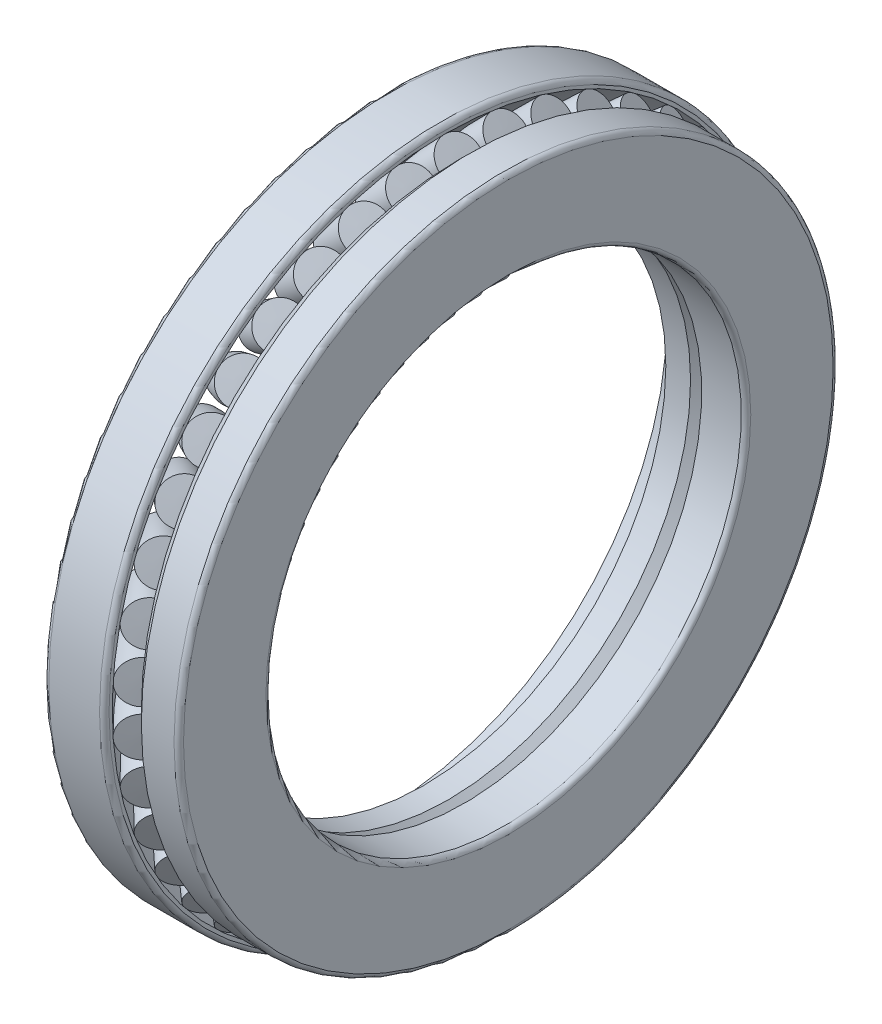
ISO-10303-21;
HEADER;
FILE_DESCRIPTION(('STEP AP214'),'2;1');
FILE_NAME('part.step','',(''),(''),'','','');
FILE_SCHEMA(('AUTOMOTIVE_DESIGN { 1 0 10303 214 1 1 1 1 }'));
ENDSEC;
DATA;
#1=APPLICATION_CONTEXT('core data for automotive mechanical design processes');
#2=APPLICATION_PROTOCOL_DEFINITION('international standard','automotive_design',2000,#1);
#3=PRODUCT_CONTEXT('',#1,'mechanical');
#4=PRODUCT('Part','Part','',(#3));
#5=PRODUCT_RELATED_PRODUCT_CATEGORY('part','',(#4));
#6=PRODUCT_DEFINITION_FORMATION('','',#4);
#7=PRODUCT_DEFINITION_CONTEXT('part definition',#1,'design');
#8=PRODUCT_DEFINITION('design','',#6,#7);
#9=PRODUCT_DEFINITION_SHAPE('','',#8);
#10=(LENGTH_UNIT() NAMED_UNIT(*) SI_UNIT(.MILLI.,.METRE.));
#11=(NAMED_UNIT(*) PLANE_ANGLE_UNIT() SI_UNIT($,.RADIAN.));
#12=(NAMED_UNIT(*) SI_UNIT($,.STERADIAN.) SOLID_ANGLE_UNIT());
#13=UNCERTAINTY_MEASURE_WITH_UNIT(LENGTH_MEASURE(1.E-05),#10,'distance_accuracy_value','');
#14=(GEOMETRIC_REPRESENTATION_CONTEXT(3) GLOBAL_UNCERTAINTY_ASSIGNED_CONTEXT((#13)) GLOBAL_UNIT_ASSIGNED_CONTEXT((#10,
#11,#12)) REPRESENTATION_CONTEXT('',''));
#15=CARTESIAN_POINT('',(0.,0.,0.));
#16=DIRECTION('',(0.,0.,1.));
#17=DIRECTION('',(1.,0.,0.));
#18=AXIS2_PLACEMENT_3D('',#15,#16,#17);
#19=CARTESIAN_POINT('',(-96.8076118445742,0.,0.));
#20=DIRECTION('',(-1.,0.,0.));
#21=DIRECTION('',(0.,0.,1.));
#22=AXIS2_PLACEMENT_3D('',#19,#20,#21);
#23=TOROIDAL_SURFACE('',#22,197.807611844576,146.38647478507);
#24=CARTESIAN_POINT('',(-7.80761184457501,0.,0.));
#25=DIRECTION('',(-1.,0.,0.));
#26=DIRECTION('',(0.,0.,1.));
#27=AXIS2_PLACEMENT_3D('',#24,#25,#26);
#28=CIRCLE('',#27,81.5836900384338);
#29=CARTESIAN_POINT('',(-7.80761184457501,0.,81.5836900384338));
#30=VERTEX_POINT('',#29);
#31=EDGE_CURVE('E11',#30,#30,#28,.T.);
#32=ORIENTED_EDGE('',*,*,#31,.F.);
#33=EDGE_LOOP('',(#32));
#34=FACE_BOUND('',#33,.T.);
#35=CARTESIAN_POINT('',(8.19238815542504,0.,0.));
#36=DIRECTION('',(-1.,0.,0.));
#37=DIRECTION('',(0.,0.,1.));
#38=AXIS2_PLACEMENT_3D('',#35,#36,#37);
#39=CIRCLE('',#38,95.8076118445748);
#40=CARTESIAN_POINT('',(8.19238815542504,0.,95.8076118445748));
#41=VERTEX_POINT('',#40);
#42=EDGE_CURVE('E89',#41,#41,#39,.T.);
#43=ORIENTED_EDGE('',*,*,#42,.T.);
#44=EDGE_LOOP('',(#43));
#45=FACE_BOUND('',#44,.T.);
#46=ADVANCED_FACE('F49',(#34,#45),#23,.F.);
#47=CARTESIAN_POINT('',(-7.80761184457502,81.5836900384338,0.));
#48=DIRECTION('',(1.,0.,0.));
#49=DIRECTION('',(0.,0.,-1.));
#50=AXIS2_PLACEMENT_3D('',#47,#48,#49);
#51=PLANE('',#50);
#52=CARTESIAN_POINT('',(-7.80761184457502,0.,0.));
#53=DIRECTION('',(-1.,0.,0.));
#54=DIRECTION('',(0.,0.,1.));
#55=AXIS2_PLACEMENT_3D('',#52,#53,#54);
#56=CIRCLE('',#55,76.5);
#57=CARTESIAN_POINT('',(-7.80761184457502,0.,76.5));
#58=VERTEX_POINT('',#57);
#59=EDGE_CURVE('E57',#58,#58,#56,.T.);
#60=ORIENTED_EDGE('',*,*,#59,.F.);
#61=EDGE_LOOP('',(#60));
#62=FACE_BOUND('',#61,.T.);
#63=ORIENTED_EDGE('',*,*,#31,.T.);
#64=EDGE_LOOP('',(#63));
#65=FACE_BOUND('',#64,.T.);
#66=ADVANCED_FACE('F151',(#62,#65),#51,.F.);
#67=CARTESIAN_POINT('',(-62.4031039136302,0.,0.));
#68=DIRECTION('',(-1.,0.,0.));
#69=DIRECTION('',(0.,0.,1.));
#70=AXIS2_PLACEMENT_3D('',#67,#68,#69);
#71=CYLINDRICAL_SURFACE('',#70,76.5);
#72=CARTESIAN_POINT('',(0.,0.,0.));
#73=DIRECTION('',(-1.,0.,0.));
#74=DIRECTION('',(0.,0.,1.));
#75=AXIS2_PLACEMENT_3D('',#72,#73,#74);
#76=CIRCLE('',#75,76.5);
#77=CARTESIAN_POINT('',(0.,0.,76.5));
#78=VERTEX_POINT('',#77);
#79=EDGE_CURVE('E58',#78,#78,#76,.T.);
#80=ORIENTED_EDGE('',*,*,#79,.F.);
#81=EDGE_LOOP('',(#80));
#82=FACE_BOUND('',#81,.T.);
#83=ORIENTED_EDGE('',*,*,#59,.T.);
#84=EDGE_LOOP('',(#83));
#85=FACE_BOUND('',#84,.T.);
#86=ADVANCED_FACE('F148',(#82,#85),#71,.F.);
#87=CARTESIAN_POINT('',(0.,0.,0.));
#88=DIRECTION('',(1.,0.,0.));
#89=DIRECTION('',(0.,0.,-1.));
#90=AXIS2_PLACEMENT_3D('',#87,#88,#89);
#91=CONICAL_SURFACE('',#90,76.5,0.793697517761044);
#92=CARTESIAN_POINT('',(2.50000000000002,0.,0.));
#93=DIRECTION('',(-1.,0.,0.));
#94=DIRECTION('',(0.,0.,1.));
#95=AXIS2_PLACEMENT_3D('',#92,#93,#94);
#96=CIRCLE('',#95,79.0418450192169);
#97=CARTESIAN_POINT('',(2.50000000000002,0.,79.0418450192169));
#98=VERTEX_POINT('',#97);
#99=EDGE_CURVE('E65',#98,#98,#96,.T.);
#100=ORIENTED_EDGE('',*,*,#99,.F.);
#101=EDGE_LOOP('',(#100));
#102=FACE_BOUND('',#101,.T.);
#103=ORIENTED_EDGE('',*,*,#79,.T.);
#104=EDGE_LOOP('',(#103));
#105=FACE_BOUND('',#104,.T.);
#106=ADVANCED_FACE('F136',(#102,#105),#91,.F.);
#107=CARTESIAN_POINT('',(2.50000000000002,0.,0.));
#108=DIRECTION('',(-1.,0.,0.));
#109=DIRECTION('',(0.,0.,1.));
#110=AXIS2_PLACEMENT_3D('',#107,#108,#109);
#111=CONICAL_SURFACE('',#110,79.0418450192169,1.01686355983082);
#112=CARTESIAN_POINT('',(4.99999999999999,0.,0.));
#113=DIRECTION('',(-1.,0.,0.));
#114=DIRECTION('',(0.,0.,1.));
#115=AXIS2_PLACEMENT_3D('',#112,#113,#114);
#116=CIRCLE('',#115,75.);
#117=CARTESIAN_POINT('',(4.99999999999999,0.,75.));
#118=VERTEX_POINT('',#117);
#119=EDGE_CURVE('E68',#118,#118,#116,.T.);
#120=ORIENTED_EDGE('',*,*,#119,.F.);
#121=EDGE_LOOP('',(#120));
#122=FACE_BOUND('',#121,.T.);
#123=ORIENTED_EDGE('',*,*,#99,.T.);
#124=EDGE_LOOP('',(#123));
#125=FACE_BOUND('',#124,.T.);
#126=ADVANCED_FACE('F133',(#122,#125),#111,.F.);
#127=CARTESIAN_POINT('',(-62.4031039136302,0.,0.));
#128=DIRECTION('',(-1.,0.,0.));
#129=DIRECTION('',(0.,0.,1.));
#130=AXIS2_PLACEMENT_3D('',#127,#128,#129);
#131=CYLINDRICAL_SURFACE('',#130,75.);
#132=CARTESIAN_POINT('',(17.5,0.,0.));
#133=DIRECTION('',(-1.,0.,0.));
#134=DIRECTION('',(0.,0.,1.));
#135=AXIS2_PLACEMENT_3D('',#132,#133,#134);
#136=CIRCLE('',#135,75.);
#137=CARTESIAN_POINT('',(17.5,0.,75.));
#138=VERTEX_POINT('',#137);
#139=EDGE_CURVE('E74',#138,#138,#136,.T.);
#140=ORIENTED_EDGE('',*,*,#139,.F.);
#141=EDGE_LOOP('',(#140));
#142=FACE_BOUND('',#141,.T.);
#143=ORIENTED_EDGE('',*,*,#119,.T.);
#144=EDGE_LOOP('',(#143));
#145=FACE_BOUND('',#144,.T.);
#146=ADVANCED_FACE('F127',(#142,#145),#131,.F.);
#147=CARTESIAN_POINT('',(17.5,0.,0.));
#148=DIRECTION('',(-1.,0.,0.));
#149=DIRECTION('',(0.,0.,1.));
#150=AXIS2_PLACEMENT_3D('',#147,#148,#149);
#151=TOROIDAL_SURFACE('',#150,76.5,1.5);
#152=CARTESIAN_POINT('',(19.,0.,0.));
#153=DIRECTION('',(-1.,0.,0.));
#154=DIRECTION('',(0.,0.,1.));
#155=AXIS2_PLACEMENT_3D('',#152,#153,#154);
#156=CIRCLE('',#155,76.5);
#157=CARTESIAN_POINT('',(19.,0.,76.5));
#158=VERTEX_POINT('',#157);
#159=EDGE_CURVE('E71',#158,#158,#156,.T.);
#160=ORIENTED_EDGE('',*,*,#159,.F.);
#161=EDGE_LOOP('',(#160));
#162=FACE_BOUND('',#161,.T.);
#163=ORIENTED_EDGE('',*,*,#139,.T.);
#164=EDGE_LOOP('',(#163));
#165=FACE_BOUND('',#164,.T.);
#166=ADVANCED_FACE('F125',(#162,#165),#151,.T.);
#167=CARTESIAN_POINT('',(19.,76.5,0.));
#168=DIRECTION('',(-1.,0.,0.));
#169=DIRECTION('',(0.,0.,1.));
#170=AXIS2_PLACEMENT_3D('',#167,#168,#169);
#171=PLANE('',#170);
#172=CARTESIAN_POINT('',(19.,0.,0.));
#173=DIRECTION('',(-1.,0.,0.));
#174=DIRECTION('',(0.,0.,1.));
#175=AXIS2_PLACEMENT_3D('',#172,#173,#174);
#176=CIRCLE('',#175,102.5);
#177=CARTESIAN_POINT('',(19.,0.,102.5));
#178=VERTEX_POINT('',#177);
#179=EDGE_CURVE('E76',#178,#178,#176,.T.);
#180=ORIENTED_EDGE('',*,*,#179,.F.);
#181=EDGE_LOOP('',(#180));
#182=FACE_BOUND('',#181,.T.);
#183=ORIENTED_EDGE('',*,*,#159,.T.);
#184=EDGE_LOOP('',(#183));
#185=FACE_BOUND('',#184,.T.);
#186=ADVANCED_FACE('F116',(#182,#185),#171,.F.);
#187=CARTESIAN_POINT('',(17.5,0.,0.));
#188=DIRECTION('',(-1.,0.,0.));
#189=DIRECTION('',(0.,0.,1.));
#190=AXIS2_PLACEMENT_3D('',#187,#188,#189);
#191=TOROIDAL_SURFACE('',#190,102.5,1.5);
#192=CARTESIAN_POINT('',(17.5,0.,0.));
#193=DIRECTION('',(-1.,0.,0.));
#194=DIRECTION('',(0.,0.,1.));
#195=AXIS2_PLACEMENT_3D('',#192,#193,#194);
#196=CIRCLE('',#195,104.);
#197=CARTESIAN_POINT('',(17.5,0.,104.));
#198=VERTEX_POINT('',#197);
#199=EDGE_CURVE('E83',#198,#198,#196,.T.);
#200=ORIENTED_EDGE('',*,*,#199,.F.);
#201=EDGE_LOOP('',(#200));
#202=FACE_BOUND('',#201,.T.);
#203=ORIENTED_EDGE('',*,*,#179,.T.);
#204=EDGE_LOOP('',(#203));
#205=FACE_BOUND('',#204,.T.);
#206=ADVANCED_FACE('F109',(#202,#205),#191,.T.);
#207=CARTESIAN_POINT('',(-62.4031039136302,0.,0.));
#208=DIRECTION('',(-1.,0.,0.));
#209=DIRECTION('',(0.,0.,1.));
#210=AXIS2_PLACEMENT_3D('',#207,#208,#209);
#211=CYLINDRICAL_SURFACE('',#210,104.);
#212=CARTESIAN_POINT('',(7.19238815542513,0.,0.));
#213=DIRECTION('',(-1.,0.,0.));
#214=DIRECTION('',(0.,0.,1.));
#215=AXIS2_PLACEMENT_3D('',#212,#213,#214);
#216=CIRCLE('',#215,104.);
#217=CARTESIAN_POINT('',(7.19238815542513,0.,104.));
#218=VERTEX_POINT('',#217);
#219=EDGE_CURVE('E85',#218,#218,#216,.T.);
#220=ORIENTED_EDGE('',*,*,#219,.F.);
#221=EDGE_LOOP('',(#220));
#222=FACE_BOUND('',#221,.T.);
#223=ORIENTED_EDGE('',*,*,#199,.T.);
#224=EDGE_LOOP('',(#223));
#225=FACE_BOUND('',#224,.T.);
#226=ADVANCED_FACE('F104',(#222,#225),#211,.T.);
#227=CARTESIAN_POINT('',(7.19238815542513,0.,0.));
#228=DIRECTION('',(1.,0.,0.));
#229=DIRECTION('',(0.,0.,-1.));
#230=AXIS2_PLACEMENT_3D('',#227,#228,#229);
#231=CONICAL_SURFACE('',#230,104.,0.785398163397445);
#232=CARTESIAN_POINT('',(3.59619407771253,0.,0.));
#233=DIRECTION('',(-1.,0.,0.));
#234=DIRECTION('',(0.,0.,1.));
#235=AXIS2_PLACEMENT_3D('',#232,#233,#234);
#236=CIRCLE('',#235,100.403805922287);
#237=CARTESIAN_POINT('',(3.59619407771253,0.,100.403805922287));
#238=VERTEX_POINT('',#237);
#239=EDGE_CURVE('E90',#238,#238,#236,.T.);
#240=ORIENTED_EDGE('',*,*,#239,.F.);
#241=EDGE_LOOP('',(#240));
#242=FACE_BOUND('',#241,.T.);
#243=ORIENTED_EDGE('',*,*,#219,.T.);
#244=EDGE_LOOP('',(#243));
#245=FACE_BOUND('',#244,.T.);
#246=ADVANCED_FACE('F96',(#242,#245),#231,.T.);
#247=CARTESIAN_POINT('',(3.59619407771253,0.,0.));
#248=DIRECTION('',(-1.,0.,0.));
#249=DIRECTION('',(0.,0.,1.));
#250=AXIS2_PLACEMENT_3D('',#247,#248,#249);
#251=CONICAL_SURFACE('',#250,100.403805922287,0.785398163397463);
#252=ORIENTED_EDGE('',*,*,#42,.F.);
#253=EDGE_LOOP('',(#252));
#254=FACE_BOUND('',#253,.T.);
#255=ORIENTED_EDGE('',*,*,#239,.T.);
#256=EDGE_LOOP('',(#255));
#257=FACE_BOUND('',#256,.T.);
#258=ADVANCED_FACE('F91',(#254,#257),#251,.F.);
#259=CLOSED_SHELL('',(#46,#66,#86,#106,#126,#146,#166,#186,#206,#226,#246,#258));
#260=MANIFOLD_SOLID_BREP('B2',#259);
#261=CARTESIAN_POINT('',(3.59619407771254,99.2823783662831,-14.9644107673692));
#262=DIRECTION('',(-0.70710678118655,-0.699208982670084,0.105388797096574));
#263=DIRECTION('',(0.707106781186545,-0.699208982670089,0.105388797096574));
#264=AXIS2_PLACEMENT_3D('',#261,#262,#263);
#265=CONICAL_SURFACE('',#264,0.,1.55640208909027);
#266=CARTESIAN_POINT('',(3.53001729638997,99.216940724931,-14.9545476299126));
#267=DIRECTION('',(-0.70710678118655,-0.699208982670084,0.105388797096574));
#268=DIRECTION('',(0.707106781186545,-0.699208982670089,0.105388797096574));
#269=AXIS2_PLACEMENT_3D('',#266,#267,#268);
#270=CIRCLE('',#269,6.50132642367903);
#271=CARTESIAN_POINT('',(8.12714929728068,94.6711548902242,-14.2693806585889));
#272=VERTEX_POINT('',#271);
#273=EDGE_CURVE('E48',#272,#272,#270,.T.);
#274=ORIENTED_EDGE('',*,*,#273,.F.);
#275=EDGE_LOOP('',(#274));
#276=FACE_BOUND('',#275,.T.);
#277=CARTESIAN_POINT('',(3.59619407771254,99.2823783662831,-14.9644107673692));
#278=VERTEX_POINT('',#277);
#279=VERTEX_LOOP('',#278);
#280=FACE_BOUND('',#279,.T.);
#281=ADVANCED_FACE('F245',(#276,#280),#265,.T.);
#282=CARTESIAN_POINT('',(2.0961940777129,97.7991321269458,-14.740847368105));
#283=DIRECTION('',(-0.70710678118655,-0.699208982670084,0.105388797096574));
#284=DIRECTION('',(0.707106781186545,-0.699208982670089,0.105388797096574));
#285=AXIS2_PLACEMENT_3D('',#282,#283,#284);
#286=DEGENERATE_TOROIDAL_SURFACE('',#285,139.871103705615,146.38647478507,.F.);
#287=CARTESIAN_POINT('',(-9.23942007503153,86.5901274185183,-13.0513617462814));
#288=DIRECTION('',(-0.70710678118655,-0.699208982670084,0.105388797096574));
#289=DIRECTION('',(0.707106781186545,-0.699208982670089,0.105388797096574));
#290=AXIS2_PLACEMENT_3D('',#287,#288,#289);
#291=CIRCLE('',#290,5.63493638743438);
#292=CARTESIAN_POINT('',(-5.25491834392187,82.6501292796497,-12.457502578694));
#293=VERTEX_POINT('',#292);
#294=EDGE_CURVE('E247',#293,#293,#291,.T.);
#295=ORIENTED_EDGE('',*,*,#294,.F.);
#296=EDGE_LOOP('',(#295));
#297=FACE_BOUND('',#296,.T.);
#298=ORIENTED_EDGE('',*,*,#273,.T.);
#299=EDGE_LOOP('',(#298));
#300=FACE_BOUND('',#299,.T.);
#301=ADVANCED_FACE('F255',(#297,#300),#286,.F.);
#302=CARTESIAN_POINT('',(-13.2239218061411,90.530125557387,-13.6452209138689));
#303=DIRECTION('',(0.70710678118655,0.699208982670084,-0.105388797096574));
#304=DIRECTION('',(-0.707106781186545,0.699208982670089,-0.105388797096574));
#305=AXIS2_PLACEMENT_3D('',#302,#303,#304);
#306=PLANE('',#305);
#307=ORIENTED_EDGE('',*,*,#294,.T.);
#308=EDGE_LOOP('',(#307));
#309=FACE_BOUND('',#308,.T.);
#310=ADVANCED_FACE('F259',(#309),#306,.F.);
#311=CLOSED_SHELL('',(#281,#301,#310));
#312=MANIFOLD_SOLID_BREP('B6',#311);
#313=CARTESIAN_POINT('',(3.59619407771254,95.9431465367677,-29.5945413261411));
#314=DIRECTION('',(-0.70710678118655,-0.675692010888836,0.208423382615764));
#315=DIRECTION('',(0.707106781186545,-0.675692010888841,0.208423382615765));
#316=AXIS2_PLACEMENT_3D('',#313,#314,#315);
#317=CONICAL_SURFACE('',#316,0.,1.55640208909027);
#318=CARTESIAN_POINT('',(3.53001729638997,95.8799098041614,-29.5750353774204));
#319=DIRECTION('',(-0.70710678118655,-0.675692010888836,0.208423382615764));
#320=DIRECTION('',(0.707106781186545,-0.675692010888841,0.208423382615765));
#321=AXIS2_PLACEMENT_3D('',#318,#319,#320);
#322=CIRCLE('',#321,6.50132642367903);
#323=CARTESIAN_POINT('',(8.12714929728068,91.487015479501,-28.220006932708));
#324=VERTEX_POINT('',#323);
#325=EDGE_CURVE('E239',#324,#324,#322,.T.);
#326=ORIENTED_EDGE('',*,*,#325,.F.);
#327=EDGE_LOOP('',(#326));
#328=FACE_BOUND('',#327,.T.);
#329=CARTESIAN_POINT('',(3.59619407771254,95.9431465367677,-29.5945413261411));
#330=VERTEX_POINT('',#329);
#331=VERTEX_LOOP('',#330);
#332=FACE_BOUND('',#331,.T.);
#333=ADVANCED_FACE('F294',(#328,#332),#317,.T.);
#334=CARTESIAN_POINT('',(2.0961940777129,94.5097873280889,-29.1524085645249));
#335=DIRECTION('',(-0.70710678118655,-0.675692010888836,0.208423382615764));
#336=DIRECTION('',(0.707106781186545,-0.675692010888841,0.208423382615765));
#337=AXIS2_PLACEMENT_3D('',#334,#335,#336);
#338=DEGENERATE_TOROIDAL_SURFACE('',#337,139.871103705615,146.38647478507,.F.);
#339=CARTESIAN_POINT('',(-9.23942007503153,83.6777827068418,-25.8111776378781));
#340=DIRECTION('',(-0.70710678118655,-0.675692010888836,0.208423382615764));
#341=DIRECTION('',(0.707106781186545,-0.675692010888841,0.208423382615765));
#342=AXIS2_PLACEMENT_3D('',#339,#340,#341);
#343=CIRCLE('',#342,5.63493638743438);
#344=CARTESIAN_POINT('',(-5.25491834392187,79.8703012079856,-24.6367251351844));
#345=VERTEX_POINT('',#344);
#346=EDGE_CURVE('E301',#345,#345,#343,.T.);
#347=ORIENTED_EDGE('',*,*,#346,.F.);
#348=EDGE_LOOP('',(#347));
#349=FACE_BOUND('',#348,.T.);
#350=ORIENTED_EDGE('',*,*,#325,.T.);
#351=EDGE_LOOP('',(#350));
#352=FACE_BOUND('',#351,.T.);
#353=ADVANCED_FACE('F304',(#349,#352),#338,.F.);
#354=CARTESIAN_POINT('',(-13.2239218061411,87.4852642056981,-26.9856301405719));
#355=DIRECTION('',(0.70710678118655,0.675692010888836,-0.208423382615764));
#356=DIRECTION('',(-0.707106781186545,0.675692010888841,-0.208423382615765));
#357=AXIS2_PLACEMENT_3D('',#354,#355,#356);
#358=PLANE('',#357);
#359=ORIENTED_EDGE('',*,*,#346,.T.);
#360=EDGE_LOOP('',(#359));
#361=FACE_BOUND('',#360,.T.);
#362=ADVANCED_FACE('F309',(#361),#358,.F.);
#363=CLOSED_SHELL('',(#333,#353,#362));
#364=MANIFOLD_SOLID_BREP('B45',#363);
#365=CARTESIAN_POINT('',(3.59619407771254,90.4607033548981,-43.5635787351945));
#366=DIRECTION('',(-0.70710678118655,-0.637081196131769,0.306802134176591));
#367=DIRECTION('',(0.707106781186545,-0.637081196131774,0.306802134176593));
#368=AXIS2_PLACEMENT_3D('',#365,#366,#367);
#369=CONICAL_SURFACE('',#368,0.,1.55640208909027);
#370=CARTESIAN_POINT('',(3.53001729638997,90.4010801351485,-43.5348657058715));
#371=DIRECTION('',(-0.70710678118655,-0.637081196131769,0.306802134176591));
#372=DIRECTION('',(0.707106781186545,-0.637081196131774,0.306802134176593));
#373=AXIS2_PLACEMENT_3D('',#370,#371,#372);
#374=CIRCLE('',#373,6.50132642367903);
#375=CARTESIAN_POINT('',(8.12714929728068,86.2592073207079,-41.5402448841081));
#376=VERTEX_POINT('',#375);
#377=EDGE_CURVE('E291',#376,#376,#374,.T.);
#378=ORIENTED_EDGE('',*,*,#377,.F.);
#379=EDGE_LOOP('',(#378));
#380=FACE_BOUND('',#379,.T.);
#381=CARTESIAN_POINT('',(3.59619407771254,90.4607033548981,-43.5635787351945));
#382=VERTEX_POINT('',#381);
#383=VERTEX_LOOP('',#382);
#384=FACE_BOUND('',#383,.T.);
#385=ADVANCED_FACE('F347',(#380,#384),#369,.T.);
#386=CARTESIAN_POINT('',(2.0961940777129,89.1092500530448,-42.9127531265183));
#387=DIRECTION('',(-0.70710678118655,-0.637081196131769,0.306802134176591));
#388=DIRECTION('',(0.707106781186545,-0.637081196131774,0.306802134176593));
#389=AXIS2_PLACEMENT_3D('',#386,#387,#388);
#390=DEGENERATE_TOROIDAL_SURFACE('',#389,139.871103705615,146.38647478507,.F.);
#391=CARTESIAN_POINT('',(-9.23942007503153,78.896214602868,-37.9944144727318));
#392=DIRECTION('',(-0.70710678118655,-0.637081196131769,0.306802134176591));
#393=DIRECTION('',(0.707106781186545,-0.637081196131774,0.306802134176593));
#394=AXIS2_PLACEMENT_3D('',#391,#392,#393);
#395=CIRCLE('',#394,5.63493638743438);
#396=CARTESIAN_POINT('',(-5.25491834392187,75.3063025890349,-36.2656039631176));
#397=VERTEX_POINT('',#396);
#398=EDGE_CURVE('E355',#397,#397,#395,.T.);
#399=ORIENTED_EDGE('',*,*,#398,.F.);
#400=EDGE_LOOP('',(#399));
#401=FACE_BOUND('',#400,.T.);
#402=ORIENTED_EDGE('',*,*,#377,.T.);
#403=EDGE_LOOP('',(#402));
#404=FACE_BOUND('',#403,.T.);
#405=ADVANCED_FACE('F356',(#401,#404),#390,.F.);
#406=CARTESIAN_POINT('',(-13.2239218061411,82.4861266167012,-39.7232249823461));
#407=DIRECTION('',(0.70710678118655,0.637081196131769,-0.306802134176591));
#408=DIRECTION('',(-0.707106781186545,0.637081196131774,-0.306802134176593));
#409=AXIS2_PLACEMENT_3D('',#406,#407,#408);
#410=PLANE('',#409);
#411=ORIENTED_EDGE('',*,*,#398,.T.);
#412=EDGE_LOOP('',(#411));
#413=FACE_BOUND('',#412,.T.);
#414=ADVANCED_FACE('F361',(#413),#410,.F.);
#415=CLOSED_SHELL('',(#385,#405,#414));
#416=MANIFOLD_SOLID_BREP('B234',#415);
#417=CARTESIAN_POINT('',(3.59619407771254,82.9575175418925,-56.5594777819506));
#418=DIRECTION('',(-0.70710678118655,-0.584239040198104,0.398327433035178));
#419=DIRECTION('',(0.707106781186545,-0.584239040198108,0.398327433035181));
#420=AXIS2_PLACEMENT_3D('',#417,#418,#419);
#421=CONICAL_SURFACE('',#420,0.,1.55640208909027);
#422=CARTESIAN_POINT('',(3.53001729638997,82.9028397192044,-56.5221990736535));
#423=DIRECTION('',(-0.70710678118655,-0.584239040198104,0.398327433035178));
#424=DIRECTION('',(0.707106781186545,-0.584239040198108,0.398327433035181));
#425=AXIS2_PLACEMENT_3D('',#422,#423,#424);
#426=CIRCLE('',#425,6.50132642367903);
#427=CARTESIAN_POINT('',(8.12714929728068,79.1045110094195,-53.9325424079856));
#428=VERTEX_POINT('',#427);
#429=EDGE_CURVE('E346',#428,#428,#426,.T.);
#430=ORIENTED_EDGE('',*,*,#429,.F.);
#431=EDGE_LOOP('',(#430));
#432=FACE_BOUND('',#431,.T.);
#433=CARTESIAN_POINT('',(3.59619407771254,82.9575175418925,-56.5594777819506));
#434=VERTEX_POINT('',#433);
#435=VERTEX_LOOP('',#434);
#436=FACE_BOUND('',#435,.T.);
#437=ADVANCED_FACE('F402',(#432,#436),#421,.T.);
#438=CARTESIAN_POINT('',(2.0961940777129,81.7181593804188,-55.7144976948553));
#439=DIRECTION('',(-0.70710678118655,-0.584239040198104,0.398327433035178));
#440=DIRECTION('',(0.707106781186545,-0.584239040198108,0.398327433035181));
#441=AXIS2_PLACEMENT_3D('',#438,#439,#440);
#442=DEGENERATE_TOROIDAL_SURFACE('',#441,139.871103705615,146.38647478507,.F.);
#443=CARTESIAN_POINT('',(-9.23942007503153,72.3522354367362,-49.3289188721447));
#444=DIRECTION('',(-0.70710678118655,-0.584239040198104,0.398327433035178));
#445=DIRECTION('',(0.707106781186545,-0.584239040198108,0.398327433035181));
#446=AXIS2_PLACEMENT_3D('',#443,#444,#445);
#447=CIRCLE('',#446,5.63493638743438);
#448=CARTESIAN_POINT('',(-5.25491834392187,69.0600856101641,-47.0843691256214));
#449=VERTEX_POINT('',#448);
#450=EDGE_CURVE('E409',#449,#449,#447,.T.);
#451=ORIENTED_EDGE('',*,*,#450,.F.);
#452=EDGE_LOOP('',(#451));
#453=FACE_BOUND('',#452,.T.);
#454=ORIENTED_EDGE('',*,*,#429,.T.);
#455=EDGE_LOOP('',(#454));
#456=FACE_BOUND('',#455,.T.);
#457=ADVANCED_FACE('F411',(#453,#456),#442,.F.);
#458=CARTESIAN_POINT('',(-13.2239218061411,75.6443852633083,-51.573468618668));
#459=DIRECTION('',(0.70710678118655,0.584239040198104,-0.398327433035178));
#460=DIRECTION('',(-0.707106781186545,0.584239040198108,-0.398327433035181));
#461=AXIS2_PLACEMENT_3D('',#458,#459,#460);
#462=PLANE('',#461);
#463=ORIENTED_EDGE('',*,*,#450,.T.);
#464=EDGE_LOOP('',(#463));
#465=FACE_BOUND('',#464,.T.);
#466=ADVANCED_FACE('F418',(#465),#462,.F.);
#467=CLOSED_SHELL('',(#437,#457,#466));
#468=MANIFOLD_SOLID_BREP('B289',#467);
#469=CARTESIAN_POINT('',(3.59619407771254,73.6011978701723,-68.2919315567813));
#470=DIRECTION('',(-0.70710678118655,-0.518345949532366,0.480954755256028));
#471=DIRECTION('',(0.707106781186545,-0.51834594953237,0.480954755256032));
#472=AXIS2_PLACEMENT_3D('',#469,#470,#471);
#473=CONICAL_SURFACE('',#472,0.,1.55640208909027);
#474=CARTESIAN_POINT('',(3.53001729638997,73.5526868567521,-68.2469199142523));
#475=DIRECTION('',(-0.70710678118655,-0.518345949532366,0.480954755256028));
#476=DIRECTION('',(0.707106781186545,-0.51834594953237,0.480954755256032));
#477=AXIS2_PLACEMENT_3D('',#474,#475,#476);
#478=CIRCLE('',#477,6.50132642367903);
#479=CARTESIAN_POINT('',(8.12714929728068,70.1827506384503,-65.1200760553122));
#480=VERTEX_POINT('',#479);
#481=EDGE_CURVE('E400',#480,#480,#478,.T.);
#482=ORIENTED_EDGE('',*,*,#481,.F.);
#483=EDGE_LOOP('',(#482));
#484=FACE_BOUND('',#483,.T.);
#485=CARTESIAN_POINT('',(3.59619407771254,73.6011978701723,-68.2919315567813));
#486=VERTEX_POINT('',#485);
#487=VERTEX_LOOP('',#486);
#488=FACE_BOUND('',#487,.T.);
#489=ADVANCED_FACE('F455',(#484,#488),#473,.T.);
#490=CARTESIAN_POINT('',(2.0961940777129,72.5016200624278,-67.2716724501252));
#491=DIRECTION('',(-0.70710678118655,-0.518345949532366,0.480954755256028));
#492=DIRECTION('',(0.707106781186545,-0.51834594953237,0.480954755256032));
#493=AXIS2_PLACEMENT_3D('',#490,#491,#492);
#494=DEGENERATE_TOROIDAL_SURFACE('',#493,139.871103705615,146.38647478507,.F.);
#495=CARTESIAN_POINT('',(-9.23942007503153,64.1920268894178,-59.5614967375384));
#496=DIRECTION('',(-0.70710678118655,-0.518345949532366,0.480954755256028));
#497=DIRECTION('',(0.707106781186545,-0.51834594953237,0.480954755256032));
#498=AXIS2_PLACEMENT_3D('',#495,#496,#497);
#499=CIRCLE('',#498,5.63493638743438);
#500=CARTESIAN_POINT('',(-5.25491834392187,61.2711804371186,-56.8513472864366));
#501=VERTEX_POINT('',#500);
#502=EDGE_CURVE('E459',#501,#501,#499,.T.);
#503=ORIENTED_EDGE('',*,*,#502,.F.);
#504=EDGE_LOOP('',(#503));
#505=FACE_BOUND('',#504,.T.);
#506=ORIENTED_EDGE('',*,*,#481,.T.);
#507=EDGE_LOOP('',(#506));
#508=FACE_BOUND('',#507,.T.);
#509=ADVANCED_FACE('F465',(#505,#508),#494,.F.);
#510=CARTESIAN_POINT('',(-13.2239218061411,67.112873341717,-62.2716461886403));
#511=DIRECTION('',(0.70710678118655,0.518345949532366,-0.480954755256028));
#512=DIRECTION('',(-0.707106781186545,0.51834594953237,-0.480954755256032));
#513=AXIS2_PLACEMENT_3D('',#510,#511,#512);
#514=PLANE('',#513);
#515=ORIENTED_EDGE('',*,*,#502,.T.);
#516=EDGE_LOOP('',(#515));
#517=FACE_BOUND('',#516,.T.);
#518=ADVANCED_FACE('F469',(#517),#514,.F.);
#519=CLOSED_SHELL('',(#489,#509,#518));
#520=MANIFOLD_SOLID_BREP('B338',#519);
#521=CARTESIAN_POINT('',(3.59619407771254,62.6007490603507,-78.4988564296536));
#522=DIRECTION('',(-0.70710678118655,-0.440873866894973,0.552838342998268));
#523=DIRECTION('',(0.707106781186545,-0.440873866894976,0.552838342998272));
#524=AXIS2_PLACEMENT_3D('',#521,#522,#523);
#525=CONICAL_SURFACE('',#524,0.,1.55640208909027);
#526=CARTESIAN_POINT('',(3.53001729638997,62.5594885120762,-78.4471173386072));
#527=DIRECTION('',(-0.70710678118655,-0.440873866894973,0.552838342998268));
#528=DIRECTION('',(0.707106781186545,-0.440873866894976,0.552838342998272));
#529=AXIS2_PLACEMENT_3D('',#526,#527,#528);
#530=CIRCLE('',#529,6.50132642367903);
#531=CARTESIAN_POINT('',(8.12714929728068,59.6932235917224,-74.8529348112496));
#532=VERTEX_POINT('',#531);
#533=EDGE_CURVE('E454',#532,#532,#530,.T.);
#534=ORIENTED_EDGE('',*,*,#533,.F.);
#535=EDGE_LOOP('',(#534));
#536=FACE_BOUND('',#535,.T.);
#537=CARTESIAN_POINT('',(3.59619407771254,62.6007490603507,-78.4988564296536));
#538=VERTEX_POINT('',#537);
#539=VERTEX_LOOP('',#538);
#540=FACE_BOUND('',#539,.T.);
#541=ADVANCED_FACE('F510',(#536,#540),#525,.T.);
#542=CARTESIAN_POINT('',(2.0961940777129,61.6655143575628,-77.3261092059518));
#543=DIRECTION('',(-0.70710678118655,-0.440873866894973,0.552838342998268));
#544=DIRECTION('',(0.707106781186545,-0.440873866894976,0.552838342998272));
#545=AXIS2_PLACEMENT_3D('',#542,#543,#544);
#546=DEGENERATE_TOROIDAL_SURFACE('',#545,139.871103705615,146.38647478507,.F.);
#547=CARTESIAN_POINT('',(-9.23942007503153,54.5978745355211,-68.4635691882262));
#548=DIRECTION('',(-0.70710678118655,-0.440873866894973,0.552838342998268));
#549=DIRECTION('',(0.707106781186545,-0.440873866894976,0.552838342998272));
#550=AXIS2_PLACEMENT_3D('',#547,#548,#549);
#551=CIRCLE('',#550,5.63493638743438);
#552=CARTESIAN_POINT('',(-5.25491834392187,52.1135783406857,-65.3483602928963));
#553=VERTEX_POINT('',#552);
#554=EDGE_CURVE('E514',#553,#553,#551,.T.);
#555=ORIENTED_EDGE('',*,*,#554,.F.);
#556=EDGE_LOOP('',(#555));
#557=FACE_BOUND('',#556,.T.);
#558=ORIENTED_EDGE('',*,*,#533,.T.);
#559=EDGE_LOOP('',(#558));
#560=FACE_BOUND('',#559,.T.);
#561=ADVANCED_FACE('F519',(#557,#560),#546,.F.);
#562=CARTESIAN_POINT('',(-13.2239218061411,57.0821707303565,-71.5787780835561));
#563=DIRECTION('',(0.70710678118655,0.440873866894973,-0.552838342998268));
#564=DIRECTION('',(-0.707106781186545,0.440873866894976,-0.552838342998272));
#565=AXIS2_PLACEMENT_3D('',#562,#563,#564);
#566=PLANE('',#565);
#567=ORIENTED_EDGE('',*,*,#554,.T.);
#568=EDGE_LOOP('',(#567));
#569=FACE_BOUND('',#568,.T.);
#570=ADVANCED_FACE('F525',(#569),#566,.F.);
#571=CLOSED_SHELL('',(#541,#561,#570));
#572=MANIFOLD_SOLID_BREP('B392',#571);
#573=CARTESIAN_POINT('',(3.59619407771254,50.2019029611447,-86.9522465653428));
#574=DIRECTION('',(-0.70710678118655,-0.35355339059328,0.612372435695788));
#575=DIRECTION('',(0.707106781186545,-0.353553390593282,0.612372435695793));
#576=AXIS2_PLACEMENT_3D('',#573,#574,#575);
#577=CONICAL_SURFACE('',#576,0.,1.55640208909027);
#578=CARTESIAN_POINT('',(3.53001729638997,50.1688145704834,-86.8949357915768));
#579=DIRECTION('',(-0.70710678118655,-0.35355339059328,0.612372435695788));
#580=DIRECTION('',(0.707106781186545,-0.353553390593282,0.612372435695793));
#581=AXIS2_PLACEMENT_3D('',#578,#579,#580);
#582=CIRCLE('',#581,6.50132642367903);
#583=CARTESIAN_POINT('',(8.12714929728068,47.870248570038,-82.913702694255));
#584=VERTEX_POINT('',#583);
#585=EDGE_CURVE('E504',#584,#584,#582,.T.);
#586=ORIENTED_EDGE('',*,*,#585,.F.);
#587=EDGE_LOOP('',(#586));
#588=FACE_BOUND('',#587,.T.);
#589=CARTESIAN_POINT('',(3.59619407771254,50.2019029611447,-86.9522465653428));
#590=VERTEX_POINT('',#589);
#591=VERTEX_LOOP('',#590);
#592=FACE_BOUND('',#591,.T.);
#593=ADVANCED_FACE('F557',(#588,#592),#577,.T.);
#594=CARTESIAN_POINT('',(2.0961940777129,49.4519029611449,-85.6532084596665));
#595=DIRECTION('',(-0.70710678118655,-0.35355339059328,0.612372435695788));
#596=DIRECTION('',(0.707106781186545,-0.353553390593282,0.612372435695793));
#597=AXIS2_PLACEMENT_3D('',#594,#595,#596);
#598=DEGENERATE_TOROIDAL_SURFACE('',#597,139.871103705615,146.38647478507,.F.);
#599=CARTESIAN_POINT('',(-9.23942007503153,43.7840958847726,-75.8362786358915));
#600=DIRECTION('',(-0.70710678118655,-0.35355339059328,0.612372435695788));
#601=DIRECTION('',(0.707106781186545,-0.353553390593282,0.612372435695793));
#602=AXIS2_PLACEMENT_3D('',#599,#600,#601);
#603=CIRCLE('',#602,5.63493638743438);
#604=CARTESIAN_POINT('',(-5.25491834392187,41.7918450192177,-72.3855989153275));
#605=VERTEX_POINT('',#604);
#606=EDGE_CURVE('E566',#605,#605,#603,.T.);
#607=ORIENTED_EDGE('',*,*,#606,.F.);
#608=EDGE_LOOP('',(#607));
#609=FACE_BOUND('',#608,.T.);
#610=ORIENTED_EDGE('',*,*,#585,.T.);
#611=EDGE_LOOP('',(#610));
#612=FACE_BOUND('',#611,.T.);
#613=ADVANCED_FACE('F569',(#609,#612),#598,.F.);
#614=CARTESIAN_POINT('',(-13.2239218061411,45.7763467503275,-79.2869583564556));
#615=DIRECTION('',(0.70710678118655,0.35355339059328,-0.612372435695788));
#616=DIRECTION('',(-0.707106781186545,0.353553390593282,-0.612372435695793));
#617=AXIS2_PLACEMENT_3D('',#614,#615,#616);
#618=PLANE('',#617);
#619=ORIENTED_EDGE('',*,*,#606,.T.);
#620=EDGE_LOOP('',(#619));
#621=FACE_BOUND('',#620,.T.);
#622=ADVANCED_FACE('F574',(#621),#618,.F.);
#623=CLOSED_SHELL('',(#593,#613,#622));
#624=MANIFOLD_SOLID_BREP('B447',#623);
#625=CARTESIAN_POINT('',(3.59619407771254,36.6816293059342,-93.4632671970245));
#626=DIRECTION('',(-0.70710678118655,-0.258335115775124,0.658227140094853));
#627=DIRECTION('',(0.707106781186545,-0.258335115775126,0.658227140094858));
#628=AXIS2_PLACEMENT_3D('',#625,#626,#627);
#629=CONICAL_SURFACE('',#628,0.,1.55640208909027);
#630=CARTESIAN_POINT('',(3.53001729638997,36.6574522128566,-93.4016649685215));
#631=DIRECTION('',(-0.70710678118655,-0.258335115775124,0.658227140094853));
#632=DIRECTION('',(0.707106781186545,-0.258335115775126,0.658227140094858));
#633=AXIS2_PLACEMENT_3D('',#630,#631,#632);
#634=CIRCLE('',#633,6.50132642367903);
#635=CARTESIAN_POINT('',(8.12714929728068,34.9779312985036,-89.1223154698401));
#636=VERTEX_POINT('',#635);
#637=EDGE_CURVE('E556',#636,#636,#634,.T.);
#638=ORIENTED_EDGE('',*,*,#637,.F.);
#639=EDGE_LOOP('',(#638));
#640=FACE_BOUND('',#639,.T.);
#641=CARTESIAN_POINT('',(3.59619407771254,36.6816293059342,-93.4632671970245));
#642=VERTEX_POINT('',#641);
#643=VERTEX_LOOP('',#642);
#644=FACE_BOUND('',#643,.T.);
#645=ADVANCED_FACE('F612',(#640,#644),#629,.T.);
#646=CARTESIAN_POINT('',(2.0961940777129,36.1336177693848,-92.0669565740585));
#647=DIRECTION('',(-0.70710678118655,-0.258335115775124,0.658227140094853));
#648=DIRECTION('',(0.707106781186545,-0.258335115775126,0.658227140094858));
#649=AXIS2_PLACEMENT_3D('',#646,#647,#648);
#650=DEGENERATE_TOROIDAL_SURFACE('',#649,139.871103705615,146.38647478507,.F.);
#651=CARTESIAN_POINT('',(-9.23942007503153,31.9922528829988,-81.5149309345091));
#652=DIRECTION('',(-0.70710678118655,-0.258335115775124,0.658227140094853));
#653=DIRECTION('',(0.707106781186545,-0.258335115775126,0.658227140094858));
#654=AXIS2_PLACEMENT_3D('',#651,#652,#653);
#655=CIRCLE('',#654,5.63493638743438);
#656=CARTESIAN_POINT('',(-5.25491834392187,30.5365509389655,-77.8058628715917));
#657=VERTEX_POINT('',#656);
#658=EDGE_CURVE('E620',#657,#657,#655,.T.);
#659=ORIENTED_EDGE('',*,*,#658,.F.);
#660=EDGE_LOOP('',(#659));
#661=FACE_BOUND('',#660,.T.);
#662=ORIENTED_EDGE('',*,*,#637,.T.);
#663=EDGE_LOOP('',(#662));
#664=FACE_BOUND('',#663,.T.);
#665=ADVANCED_FACE('F621',(#661,#664),#650,.F.);
#666=CARTESIAN_POINT('',(-13.2239218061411,33.4479548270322,-85.2239989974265));
#667=DIRECTION('',(0.70710678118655,0.258335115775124,-0.658227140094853));
#668=DIRECTION('',(-0.707106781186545,0.258335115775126,-0.658227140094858));
#669=AXIS2_PLACEMENT_3D('',#666,#667,#668);
#670=PLANE('',#669);
#671=ORIENTED_EDGE('',*,*,#658,.T.);
#672=EDGE_LOOP('',(#671));
#673=FACE_BOUND('',#672,.T.);
#674=ADVANCED_FACE('F628',(#673),#670,.F.);
#675=CLOSED_SHELL('',(#645,#665,#674));
#676=MANIFOLD_SOLID_BREP('B497',#675);
#677=CARTESIAN_POINT('',(3.59619407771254,22.341948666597,-97.8864728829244));
#678=DIRECTION('',(-0.70710678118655,-0.157346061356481,0.689378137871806));
#679=DIRECTION('',(0.707106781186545,-0.157346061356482,0.689378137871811));
#680=AXIS2_PLACEMENT_3D('',#677,#678,#679);
#681=CONICAL_SURFACE('',#680,0.,1.55640208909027);
#682=CARTESIAN_POINT('',(3.53001729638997,22.3272229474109,-97.8219552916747));
#683=DIRECTION('',(-0.70710678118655,-0.157346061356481,0.689378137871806));
#684=DIRECTION('',(0.707106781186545,-0.157346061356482,0.689378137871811));
#685=AXIS2_PLACEMENT_3D('',#682,#683,#684);
#686=CIRCLE('',#685,6.50132642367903);
#687=CARTESIAN_POINT('',(8.12714929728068,21.3042648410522,-93.3400829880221));
#688=VERTEX_POINT('',#687);
#689=EDGE_CURVE('E613',#688,#688,#686,.T.);
#690=ORIENTED_EDGE('',*,*,#689,.F.);
#691=EDGE_LOOP('',(#690));
#692=FACE_BOUND('',#691,.T.);
#693=CARTESIAN_POINT('',(3.59619407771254,22.341948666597,-97.8864728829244));
#694=VERTEX_POINT('',#693);
#695=VERTEX_LOOP('',#694);
#696=FACE_BOUND('',#695,.T.);
#697=ADVANCED_FACE('F668',(#692,#696),#681,.T.);
#698=CARTESIAN_POINT('',(2.0961940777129,22.0081672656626,-96.4240810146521));
#699=DIRECTION('',(-0.70710678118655,-0.157346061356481,0.689378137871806));
#700=DIRECTION('',(0.707106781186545,-0.157346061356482,0.689378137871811));
#701=AXIS2_PLACEMENT_3D('',#698,#699,#700);
#702=DEGENERATE_TOROIDAL_SURFACE('',#701,139.871103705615,146.38647478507,.F.);
#703=CARTESIAN_POINT('',(-9.23942007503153,19.4857558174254,-85.3726743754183));
#704=DIRECTION('',(-0.70710678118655,-0.157346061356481,0.689378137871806));
#705=DIRECTION('',(0.707106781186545,-0.157346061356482,0.689378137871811));
#706=AXIS2_PLACEMENT_3D('',#703,#704,#705);
#707=CIRCLE('',#706,5.63493638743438);
#708=CARTESIAN_POINT('',(-5.25491834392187,18.5991207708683,-81.4880724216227));
#709=VERTEX_POINT('',#708);
#710=EDGE_CURVE('E675',#709,#709,#707,.T.);
#711=ORIENTED_EDGE('',*,*,#710,.F.);
#712=EDGE_LOOP('',(#711));
#713=FACE_BOUND('',#712,.T.);
#714=ORIENTED_EDGE('',*,*,#689,.T.);
#715=EDGE_LOOP('',(#714));
#716=FACE_BOUND('',#715,.T.);
#717=ADVANCED_FACE('F678',(#713,#716),#702,.F.);
#718=CARTESIAN_POINT('',(-13.2239218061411,20.3723908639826,-89.257276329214));
#719=DIRECTION('',(0.70710678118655,0.157346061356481,-0.689378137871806));
#720=DIRECTION('',(-0.707106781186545,0.157346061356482,-0.689378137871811));
#721=AXIS2_PLACEMENT_3D('',#718,#719,#720);
#722=PLANE('',#721);
#723=ORIENTED_EDGE('',*,*,#710,.T.);
#724=EDGE_LOOP('',(#723));
#725=FACE_BOUND('',#724,.T.);
#726=ADVANCED_FACE('F683',(#725),#722,.F.);
#727=CLOSED_SHELL('',(#697,#717,#726));
#728=MANIFOLD_SOLID_BREP('B552',#727);
#729=CARTESIAN_POINT('',(3.59619407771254,7.5031858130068,-100.123056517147));
#730=DIRECTION('',(-0.70710678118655,-0.0528421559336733,0.705129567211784));
#731=DIRECTION('',(0.707106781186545,-0.0528421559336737,0.705129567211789));
#732=AXIS2_PLACEMENT_3D('',#729,#730,#731);
#733=CONICAL_SURFACE('',#732,0.,1.55640208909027);
#734=CARTESIAN_POINT('',(3.53001729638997,7.49824041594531,-100.057064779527));
#735=DIRECTION('',(-0.70710678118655,-0.0528421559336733,0.705129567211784));
#736=DIRECTION('',(0.707106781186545,-0.0528421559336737,0.705129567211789));
#737=AXIS2_PLACEMENT_3D('',#734,#735,#736);
#738=CIRCLE('',#737,6.50132642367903);
#739=CARTESIAN_POINT('',(8.12714929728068,7.15469631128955,-95.4727872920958));
#740=VERTEX_POINT('',#739);
#741=EDGE_CURVE('E664',#740,#740,#738,.T.);
#742=ORIENTED_EDGE('',*,*,#741,.F.);
#743=EDGE_LOOP('',(#742));
#744=FACE_BOUND('',#743,.T.);
#745=CARTESIAN_POINT('',(3.59619407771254,7.5031858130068,-100.123056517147));
#746=VERTEX_POINT('',#745);
#747=VERTEX_LOOP('',#746);
#748=FACE_BOUND('',#747,.T.);
#749=ADVANCED_FACE('F718',(#744,#748),#733,.T.);
#750=CARTESIAN_POINT('',(2.0961940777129,7.39109067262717,-98.6272508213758));
#751=DIRECTION('',(-0.70710678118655,-0.0528421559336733,0.705129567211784));
#752=DIRECTION('',(0.707106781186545,-0.0528421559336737,0.705129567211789));
#753=AXIS2_PLACEMENT_3D('',#750,#751,#752);
#754=DEGENERATE_TOROIDAL_SURFACE('',#753,139.871103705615,146.38647478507,.F.);
#755=CARTESIAN_POINT('',(-9.23942007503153,6.54397916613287,-87.3233333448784));
#756=DIRECTION('',(-0.70710678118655,-0.0528421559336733,0.705129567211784));
#757=DIRECTION('',(0.707106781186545,-0.0528421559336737,0.705129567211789));
#758=AXIS2_PLACEMENT_3D('',#755,#756,#757);
#759=CIRCLE('',#758,5.63493638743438);
#760=CARTESIAN_POINT('',(-5.25491834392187,6.24621697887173,-83.3499730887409));
#761=VERTEX_POINT('',#760);
#762=EDGE_CURVE('E721',#761,#761,#759,.T.);
#763=ORIENTED_EDGE('',*,*,#762,.F.);
#764=EDGE_LOOP('',(#763));
#765=FACE_BOUND('',#764,.T.);
#766=ORIENTED_EDGE('',*,*,#741,.T.);
#767=EDGE_LOOP('',(#766));
#768=FACE_BOUND('',#767,.T.);
#769=ADVANCED_FACE('F729',(#765,#768),#754,.F.);
#770=CARTESIAN_POINT('',(-13.2239218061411,6.84174135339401,-91.2966936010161));
#771=DIRECTION('',(0.70710678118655,0.0528421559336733,-0.705129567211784));
#772=DIRECTION('',(-0.707106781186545,0.0528421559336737,-0.705129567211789));
#773=AXIS2_PLACEMENT_3D('',#770,#771,#772);
#774=PLANE('',#773);
#775=ORIENTED_EDGE('',*,*,#762,.T.);
#776=EDGE_LOOP('',(#775));
#777=FACE_BOUND('',#776,.T.);
#778=ADVANCED_FACE('F735',(#777),#774,.F.);
#779=CLOSED_SHELL('',(#749,#769,#778));
#780=MANIFOLD_SOLID_BREP('B601',#779);
#781=CARTESIAN_POINT('',(3.59619407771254,-7.5031858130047,-100.123056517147));
#782=DIRECTION('',(-0.70710678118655,0.0528421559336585,0.705129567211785));
#783=DIRECTION('',(0.707106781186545,0.0528421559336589,0.70512956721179));
#784=AXIS2_PLACEMENT_3D('',#781,#782,#783);
#785=CONICAL_SURFACE('',#784,0.,1.55640208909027);
#786=CARTESIAN_POINT('',(3.53001729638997,-7.49824041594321,-100.057064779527));
#787=DIRECTION('',(-0.70710678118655,0.0528421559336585,0.705129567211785));
#788=DIRECTION('',(0.707106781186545,0.0528421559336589,0.70512956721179));
#789=AXIS2_PLACEMENT_3D('',#786,#787,#788);
#790=CIRCLE('',#789,6.50132642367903);
#791=CARTESIAN_POINT('',(8.12714929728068,-7.15469631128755,-95.4727872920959));
#792=VERTEX_POINT('',#791);
#793=EDGE_CURVE('E720',#792,#792,#790,.T.);
#794=ORIENTED_EDGE('',*,*,#793,.F.);
#795=EDGE_LOOP('',(#794));
#796=FACE_BOUND('',#795,.T.);
#797=CARTESIAN_POINT('',(3.59619407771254,-7.5031858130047,-100.123056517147));
#798=VERTEX_POINT('',#797);
#799=VERTEX_LOOP('',#798);
#800=FACE_BOUND('',#799,.T.);
#801=ADVANCED_FACE('F775',(#796,#800),#785,.T.);
#802=CARTESIAN_POINT('',(2.0961940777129,-7.3910906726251,-98.627250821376));
#803=DIRECTION('',(-0.70710678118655,0.0528421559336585,0.705129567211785));
#804=DIRECTION('',(0.707106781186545,0.0528421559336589,0.70512956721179));
#805=AXIS2_PLACEMENT_3D('',#802,#803,#804);
#806=DEGENERATE_TOROIDAL_SURFACE('',#805,139.871103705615,146.38647478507,.F.);
#807=CARTESIAN_POINT('',(-9.23942007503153,-6.54397916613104,-87.3233333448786));
#808=DIRECTION('',(-0.70710678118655,0.0528421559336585,0.705129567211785));
#809=DIRECTION('',(0.707106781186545,0.0528421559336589,0.70512956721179));
#810=AXIS2_PLACEMENT_3D('',#807,#808,#809);
#811=CIRCLE('',#810,5.63493638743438);
#812=CARTESIAN_POINT('',(-5.25491834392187,-6.24621697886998,-83.349973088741));
#813=VERTEX_POINT('',#812);
#814=EDGE_CURVE('E777',#813,#813,#811,.T.);
#815=ORIENTED_EDGE('',*,*,#814,.F.);
#816=EDGE_LOOP('',(#815));
#817=FACE_BOUND('',#816,.T.);
#818=ORIENTED_EDGE('',*,*,#793,.T.);
#819=EDGE_LOOP('',(#818));
#820=FACE_BOUND('',#819,.T.);
#821=ADVANCED_FACE('F785',(#817,#820),#806,.F.);
#822=CARTESIAN_POINT('',(-13.2239218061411,-6.8417413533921,-91.2966936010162));
#823=DIRECTION('',(0.70710678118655,-0.0528421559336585,-0.705129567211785));
#824=DIRECTION('',(-0.707106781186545,-0.0528421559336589,-0.70512956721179));
#825=AXIS2_PLACEMENT_3D('',#822,#823,#824);
#826=PLANE('',#825);
#827=ORIENTED_EDGE('',*,*,#814,.T.);
#828=EDGE_LOOP('',(#827));
#829=FACE_BOUND('',#828,.T.);
#830=ADVANCED_FACE('F789',(#829),#826,.F.);
#831=CLOSED_SHELL('',(#801,#821,#830));
#832=MANIFOLD_SOLID_BREP('B657',#831);
#833=CARTESIAN_POINT('',(3.59619407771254,-22.3419486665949,-97.8864728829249));
#834=DIRECTION('',(-0.70710678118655,0.157346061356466,0.68937813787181));
#835=DIRECTION('',(0.707106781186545,0.157346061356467,0.689378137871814));
#836=AXIS2_PLACEMENT_3D('',#833,#834,#835);
#837=CONICAL_SURFACE('',#836,0.,1.55640208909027);
#838=CARTESIAN_POINT('',(3.53001729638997,-22.3272229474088,-97.8219552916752));
#839=DIRECTION('',(-0.70710678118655,0.157346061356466,0.68937813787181));
#840=DIRECTION('',(0.707106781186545,0.157346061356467,0.689378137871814));
#841=AXIS2_PLACEMENT_3D('',#838,#839,#840);
#842=CIRCLE('',#841,6.50132642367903);
#843=CARTESIAN_POINT('',(8.12714929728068,-21.3042648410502,-93.3400829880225));
#844=VERTEX_POINT('',#843);
#845=EDGE_CURVE('E769',#844,#844,#842,.T.);
#846=ORIENTED_EDGE('',*,*,#845,.F.);
#847=EDGE_LOOP('',(#846));
#848=FACE_BOUND('',#847,.T.);
#849=CARTESIAN_POINT('',(3.59619407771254,-22.3419486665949,-97.8864728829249));
#850=VERTEX_POINT('',#849);
#851=VERTEX_LOOP('',#850);
#852=FACE_BOUND('',#851,.T.);
#853=ADVANCED_FACE('F824',(#848,#852),#837,.T.);
#854=CARTESIAN_POINT('',(2.0961940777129,-22.0081672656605,-96.4240810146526));
#855=DIRECTION('',(-0.70710678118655,0.157346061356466,0.68937813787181));
#856=DIRECTION('',(0.707106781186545,0.157346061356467,0.689378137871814));
#857=AXIS2_PLACEMENT_3D('',#854,#855,#856);
#858=DEGENERATE_TOROIDAL_SURFACE('',#857,139.871103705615,146.38647478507,.F.);
#859=CARTESIAN_POINT('',(-9.23942007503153,-19.4857558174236,-85.3726743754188));
#860=DIRECTION('',(-0.70710678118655,0.157346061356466,0.68937813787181));
#861=DIRECTION('',(0.707106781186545,0.157346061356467,0.689378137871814));
#862=AXIS2_PLACEMENT_3D('',#859,#860,#861);
#863=CIRCLE('',#862,5.63493638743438);
#864=CARTESIAN_POINT('',(-5.25491834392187,-18.5991207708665,-81.4880724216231));
#865=VERTEX_POINT('',#864);
#866=EDGE_CURVE('E831',#865,#865,#863,.T.);
#867=ORIENTED_EDGE('',*,*,#866,.F.);
#868=EDGE_LOOP('',(#867));
#869=FACE_BOUND('',#868,.T.);
#870=ORIENTED_EDGE('',*,*,#845,.T.);
#871=EDGE_LOOP('',(#870));
#872=FACE_BOUND('',#871,.T.);
#873=ADVANCED_FACE('F834',(#869,#872),#858,.F.);
#874=CARTESIAN_POINT('',(-13.2239218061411,-20.3723908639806,-89.2572763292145));
#875=DIRECTION('',(0.70710678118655,-0.157346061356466,-0.68937813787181));
#876=DIRECTION('',(-0.707106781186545,-0.157346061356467,-0.689378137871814));
#877=AXIS2_PLACEMENT_3D('',#874,#875,#876);
#878=PLANE('',#877);
#879=ORIENTED_EDGE('',*,*,#866,.T.);
#880=EDGE_LOOP('',(#879));
#881=FACE_BOUND('',#880,.T.);
#882=ADVANCED_FACE('F838',(#881),#878,.F.);
#883=CLOSED_SHELL('',(#853,#873,#882));
#884=MANIFOLD_SOLID_BREP('B713',#883);
#885=CARTESIAN_POINT('',(3.59619407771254,-36.6816293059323,-93.4632671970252));
#886=DIRECTION('',(-0.70710678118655,0.25833511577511,0.658227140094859));
#887=DIRECTION('',(0.707106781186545,0.258335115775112,0.658227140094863));
#888=AXIS2_PLACEMENT_3D('',#885,#886,#887);
#889=CONICAL_SURFACE('',#888,0.,1.55640208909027);
#890=CARTESIAN_POINT('',(3.53001729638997,-36.6574522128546,-93.4016649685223));
#891=DIRECTION('',(-0.70710678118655,0.25833511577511,0.658227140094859));
#892=DIRECTION('',(0.707106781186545,0.258335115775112,0.658227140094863));
#893=AXIS2_PLACEMENT_3D('',#890,#891,#892);
#894=CIRCLE('',#893,6.50132642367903);
#895=CARTESIAN_POINT('',(8.12714929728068,-34.9779312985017,-89.1223154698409));
#896=VERTEX_POINT('',#895);
#897=EDGE_CURVE('E823',#896,#896,#894,.T.);
#898=ORIENTED_EDGE('',*,*,#897,.F.);
#899=EDGE_LOOP('',(#898));
#900=FACE_BOUND('',#899,.T.);
#901=CARTESIAN_POINT('',(3.59619407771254,-36.6816293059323,-93.4632671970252));
#902=VERTEX_POINT('',#901);
#903=VERTEX_LOOP('',#902);
#904=FACE_BOUND('',#903,.T.);
#905=ADVANCED_FACE('F876',(#900,#904),#889,.T.);
#906=CARTESIAN_POINT('',(2.0961940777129,-36.1336177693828,-92.0669565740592));
#907=DIRECTION('',(-0.70710678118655,0.25833511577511,0.658227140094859));
#908=DIRECTION('',(0.707106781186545,0.258335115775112,0.658227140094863));
#909=AXIS2_PLACEMENT_3D('',#906,#907,#908);
#910=DEGENERATE_TOROIDAL_SURFACE('',#909,139.871103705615,146.38647478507,.F.);
#911=CARTESIAN_POINT('',(-9.23942007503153,-31.9922528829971,-81.5149309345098));
#912=DIRECTION('',(-0.70710678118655,0.25833511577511,0.658227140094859));
#913=DIRECTION('',(0.707106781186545,0.258335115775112,0.658227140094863));
#914=AXIS2_PLACEMENT_3D('',#911,#912,#913);
#915=CIRCLE('',#914,5.63493638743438);
#916=CARTESIAN_POINT('',(-5.25491834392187,-30.5365509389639,-77.8058628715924));
#917=VERTEX_POINT('',#916);
#918=EDGE_CURVE('E884',#917,#917,#915,.T.);
#919=ORIENTED_EDGE('',*,*,#918,.F.);
#920=EDGE_LOOP('',(#919));
#921=FACE_BOUND('',#920,.T.);
#922=ORIENTED_EDGE('',*,*,#897,.T.);
#923=EDGE_LOOP('',(#922));
#924=FACE_BOUND('',#923,.T.);
#925=ADVANCED_FACE('F888',(#921,#924),#910,.F.);
#926=CARTESIAN_POINT('',(-13.2239218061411,-33.4479548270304,-85.2239989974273));
#927=DIRECTION('',(0.70710678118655,-0.25833511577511,-0.658227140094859));
#928=DIRECTION('',(-0.707106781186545,-0.258335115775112,-0.658227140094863));
#929=AXIS2_PLACEMENT_3D('',#926,#927,#928);
#930=PLANE('',#929);
#931=ORIENTED_EDGE('',*,*,#918,.T.);
#932=EDGE_LOOP('',(#931));
#933=FACE_BOUND('',#932,.T.);
#934=ADVANCED_FACE('F893',(#933),#930,.F.);
#935=CLOSED_SHELL('',(#905,#925,#934));
#936=MANIFOLD_SOLID_BREP('B762',#935);
#937=CARTESIAN_POINT('',(3.59619407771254,-50.2019029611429,-86.9522465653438));
#938=DIRECTION('',(-0.70710678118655,0.353553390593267,0.612372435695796));
#939=DIRECTION('',(0.707106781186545,0.353553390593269,0.6123724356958));
#940=AXIS2_PLACEMENT_3D('',#937,#938,#939);
#941=CONICAL_SURFACE('',#940,0.,1.55640208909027);
#942=CARTESIAN_POINT('',(3.53001729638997,-50.1688145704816,-86.8949357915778));
#943=DIRECTION('',(-0.70710678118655,0.353553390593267,0.612372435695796));
#944=DIRECTION('',(0.707106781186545,0.353553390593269,0.6123724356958));
#945=AXIS2_PLACEMENT_3D('',#942,#943,#944);
#946=CIRCLE('',#945,6.50132642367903);
#947=CARTESIAN_POINT('',(8.12714929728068,-47.8702485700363,-82.913702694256));
#948=VERTEX_POINT('',#947);
#949=EDGE_CURVE('E878',#948,#948,#946,.T.);
#950=ORIENTED_EDGE('',*,*,#949,.F.);
#951=EDGE_LOOP('',(#950));
#952=FACE_BOUND('',#951,.T.);
#953=CARTESIAN_POINT('',(3.59619407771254,-50.2019029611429,-86.9522465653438));
#954=VERTEX_POINT('',#953);
#955=VERTEX_LOOP('',#954);
#956=FACE_BOUND('',#955,.T.);
#957=ADVANCED_FACE('F931',(#952,#956),#941,.T.);
#958=CARTESIAN_POINT('',(2.0961940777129,-49.4519029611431,-85.6532084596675));
#959=DIRECTION('',(-0.70710678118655,0.353553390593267,0.612372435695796));
#960=DIRECTION('',(0.707106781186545,0.353553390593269,0.6123724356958));
#961=AXIS2_PLACEMENT_3D('',#958,#959,#960);
#962=DEGENERATE_TOROIDAL_SURFACE('',#961,139.871103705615,146.38647478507,.F.);
#963=CARTESIAN_POINT('',(-9.23942007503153,-43.784095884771,-75.8362786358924));
#964=DIRECTION('',(-0.70710678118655,0.353553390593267,0.612372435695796));
#965=DIRECTION('',(0.707106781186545,0.353553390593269,0.6123724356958));
#966=AXIS2_PLACEMENT_3D('',#963,#964,#965);
#967=CIRCLE('',#966,5.63493638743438);
#968=CARTESIAN_POINT('',(-5.25491834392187,-41.7918450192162,-72.3855989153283));
#969=VERTEX_POINT('',#968);
#970=EDGE_CURVE('E939',#969,#969,#967,.T.);
#971=ORIENTED_EDGE('',*,*,#970,.F.);
#972=EDGE_LOOP('',(#971));
#973=FACE_BOUND('',#972,.T.);
#974=ORIENTED_EDGE('',*,*,#949,.T.);
#975=EDGE_LOOP('',(#974));
#976=FACE_BOUND('',#975,.T.);
#977=ADVANCED_FACE('F943',(#973,#976),#962,.F.);
#978=CARTESIAN_POINT('',(-13.2239218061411,-45.7763467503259,-79.2869583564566));
#979=DIRECTION('',(0.70710678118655,-0.353553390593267,-0.612372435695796));
#980=DIRECTION('',(-0.707106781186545,-0.353553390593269,-0.6123724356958));
#981=AXIS2_PLACEMENT_3D('',#978,#979,#980);
#982=PLANE('',#981);
#983=ORIENTED_EDGE('',*,*,#970,.T.);
#984=EDGE_LOOP('',(#983));
#985=FACE_BOUND('',#984,.T.);
#986=ADVANCED_FACE('F948',(#985),#982,.F.);
#987=CLOSED_SHELL('',(#957,#977,#986));
#988=MANIFOLD_SOLID_BREP('B820',#987);
#989=CARTESIAN_POINT('',(3.59619407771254,-62.600749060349,-78.4988564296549));
#990=DIRECTION('',(-0.70710678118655,0.440873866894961,0.552838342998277));
#991=DIRECTION('',(0.707106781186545,0.440873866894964,0.552838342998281));
#992=AXIS2_PLACEMENT_3D('',#989,#990,#991);
#993=CONICAL_SURFACE('',#992,0.,1.55640208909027);
#994=CARTESIAN_POINT('',(3.53001729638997,-62.5594885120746,-78.4471173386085));
#995=DIRECTION('',(-0.70710678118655,0.440873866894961,0.552838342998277));
#996=DIRECTION('',(0.707106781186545,0.440873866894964,0.552838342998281));
#997=AXIS2_PLACEMENT_3D('',#994,#995,#996);
#998=CIRCLE('',#997,6.50132642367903);
#999=CARTESIAN_POINT('',(8.12714929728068,-59.6932235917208,-74.8529348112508));
#1000=VERTEX_POINT('',#999);
#1001=EDGE_CURVE('E930',#1000,#1000,#998,.T.);
#1002=ORIENTED_EDGE('',*,*,#1001,.F.);
#1003=EDGE_LOOP('',(#1002));
#1004=FACE_BOUND('',#1003,.T.);
#1005=CARTESIAN_POINT('',(3.59619407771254,-62.600749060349,-78.4988564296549));
#1006=VERTEX_POINT('',#1005);
#1007=VERTEX_LOOP('',#1006);
#1008=FACE_BOUND('',#1007,.T.);
#1009=ADVANCED_FACE('F985',(#1004,#1008),#993,.T.);
#1010=CARTESIAN_POINT('',(2.0961940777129,-61.6655143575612,-77.3261092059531));
#1011=DIRECTION('',(-0.70710678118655,0.440873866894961,0.552838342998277));
#1012=DIRECTION('',(0.707106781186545,0.440873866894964,0.552838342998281));
#1013=AXIS2_PLACEMENT_3D('',#1010,#1011,#1012);
#1014=DEGENERATE_TOROIDAL_SURFACE('',#1013,139.871103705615,146.38647478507,.F.);
#1015=CARTESIAN_POINT('',(-9.23942007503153,-54.5978745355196,-68.4635691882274));
#1016=DIRECTION('',(-0.70710678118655,0.440873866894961,0.552838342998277));
#1017=DIRECTION('',(0.707106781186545,0.440873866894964,0.552838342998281));
#1018=AXIS2_PLACEMENT_3D('',#1015,#1016,#1017);
#1019=CIRCLE('',#1018,5.63493638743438);
#1020=CARTESIAN_POINT('',(-5.25491834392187,-52.1135783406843,-65.3483602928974));
#1021=VERTEX_POINT('',#1020);
#1022=EDGE_CURVE('E988',#1021,#1021,#1019,.T.);
#1023=ORIENTED_EDGE('',*,*,#1022,.F.);
#1024=EDGE_LOOP('',(#1023));
#1025=FACE_BOUND('',#1024,.T.);
#1026=ORIENTED_EDGE('',*,*,#1001,.T.);
#1027=EDGE_LOOP('',(#1026));
#1028=FACE_BOUND('',#1027,.T.);
#1029=ADVANCED_FACE('F995',(#1025,#1028),#1014,.F.);
#1030=CARTESIAN_POINT('',(-13.2239218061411,-57.082170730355,-71.5787780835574));
#1031=DIRECTION('',(0.70710678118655,-0.440873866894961,-0.552838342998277));
#1032=DIRECTION('',(-0.707106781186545,-0.440873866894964,-0.552838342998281));
#1033=AXIS2_PLACEMENT_3D('',#1030,#1031,#1032);
#1034=PLANE('',#1033);
#1035=ORIENTED_EDGE('',*,*,#1022,.T.);
#1036=EDGE_LOOP('',(#1035));
#1037=FACE_BOUND('',#1036,.T.);
#1038=ADVANCED_FACE('F998',(#1037),#1034,.F.);
#1039=CLOSED_SHELL('',(#1009,#1029,#1038));
#1040=MANIFOLD_SOLID_BREP('B869',#1039);
#1041=CARTESIAN_POINT('',(3.59619407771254,-73.6011978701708,-68.2919315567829));
#1042=DIRECTION('',(-0.70710678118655,0.518345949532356,0.480954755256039));
#1043=DIRECTION('',(0.707106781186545,0.51834594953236,0.480954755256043));
#1044=AXIS2_PLACEMENT_3D('',#1041,#1042,#1043);
#1045=CONICAL_SURFACE('',#1044,0.,1.55640208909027);
#1046=CARTESIAN_POINT('',(3.53001729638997,-73.5526868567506,-68.2469199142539));
#1047=DIRECTION('',(-0.70710678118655,0.518345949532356,0.480954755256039));
#1048=DIRECTION('',(0.707106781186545,0.51834594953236,0.480954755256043));
#1049=AXIS2_PLACEMENT_3D('',#1046,#1047,#1048);
#1050=CIRCLE('',#1049,6.50132642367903);
#1051=CARTESIAN_POINT('',(8.12714929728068,-70.1827506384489,-65.1200760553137));
#1052=VERTEX_POINT('',#1051);
#1053=EDGE_CURVE('E984',#1052,#1052,#1050,.T.);
#1054=ORIENTED_EDGE('',*,*,#1053,.F.);
#1055=EDGE_LOOP('',(#1054));
#1056=FACE_BOUND('',#1055,.T.);
#1057=CARTESIAN_POINT('',(3.59619407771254,-73.6011978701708,-68.2919315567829));
#1058=VERTEX_POINT('',#1057);
#1059=VERTEX_LOOP('',#1058);
#1060=FACE_BOUND('',#1059,.T.);
#1061=ADVANCED_FACE('F1039',(#1056,#1060),#1045,.T.);
#1062=CARTESIAN_POINT('',(2.0961940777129,-72.5016200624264,-67.2716724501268));
#1063=DIRECTION('',(-0.70710678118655,0.518345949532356,0.480954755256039));
#1064=DIRECTION('',(0.707106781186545,0.51834594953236,0.480954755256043));
#1065=AXIS2_PLACEMENT_3D('',#1062,#1063,#1064);
#1066=DEGENERATE_TOROIDAL_SURFACE('',#1065,139.871103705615,146.38647478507,.F.);
#1067=CARTESIAN_POINT('',(-9.23942007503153,-64.1920268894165,-59.5614967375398));
#1068=DIRECTION('',(-0.70710678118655,0.518345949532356,0.480954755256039));
#1069=DIRECTION('',(0.707106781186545,0.51834594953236,0.480954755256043));
#1070=AXIS2_PLACEMENT_3D('',#1067,#1068,#1069);
#1071=CIRCLE('',#1070,5.63493638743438);
#1072=CARTESIAN_POINT('',(-5.25491834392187,-61.2711804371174,-56.8513472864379));
#1073=VERTEX_POINT('',#1072);
#1074=EDGE_CURVE('E1042',#1073,#1073,#1071,.T.);
#1075=ORIENTED_EDGE('',*,*,#1074,.F.);
#1076=EDGE_LOOP('',(#1075));
#1077=FACE_BOUND('',#1076,.T.);
#1078=ORIENTED_EDGE('',*,*,#1053,.T.);
#1079=EDGE_LOOP('',(#1078));
#1080=FACE_BOUND('',#1079,.T.);
#1081=ADVANCED_FACE('F1049',(#1077,#1080),#1066,.F.);
#1082=CARTESIAN_POINT('',(-13.2239218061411,-67.1128733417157,-62.2716461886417));
#1083=DIRECTION('',(0.70710678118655,-0.518345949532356,-0.480954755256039));
#1084=DIRECTION('',(-0.707106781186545,-0.51834594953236,-0.480954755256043));
#1085=AXIS2_PLACEMENT_3D('',#1082,#1083,#1084);
#1086=PLANE('',#1085);
#1087=ORIENTED_EDGE('',*,*,#1074,.T.);
#1088=EDGE_LOOP('',(#1087));
#1089=FACE_BOUND('',#1088,.T.);
#1090=ADVANCED_FACE('F1055',(#1089),#1086,.F.);
#1091=CLOSED_SHELL('',(#1061,#1081,#1090));
#1092=MANIFOLD_SOLID_BREP('B921',#1091);
#1093=CARTESIAN_POINT('',(3.59619407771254,-82.9575175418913,-56.5594777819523));
#1094=DIRECTION('',(-0.70710678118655,0.584239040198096,0.39832743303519));
#1095=DIRECTION('',(0.707106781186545,0.5842390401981,0.398327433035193));
#1096=AXIS2_PLACEMENT_3D('',#1093,#1094,#1095);
#1097=CONICAL_SURFACE('',#1096,0.,1.55640208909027);
#1098=CARTESIAN_POINT('',(3.53001729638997,-82.9028397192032,-56.5221990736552));
#1099=DIRECTION('',(-0.70710678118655,0.584239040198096,0.39832743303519));
#1100=DIRECTION('',(0.707106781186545,0.5842390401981,0.398327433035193));
#1101=AXIS2_PLACEMENT_3D('',#1098,#1099,#1100);
#1102=CIRCLE('',#1101,6.50132642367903);
#1103=CARTESIAN_POINT('',(8.12714929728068,-79.1045110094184,-53.9325424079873));
#1104=VERTEX_POINT('',#1103);
#1105=EDGE_CURVE('E1033',#1104,#1104,#1102,.T.);
#1106=ORIENTED_EDGE('',*,*,#1105,.F.);
#1107=EDGE_LOOP('',(#1106));
#1108=FACE_BOUND('',#1107,.T.);
#1109=CARTESIAN_POINT('',(3.59619407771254,-82.9575175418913,-56.5594777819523));
#1110=VERTEX_POINT('',#1109);
#1111=VERTEX_LOOP('',#1110);
#1112=FACE_BOUND('',#1111,.T.);
#1113=ADVANCED_FACE('F1089',(#1108,#1112),#1097,.T.);
#1114=CARTESIAN_POINT('',(2.0961940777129,-81.7181593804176,-55.7144976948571));
#1115=DIRECTION('',(-0.70710678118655,0.584239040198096,0.39832743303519));
#1116=DIRECTION('',(0.707106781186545,0.5842390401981,0.398327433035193));
#1117=AXIS2_PLACEMENT_3D('',#1114,#1115,#1116);
#1118=DEGENERATE_TOROIDAL_SURFACE('',#1117,139.871103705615,146.38647478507,.F.);
#1119=CARTESIAN_POINT('',(-9.23942007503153,-72.3522354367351,-49.3289188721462));
#1120=DIRECTION('',(-0.70710678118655,0.584239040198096,0.39832743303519));
#1121=DIRECTION('',(0.707106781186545,0.5842390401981,0.398327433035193));
#1122=AXIS2_PLACEMENT_3D('',#1119,#1120,#1121);
#1123=CIRCLE('',#1122,5.63493638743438);
#1124=CARTESIAN_POINT('',(-5.25491834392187,-69.0600856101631,-47.0843691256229));
#1125=VERTEX_POINT('',#1124);
#1126=EDGE_CURVE('E1097',#1125,#1125,#1123,.T.);
#1127=ORIENTED_EDGE('',*,*,#1126,.F.);
#1128=EDGE_LOOP('',(#1127));
#1129=FACE_BOUND('',#1128,.T.);
#1130=ORIENTED_EDGE('',*,*,#1105,.T.);
#1131=EDGE_LOOP('',(#1130));
#1132=FACE_BOUND('',#1131,.T.);
#1133=ADVANCED_FACE('F1098',(#1129,#1132),#1118,.F.);
#1134=CARTESIAN_POINT('',(-13.2239218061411,-75.6443852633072,-51.5734686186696));
#1135=DIRECTION('',(0.70710678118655,-0.584239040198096,-0.39832743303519));
#1136=DIRECTION('',(-0.707106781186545,-0.5842390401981,-0.398327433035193));
#1137=AXIS2_PLACEMENT_3D('',#1134,#1135,#1136);
#1138=PLANE('',#1137);
#1139=ORIENTED_EDGE('',*,*,#1126,.T.);
#1140=EDGE_LOOP('',(#1139));
#1141=FACE_BOUND('',#1140,.T.);
#1142=ADVANCED_FACE('F1101',(#1141),#1138,.F.);
#1143=CLOSED_SHELL('',(#1113,#1133,#1142));
#1144=MANIFOLD_SOLID_BREP('B976',#1143);
#1145=CARTESIAN_POINT('',(3.59619407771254,-90.4607033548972,-43.5635787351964));
#1146=DIRECTION('',(-0.70710678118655,0.637081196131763,0.306802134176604));
#1147=DIRECTION('',(0.707106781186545,0.637081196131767,0.306802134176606));
#1148=AXIS2_PLACEMENT_3D('',#1145,#1146,#1147);
#1149=CONICAL_SURFACE('',#1148,0.,1.55640208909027);
#1150=CARTESIAN_POINT('',(3.53001729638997,-90.4010801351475,-43.5348657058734));
#1151=DIRECTION('',(-0.70710678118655,0.637081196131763,0.306802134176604));
#1152=DIRECTION('',(0.707106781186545,0.637081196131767,0.306802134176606));
#1153=AXIS2_PLACEMENT_3D('',#1150,#1151,#1152);
#1154=CIRCLE('',#1153,6.50132642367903);
#1155=CARTESIAN_POINT('',(8.12714929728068,-86.259207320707,-41.5402448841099));
#1156=VERTEX_POINT('',#1155);
#1157=EDGE_CURVE('E1088',#1156,#1156,#1154,.T.);
#1158=ORIENTED_EDGE('',*,*,#1157,.F.);
#1159=EDGE_LOOP('',(#1158));
#1160=FACE_BOUND('',#1159,.T.);
#1161=CARTESIAN_POINT('',(3.59619407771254,-90.4607033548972,-43.5635787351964));
#1162=VERTEX_POINT('',#1161);
#1163=VERTEX_LOOP('',#1162);
#1164=FACE_BOUND('',#1163,.T.);
#1165=ADVANCED_FACE('F1141',(#1160,#1164),#1149,.T.);
#1166=CARTESIAN_POINT('',(2.0961940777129,-89.1092500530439,-42.9127531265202));
#1167=DIRECTION('',(-0.70710678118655,0.637081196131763,0.306802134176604));
#1168=DIRECTION('',(0.707106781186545,0.637081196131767,0.306802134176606));
#1169=AXIS2_PLACEMENT_3D('',#1166,#1167,#1168);
#1170=DEGENERATE_TOROIDAL_SURFACE('',#1169,139.871103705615,146.38647478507,.F.);
#1171=CARTESIAN_POINT('',(-9.23942007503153,-78.8962146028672,-37.9944144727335));
#1172=DIRECTION('',(-0.70710678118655,0.637081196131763,0.306802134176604));
#1173=DIRECTION('',(0.707106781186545,0.637081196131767,0.306802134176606));
#1174=AXIS2_PLACEMENT_3D('',#1171,#1172,#1173);
#1175=CIRCLE('',#1174,5.63493638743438);
#1176=CARTESIAN_POINT('',(-5.25491834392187,-75.3063025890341,-36.2656039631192));
#1177=VERTEX_POINT('',#1176);
#1178=EDGE_CURVE('E1147',#1177,#1177,#1175,.T.);
#1179=ORIENTED_EDGE('',*,*,#1178,.F.);
#1180=EDGE_LOOP('',(#1179));
#1181=FACE_BOUND('',#1180,.T.);
#1182=ORIENTED_EDGE('',*,*,#1157,.T.);
#1183=EDGE_LOOP('',(#1182));
#1184=FACE_BOUND('',#1183,.T.);
#1185=ADVANCED_FACE('F1153',(#1181,#1184),#1170,.F.);
#1186=CARTESIAN_POINT('',(-13.2239218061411,-82.4861266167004,-39.7232249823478));
#1187=DIRECTION('',(0.70710678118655,-0.637081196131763,-0.306802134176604));
#1188=DIRECTION('',(-0.707106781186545,-0.637081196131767,-0.306802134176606));
#1189=AXIS2_PLACEMENT_3D('',#1186,#1187,#1188);
#1190=PLANE('',#1189);
#1191=ORIENTED_EDGE('',*,*,#1178,.T.);
#1192=EDGE_LOOP('',(#1191));
#1193=FACE_BOUND('',#1192,.T.);
#1194=ADVANCED_FACE('F1157',(#1193),#1190,.F.);
#1195=CLOSED_SHELL('',(#1165,#1185,#1194));
#1196=MANIFOLD_SOLID_BREP('B1028',#1195);
#1197=CARTESIAN_POINT('',(3.59619407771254,-95.9431465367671,-29.5945413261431));
#1198=DIRECTION('',(-0.70710678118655,0.675692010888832,0.208423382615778));
#1199=DIRECTION('',(0.707106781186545,0.675692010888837,0.20842338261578));
#1200=AXIS2_PLACEMENT_3D('',#1197,#1198,#1199);
#1201=CONICAL_SURFACE('',#1200,0.,1.55640208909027);
#1202=CARTESIAN_POINT('',(3.53001729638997,-95.8799098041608,-29.5750353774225));
#1203=DIRECTION('',(-0.70710678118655,0.675692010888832,0.208423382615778));
#1204=DIRECTION('',(0.707106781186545,0.675692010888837,0.20842338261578));
#1205=AXIS2_PLACEMENT_3D('',#1202,#1203,#1204);
#1206=CIRCLE('',#1205,6.50132642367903);
#1207=CARTESIAN_POINT('',(8.12714929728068,-91.4870154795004,-28.2200069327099));
#1208=VERTEX_POINT('',#1207);
#1209=EDGE_CURVE('E1143',#1208,#1208,#1206,.T.);
#1210=ORIENTED_EDGE('',*,*,#1209,.F.);
#1211=EDGE_LOOP('',(#1210));
#1212=FACE_BOUND('',#1211,.T.);
#1213=CARTESIAN_POINT('',(3.59619407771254,-95.9431465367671,-29.5945413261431));
#1214=VERTEX_POINT('',#1213);
#1215=VERTEX_LOOP('',#1214);
#1216=FACE_BOUND('',#1215,.T.);
#1217=ADVANCED_FACE('F1198',(#1212,#1216),#1201,.T.);
#1218=CARTESIAN_POINT('',(2.0961940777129,-94.5097873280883,-29.1524085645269));
#1219=DIRECTION('',(-0.70710678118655,0.675692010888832,0.208423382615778));
#1220=DIRECTION('',(0.707106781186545,0.675692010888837,0.20842338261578));
#1221=AXIS2_PLACEMENT_3D('',#1218,#1219,#1220);
#1222=DEGENERATE_TOROIDAL_SURFACE('',#1221,139.871103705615,146.38647478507,.F.);
#1223=CARTESIAN_POINT('',(-9.23942007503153,-83.6777827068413,-25.8111776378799));
#1224=DIRECTION('',(-0.70710678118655,0.675692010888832,0.208423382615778));
#1225=DIRECTION('',(0.707106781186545,0.675692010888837,0.20842338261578));
#1226=AXIS2_PLACEMENT_3D('',#1223,#1224,#1225);
#1227=CIRCLE('',#1226,5.63493638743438);
#1228=CARTESIAN_POINT('',(-5.25491834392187,-79.8703012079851,-24.6367251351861));
#1229=VERTEX_POINT('',#1228);
#1230=EDGE_CURVE('E1202',#1229,#1229,#1227,.T.);
#1231=ORIENTED_EDGE('',*,*,#1230,.F.);
#1232=EDGE_LOOP('',(#1231));
#1233=FACE_BOUND('',#1232,.T.);
#1234=ORIENTED_EDGE('',*,*,#1209,.T.);
#1235=EDGE_LOOP('',(#1234));
#1236=FACE_BOUND('',#1235,.T.);
#1237=ADVANCED_FACE('F1208',(#1233,#1236),#1222,.F.);
#1238=CARTESIAN_POINT('',(-13.2239218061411,-87.4852642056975,-26.9856301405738));
#1239=DIRECTION('',(0.70710678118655,-0.675692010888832,-0.208423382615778));
#1240=DIRECTION('',(-0.707106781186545,-0.675692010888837,-0.20842338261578));
#1241=AXIS2_PLACEMENT_3D('',#1238,#1239,#1240);
#1242=PLANE('',#1241);
#1243=ORIENTED_EDGE('',*,*,#1230,.T.);
#1244=EDGE_LOOP('',(#1243));
#1245=FACE_BOUND('',#1244,.T.);
#1246=ADVANCED_FACE('F1211',(#1245),#1242,.F.);
#1247=CLOSED_SHELL('',(#1217,#1237,#1246));
#1248=MANIFOLD_SOLID_BREP('B1085',#1247);
#1249=CARTESIAN_POINT('',(3.59619407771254,-99.2823783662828,-14.9644107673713));
#1250=DIRECTION('',(-0.70710678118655,0.699208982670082,0.105388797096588));
#1251=DIRECTION('',(0.707106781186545,0.699208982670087,0.105388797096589));
#1252=AXIS2_PLACEMENT_3D('',#1249,#1250,#1251);
#1253=CONICAL_SURFACE('',#1252,0.,1.55640208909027);
#1254=CARTESIAN_POINT('',(3.53001729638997,-99.2169407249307,-14.9545476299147));
#1255=DIRECTION('',(-0.70710678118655,0.699208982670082,0.105388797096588));
#1256=DIRECTION('',(0.707106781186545,0.699208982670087,0.105388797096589));
#1257=AXIS2_PLACEMENT_3D('',#1254,#1255,#1256);
#1258=CIRCLE('',#1257,6.50132642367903);
#1259=CARTESIAN_POINT('',(8.12714929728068,-94.6711548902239,-14.2693806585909));
#1260=VERTEX_POINT('',#1259);
#1261=EDGE_CURVE('E1193',#1260,#1260,#1258,.T.);
#1262=ORIENTED_EDGE('',*,*,#1261,.F.);
#1263=EDGE_LOOP('',(#1262));
#1264=FACE_BOUND('',#1263,.T.);
#1265=CARTESIAN_POINT('',(3.59619407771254,-99.2823783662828,-14.9644107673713));
#1266=VERTEX_POINT('',#1265);
#1267=VERTEX_LOOP('',#1266);
#1268=FACE_BOUND('',#1267,.T.);
#1269=ADVANCED_FACE('F1249',(#1264,#1268),#1253,.T.);
#1270=CARTESIAN_POINT('',(2.0961940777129,-97.7991321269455,-14.7408473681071));
#1271=DIRECTION('',(-0.70710678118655,0.699208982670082,0.105388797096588));
#1272=DIRECTION('',(0.707106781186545,0.699208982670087,0.105388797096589));
#1273=AXIS2_PLACEMENT_3D('',#1270,#1271,#1272);
#1274=DEGENERATE_TOROIDAL_SURFACE('',#1273,139.871103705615,146.38647478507,.F.);
#1275=CARTESIAN_POINT('',(-9.23942007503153,-86.590127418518,-13.0513617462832));
#1276=DIRECTION('',(-0.70710678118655,0.699208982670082,0.105388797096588));
#1277=DIRECTION('',(0.707106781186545,0.699208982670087,0.105388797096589));
#1278=AXIS2_PLACEMENT_3D('',#1275,#1276,#1277);
#1279=CIRCLE('',#1278,5.63493638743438);
#1280=CARTESIAN_POINT('',(-5.25491834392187,-82.6501292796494,-12.4575025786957));
#1281=VERTEX_POINT('',#1280);
#1282=EDGE_CURVE('E1251',#1281,#1281,#1279,.T.);
#1283=ORIENTED_EDGE('',*,*,#1282,.F.);
#1284=EDGE_LOOP('',(#1283));
#1285=FACE_BOUND('',#1284,.T.);
#1286=ORIENTED_EDGE('',*,*,#1261,.T.);
#1287=EDGE_LOOP('',(#1286));
#1288=FACE_BOUND('',#1287,.T.);
#1289=ADVANCED_FACE('F1258',(#1285,#1288),#1274,.F.);
#1290=CARTESIAN_POINT('',(-13.2239218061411,-90.5301255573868,-13.6452209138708));
#1291=DIRECTION('',(0.70710678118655,-0.699208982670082,-0.105388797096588));
#1292=DIRECTION('',(-0.707106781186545,-0.699208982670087,-0.105388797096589));
#1293=AXIS2_PLACEMENT_3D('',#1290,#1291,#1292);
#1294=PLANE('',#1293);
#1295=ORIENTED_EDGE('',*,*,#1282,.T.);
#1296=EDGE_LOOP('',(#1295));
#1297=FACE_BOUND('',#1296,.T.);
#1298=ADVANCED_FACE('F1265',(#1297),#1294,.F.);
#1299=CLOSED_SHELL('',(#1269,#1289,#1298));
#1300=MANIFOLD_SOLID_BREP('B1131',#1299);
#1301=CARTESIAN_POINT('',(3.59619407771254,-100.403805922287,-7.01116029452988E-13));
#1302=DIRECTION('',(-0.70710678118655,0.707106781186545,0.));
#1303=DIRECTION('',(0.707106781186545,0.70710678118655,0.));
#1304=AXIS2_PLACEMENT_3D('',#1301,#1302,#1303);
#1305=CONICAL_SURFACE('',#1304,0.,1.55640208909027);
#1306=CARTESIAN_POINT('',(3.53001729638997,-100.337629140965,-7.00653919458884E-13));
#1307=DIRECTION('',(-0.70710678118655,0.707106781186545,0.));
#1308=DIRECTION('',(0.707106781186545,0.70710678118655,0.));
#1309=AXIS2_PLACEMENT_3D('',#1306,#1307,#1308);
#1310=CIRCLE('',#1309,6.50132642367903);
#1311=CARTESIAN_POINT('',(8.12714929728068,-95.7404971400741,-6.68552318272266E-13));
#1312=VERTEX_POINT('',#1311);
#1313=EDGE_CURVE('E1250',#1312,#1312,#1310,.T.);
#1314=ORIENTED_EDGE('',*,*,#1313,.F.);
#1315=EDGE_LOOP('',(#1314));
#1316=FACE_BOUND('',#1315,.T.);
#1317=CARTESIAN_POINT('',(3.59619407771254,-100.403805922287,-7.01116029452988E-13));
#1318=VERTEX_POINT('',#1317);
#1319=VERTEX_LOOP('',#1318);
#1320=FACE_BOUND('',#1319,.T.);
#1321=ADVANCED_FACE('F1305',(#1316,#1320),#1305,.T.);
#1322=CARTESIAN_POINT('',(2.0961940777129,-98.9038059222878,-6.90641585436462E-13));
#1323=DIRECTION('',(-0.70710678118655,0.707106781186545,0.));
#1324=DIRECTION('',(0.707106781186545,0.70710678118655,0.));
#1325=AXIS2_PLACEMENT_3D('',#1322,#1323,#1324);
#1326=DEGENERATE_TOROIDAL_SURFACE('',#1325,139.871103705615,146.38647478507,.F.);
#1327=CARTESIAN_POINT('',(-9.23942007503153,-87.5681917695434,-6.11485414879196E-13));
#1328=DIRECTION('',(-0.70710678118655,0.707106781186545,0.));
#1329=DIRECTION('',(0.707106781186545,0.70710678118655,0.));
#1330=AXIS2_PLACEMENT_3D('',#1327,#1328,#1329);
#1331=CIRCLE('',#1330,5.63493638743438);
#1332=CARTESIAN_POINT('',(-5.25491834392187,-83.5836900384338,-5.8366178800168E-13));
#1333=VERTEX_POINT('',#1332);
#1334=EDGE_CURVE('E1307',#1333,#1333,#1331,.T.);
#1335=ORIENTED_EDGE('',*,*,#1334,.F.);
#1336=EDGE_LOOP('',(#1335));
#1337=FACE_BOUND('',#1336,.T.);
#1338=ORIENTED_EDGE('',*,*,#1313,.T.);
#1339=EDGE_LOOP('',(#1338));
#1340=FACE_BOUND('',#1339,.T.);
#1341=ADVANCED_FACE('F1315',(#1337,#1340),#1326,.F.);
#1342=CARTESIAN_POINT('',(-13.2239218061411,-91.5526935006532,-6.39309041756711E-13));
#1343=DIRECTION('',(0.70710678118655,-0.707106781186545,0.));
#1344=DIRECTION('',(-0.707106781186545,-0.70710678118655,0.));
#1345=AXIS2_PLACEMENT_3D('',#1342,#1343,#1344);
#1346=PLANE('',#1345);
#1347=ORIENTED_EDGE('',*,*,#1334,.T.);
#1348=EDGE_LOOP('',(#1347));
#1349=FACE_BOUND('',#1348,.T.);
#1350=ADVANCED_FACE('F1319',(#1349),#1346,.F.);
#1351=CLOSED_SHELL('',(#1321,#1341,#1350));
#1352=MANIFOLD_SOLID_BREP('B1187',#1351);
#1353=CARTESIAN_POINT('',(3.59619407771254,-99.2823783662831,14.9644107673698));
#1354=DIRECTION('',(-0.70710678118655,0.699208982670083,-0.105388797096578));
#1355=DIRECTION('',(0.707106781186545,0.699208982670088,-0.105388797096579));
#1356=AXIS2_PLACEMENT_3D('',#1353,#1354,#1355);
#1357=CONICAL_SURFACE('',#1356,0.,1.55640208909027);
#1358=CARTESIAN_POINT('',(3.53001729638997,-99.2169407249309,14.9545476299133));
#1359=DIRECTION('',(-0.70710678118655,0.699208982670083,-0.105388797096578));
#1360=DIRECTION('',(0.707106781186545,0.699208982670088,-0.105388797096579));
#1361=AXIS2_PLACEMENT_3D('',#1358,#1359,#1360);
#1362=CIRCLE('',#1361,6.50132642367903);
#1363=CARTESIAN_POINT('',(8.12714929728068,-94.6711548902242,14.2693806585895));
#1364=VERTEX_POINT('',#1363);
#1365=EDGE_CURVE('E1296',#1364,#1364,#1362,.T.);
#1366=ORIENTED_EDGE('',*,*,#1365,.F.);
#1367=EDGE_LOOP('',(#1366));
#1368=FACE_BOUND('',#1367,.T.);
#1369=CARTESIAN_POINT('',(3.59619407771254,-99.2823783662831,14.9644107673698));
#1370=VERTEX_POINT('',#1369);
#1371=VERTEX_LOOP('',#1370);
#1372=FACE_BOUND('',#1371,.T.);
#1373=ADVANCED_FACE('F1354',(#1368,#1372),#1357,.T.);
#1374=CARTESIAN_POINT('',(2.0961940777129,-97.7991321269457,14.7408473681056));
#1375=DIRECTION('',(-0.70710678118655,0.699208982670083,-0.105388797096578));
#1376=DIRECTION('',(0.707106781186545,0.699208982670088,-0.105388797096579));
#1377=AXIS2_PLACEMENT_3D('',#1374,#1375,#1376);
#1378=DEGENERATE_TOROIDAL_SURFACE('',#1377,139.871103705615,146.38647478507,.F.);
#1379=CARTESIAN_POINT('',(-9.23942007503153,-86.5901274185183,13.051361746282));
#1380=DIRECTION('',(-0.70710678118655,0.699208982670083,-0.105388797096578));
#1381=DIRECTION('',(0.707106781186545,0.699208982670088,-0.105388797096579));
#1382=AXIS2_PLACEMENT_3D('',#1379,#1380,#1381);
#1383=CIRCLE('',#1382,5.63493638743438);
#1384=CARTESIAN_POINT('',(-5.25491834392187,-82.6501292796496,12.4575025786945));
#1385=VERTEX_POINT('',#1384);
#1386=EDGE_CURVE('E1363',#1385,#1385,#1383,.T.);
#1387=ORIENTED_EDGE('',*,*,#1386,.F.);
#1388=EDGE_LOOP('',(#1387));
#1389=FACE_BOUND('',#1388,.T.);
#1390=ORIENTED_EDGE('',*,*,#1365,.T.);
#1391=EDGE_LOOP('',(#1390));
#1392=FACE_BOUND('',#1391,.T.);
#1393=ADVANCED_FACE('F1361',(#1389,#1392),#1378,.F.);
#1394=CARTESIAN_POINT('',(-13.2239218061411,-90.530125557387,13.6452209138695));
#1395=DIRECTION('',(0.70710678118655,-0.699208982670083,0.105388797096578));
#1396=DIRECTION('',(-0.707106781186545,-0.699208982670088,0.105388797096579));
#1397=AXIS2_PLACEMENT_3D('',#1394,#1395,#1396);
#1398=PLANE('',#1397);
#1399=ORIENTED_EDGE('',*,*,#1386,.T.);
#1400=EDGE_LOOP('',(#1399));
#1401=FACE_BOUND('',#1400,.T.);
#1402=ADVANCED_FACE('F1369',(#1401),#1398,.F.);
#1403=CLOSED_SHELL('',(#1373,#1393,#1402));
#1404=MANIFOLD_SOLID_BREP('B1243',#1403);
#1405=CARTESIAN_POINT('',(3.59619407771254,-95.9431465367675,29.5945413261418));
#1406=DIRECTION('',(-0.70710678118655,0.675692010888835,-0.208423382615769));
#1407=DIRECTION('',(0.707106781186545,0.67569201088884,-0.20842338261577));
#1408=AXIS2_PLACEMENT_3D('',#1405,#1406,#1407);
#1409=CONICAL_SURFACE('',#1408,0.,1.55640208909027);
#1410=CARTESIAN_POINT('',(3.53001729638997,-95.8799098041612,29.5750353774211));
#1411=DIRECTION('',(-0.70710678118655,0.675692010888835,-0.208423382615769));
#1412=DIRECTION('',(0.707106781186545,0.67569201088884,-0.20842338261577));
#1413=AXIS2_PLACEMENT_3D('',#1410,#1411,#1412);
#1414=CIRCLE('',#1413,6.50132642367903);
#1415=CARTESIAN_POINT('',(8.12714929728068,-91.4870154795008,28.2200069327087));
#1416=VERTEX_POINT('',#1415);
#1417=EDGE_CURVE('E1352',#1416,#1416,#1414,.T.);
#1418=ORIENTED_EDGE('',*,*,#1417,.F.);
#1419=EDGE_LOOP('',(#1418));
#1420=FACE_BOUND('',#1419,.T.);
#1421=CARTESIAN_POINT('',(3.59619407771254,-95.9431465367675,29.5945413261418));
#1422=VERTEX_POINT('',#1421);
#1423=VERTEX_LOOP('',#1422);
#1424=FACE_BOUND('',#1423,.T.);
#1425=ADVANCED_FACE('F1408',(#1420,#1424),#1409,.T.);
#1426=CARTESIAN_POINT('',(2.0961940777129,-94.5097873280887,29.1524085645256));
#1427=DIRECTION('',(-0.70710678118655,0.675692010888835,-0.208423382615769));
#1428=DIRECTION('',(0.707106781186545,0.67569201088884,-0.20842338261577));
#1429=AXIS2_PLACEMENT_3D('',#1426,#1427,#1428);
#1430=DEGENERATE_TOROIDAL_SURFACE('',#1429,139.871103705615,146.38647478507,.F.);
#1431=CARTESIAN_POINT('',(-9.23942007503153,-83.6777827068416,25.8111776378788));
#1432=DIRECTION('',(-0.70710678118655,0.675692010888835,-0.208423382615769));
#1433=DIRECTION('',(0.707106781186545,0.67569201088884,-0.20842338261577));
#1434=AXIS2_PLACEMENT_3D('',#1431,#1432,#1433);
#1435=CIRCLE('',#1434,5.63493638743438);
#1436=CARTESIAN_POINT('',(-5.25491834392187,-79.8703012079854,24.636725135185));
#1437=VERTEX_POINT('',#1436);
#1438=EDGE_CURVE('E1412',#1437,#1437,#1435,.T.);
#1439=ORIENTED_EDGE('',*,*,#1438,.F.);
#1440=EDGE_LOOP('',(#1439));
#1441=FACE_BOUND('',#1440,.T.);
#1442=ORIENTED_EDGE('',*,*,#1417,.T.);
#1443=EDGE_LOOP('',(#1442));
#1444=FACE_BOUND('',#1443,.T.);
#1445=ADVANCED_FACE('F1417',(#1441,#1444),#1430,.F.);
#1446=CARTESIAN_POINT('',(-13.2239218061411,-87.4852642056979,26.9856301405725));
#1447=DIRECTION('',(0.70710678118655,-0.675692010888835,0.208423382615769));
#1448=DIRECTION('',(-0.707106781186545,-0.67569201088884,0.20842338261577));
#1449=AXIS2_PLACEMENT_3D('',#1446,#1447,#1448);
#1450=PLANE('',#1449);
#1451=ORIENTED_EDGE('',*,*,#1438,.T.);
#1452=EDGE_LOOP('',(#1451));
#1453=FACE_BOUND('',#1452,.T.);
#1454=ADVANCED_FACE('F1424',(#1453),#1450,.F.);
#1455=CLOSED_SHELL('',(#1425,#1445,#1454));
#1456=MANIFOLD_SOLID_BREP('B1291',#1455);
#1457=CARTESIAN_POINT('',(3.59619407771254,-90.4607033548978,43.5635787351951));
#1458=DIRECTION('',(-0.70710678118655,0.637081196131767,-0.306802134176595));
#1459=DIRECTION('',(0.707106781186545,0.637081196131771,-0.306802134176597));
#1460=AXIS2_PLACEMENT_3D('',#1457,#1458,#1459);
#1461=CONICAL_SURFACE('',#1460,0.,1.55640208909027);
#1462=CARTESIAN_POINT('',(3.53001729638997,-90.4010801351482,43.5348657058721));
#1463=DIRECTION('',(-0.70710678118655,0.637081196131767,-0.306802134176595));
#1464=DIRECTION('',(0.707106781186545,0.637081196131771,-0.306802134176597));
#1465=AXIS2_PLACEMENT_3D('',#1462,#1463,#1464);
#1466=CIRCLE('',#1465,6.50132642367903);
#1467=CARTESIAN_POINT('',(8.12714929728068,-86.2592073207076,41.5402448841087));
#1468=VERTEX_POINT('',#1467);
#1469=EDGE_CURVE('E1406',#1468,#1468,#1466,.T.);
#1470=ORIENTED_EDGE('',*,*,#1469,.F.);
#1471=EDGE_LOOP('',(#1470));
#1472=FACE_BOUND('',#1471,.T.);
#1473=CARTESIAN_POINT('',(3.59619407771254,-90.4607033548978,43.5635787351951));
#1474=VERTEX_POINT('',#1473);
#1475=VERTEX_LOOP('',#1474);
#1476=FACE_BOUND('',#1475,.T.);
#1477=ADVANCED_FACE('F1463',(#1472,#1476),#1461,.T.);
#1478=CARTESIAN_POINT('',(2.0961940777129,-89.1092500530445,42.912753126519));
#1479=DIRECTION('',(-0.70710678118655,0.637081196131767,-0.306802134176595));
#1480=DIRECTION('',(0.707106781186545,0.637081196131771,-0.306802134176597));
#1481=AXIS2_PLACEMENT_3D('',#1478,#1479,#1480);
#1482=DEGENERATE_TOROIDAL_SURFACE('',#1481,139.871103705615,146.38647478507,.F.);
#1483=CARTESIAN_POINT('',(-9.23942007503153,-78.8962146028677,37.9944144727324));
#1484=DIRECTION('',(-0.70710678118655,0.637081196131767,-0.306802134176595));
#1485=DIRECTION('',(0.707106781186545,0.637081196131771,-0.306802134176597));
#1486=AXIS2_PLACEMENT_3D('',#1483,#1484,#1485);
#1487=CIRCLE('',#1486,5.63493638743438);
#1488=CARTESIAN_POINT('',(-5.25491834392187,-75.3063025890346,36.2656039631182));
#1489=VERTEX_POINT('',#1488);
#1490=EDGE_CURVE('E1470',#1489,#1489,#1487,.T.);
#1491=ORIENTED_EDGE('',*,*,#1490,.F.);
#1492=EDGE_LOOP('',(#1491));
#1493=FACE_BOUND('',#1492,.T.);
#1494=ORIENTED_EDGE('',*,*,#1469,.T.);
#1495=EDGE_LOOP('',(#1494));
#1496=FACE_BOUND('',#1495,.T.);
#1497=ADVANCED_FACE('F1471',(#1493,#1496),#1482,.F.);
#1498=CARTESIAN_POINT('',(-13.2239218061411,-82.4861266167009,39.7232249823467));
#1499=DIRECTION('',(0.70710678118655,-0.637081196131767,0.306802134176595));
#1500=DIRECTION('',(-0.707106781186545,-0.637081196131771,0.306802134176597));
#1501=AXIS2_PLACEMENT_3D('',#1498,#1499,#1500);
#1502=PLANE('',#1501);
#1503=ORIENTED_EDGE('',*,*,#1490,.T.);
#1504=EDGE_LOOP('',(#1503));
#1505=FACE_BOUND('',#1504,.T.);
#1506=ADVANCED_FACE('F1476',(#1505),#1502,.F.);
#1507=CLOSED_SHELL('',(#1477,#1497,#1506));
#1508=MANIFOLD_SOLID_BREP('B1350',#1507);
#1509=CARTESIAN_POINT('',(3.59619407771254,-82.9575175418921,56.5594777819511));
#1510=DIRECTION('',(-0.70710678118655,0.584239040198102,-0.398327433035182));
#1511=DIRECTION('',(0.707106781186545,0.584239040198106,-0.398327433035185));
#1512=AXIS2_PLACEMENT_3D('',#1509,#1510,#1511);
#1513=CONICAL_SURFACE('',#1512,0.,1.55640208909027);
#1514=CARTESIAN_POINT('',(3.53001729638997,-82.902839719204,56.5221990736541));
#1515=DIRECTION('',(-0.70710678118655,0.584239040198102,-0.398327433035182));
#1516=DIRECTION('',(0.707106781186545,0.584239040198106,-0.398327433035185));
#1517=AXIS2_PLACEMENT_3D('',#1514,#1515,#1516);
#1518=CIRCLE('',#1517,6.50132642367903);
#1519=CARTESIAN_POINT('',(8.12714929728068,-79.1045110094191,53.9325424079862));
#1520=VERTEX_POINT('',#1519);
#1521=EDGE_CURVE('E1460',#1520,#1520,#1518,.T.);
#1522=ORIENTED_EDGE('',*,*,#1521,.F.);
#1523=EDGE_LOOP('',(#1522));
#1524=FACE_BOUND('',#1523,.T.);
#1525=CARTESIAN_POINT('',(3.59619407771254,-82.9575175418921,56.5594777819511));
#1526=VERTEX_POINT('',#1525);
#1527=VERTEX_LOOP('',#1526);
#1528=FACE_BOUND('',#1527,.T.);
#1529=ADVANCED_FACE('F1515',(#1524,#1528),#1513,.T.);
#1530=CARTESIAN_POINT('',(2.0961940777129,-81.7181593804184,55.7144976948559));
#1531=DIRECTION('',(-0.70710678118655,0.584239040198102,-0.398327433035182));
#1532=DIRECTION('',(0.707106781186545,0.584239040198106,-0.398327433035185));
#1533=AXIS2_PLACEMENT_3D('',#1530,#1531,#1532);
#1534=DEGENERATE_TOROIDAL_SURFACE('',#1533,139.871103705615,146.38647478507,.F.);
#1535=CARTESIAN_POINT('',(-9.23942007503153,-72.3522354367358,49.3289188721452));
#1536=DIRECTION('',(-0.70710678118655,0.584239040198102,-0.398327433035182));
#1537=DIRECTION('',(0.707106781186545,0.584239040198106,-0.398327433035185));
#1538=AXIS2_PLACEMENT_3D('',#1535,#1536,#1537);
#1539=CIRCLE('',#1538,5.63493638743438);
#1540=CARTESIAN_POINT('',(-5.25491834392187,-69.0600856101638,47.0843691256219));
#1541=VERTEX_POINT('',#1540);
#1542=EDGE_CURVE('E1519',#1541,#1541,#1539,.T.);
#1543=ORIENTED_EDGE('',*,*,#1542,.F.);
#1544=EDGE_LOOP('',(#1543));
#1545=FACE_BOUND('',#1544,.T.);
#1546=ORIENTED_EDGE('',*,*,#1521,.T.);
#1547=EDGE_LOOP('',(#1546));
#1548=FACE_BOUND('',#1547,.T.);
#1549=ADVANCED_FACE('F1525',(#1545,#1548),#1534,.F.);
#1550=CARTESIAN_POINT('',(-13.2239218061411,-75.6443852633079,51.5734686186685));
#1551=DIRECTION('',(0.70710678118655,-0.584239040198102,0.398327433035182));
#1552=DIRECTION('',(-0.707106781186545,-0.584239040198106,0.398327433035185));
#1553=AXIS2_PLACEMENT_3D('',#1550,#1551,#1552);
#1554=PLANE('',#1553);
#1555=ORIENTED_EDGE('',*,*,#1542,.T.);
#1556=EDGE_LOOP('',(#1555));
#1557=FACE_BOUND('',#1556,.T.);
#1558=ADVANCED_FACE('F1530',(#1557),#1554,.F.);
#1559=CLOSED_SHELL('',(#1529,#1549,#1558));
#1560=MANIFOLD_SOLID_BREP('B1399',#1559);
#1561=CARTESIAN_POINT('',(3.59619407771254,-73.6011978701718,68.2919315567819));
#1562=DIRECTION('',(-0.70710678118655,0.518345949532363,-0.480954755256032));
#1563=DIRECTION('',(0.707106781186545,0.518345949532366,-0.480954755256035));
#1564=AXIS2_PLACEMENT_3D('',#1561,#1562,#1563);
#1565=CONICAL_SURFACE('',#1564,0.,1.55640208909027);
#1566=CARTESIAN_POINT('',(3.53001729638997,-73.5526868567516,68.2469199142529));
#1567=DIRECTION('',(-0.70710678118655,0.518345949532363,-0.480954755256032));
#1568=DIRECTION('',(0.707106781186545,0.518345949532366,-0.480954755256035));
#1569=AXIS2_PLACEMENT_3D('',#1566,#1567,#1568);
#1570=CIRCLE('',#1569,6.50132642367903);
#1571=CARTESIAN_POINT('',(8.12714929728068,-70.1827506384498,65.1200760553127));
#1572=VERTEX_POINT('',#1571);
#1573=EDGE_CURVE('E1514',#1572,#1572,#1570,.T.);
#1574=ORIENTED_EDGE('',*,*,#1573,.F.);
#1575=EDGE_LOOP('',(#1574));
#1576=FACE_BOUND('',#1575,.T.);
#1577=CARTESIAN_POINT('',(3.59619407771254,-73.6011978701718,68.2919315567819));
#1578=VERTEX_POINT('',#1577);
#1579=VERTEX_LOOP('',#1578);
#1580=FACE_BOUND('',#1579,.T.);
#1581=ADVANCED_FACE('F1569',(#1576,#1580),#1565,.T.);
#1582=CARTESIAN_POINT('',(2.0961940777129,-72.5016200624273,67.2716724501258));
#1583=DIRECTION('',(-0.70710678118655,0.518345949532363,-0.480954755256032));
#1584=DIRECTION('',(0.707106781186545,0.518345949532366,-0.480954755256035));
#1585=AXIS2_PLACEMENT_3D('',#1582,#1583,#1584);
#1586=DEGENERATE_TOROIDAL_SURFACE('',#1585,139.871103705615,146.38647478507,.F.);
#1587=CARTESIAN_POINT('',(-9.23942007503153,-64.1920268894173,59.5614967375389));
#1588=DIRECTION('',(-0.70710678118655,0.518345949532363,-0.480954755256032));
#1589=DIRECTION('',(0.707106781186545,0.518345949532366,-0.480954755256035));
#1590=AXIS2_PLACEMENT_3D('',#1587,#1588,#1589);
#1591=CIRCLE('',#1590,5.63493638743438);
#1592=CARTESIAN_POINT('',(-5.25491834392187,-61.2711804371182,56.8513472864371));
#1593=VERTEX_POINT('',#1592);
#1594=EDGE_CURVE('E1571',#1593,#1593,#1591,.T.);
#1595=ORIENTED_EDGE('',*,*,#1594,.F.);
#1596=EDGE_LOOP('',(#1595));
#1597=FACE_BOUND('',#1596,.T.);
#1598=ORIENTED_EDGE('',*,*,#1573,.T.);
#1599=EDGE_LOOP('',(#1598));
#1600=FACE_BOUND('',#1599,.T.);
#1601=ADVANCED_FACE('F1579',(#1597,#1600),#1586,.F.);
#1602=CARTESIAN_POINT('',(-13.2239218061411,-67.1128733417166,62.2716461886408));
#1603=DIRECTION('',(0.70710678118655,-0.518345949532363,0.480954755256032));
#1604=DIRECTION('',(-0.707106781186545,-0.518345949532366,0.480954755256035));
#1605=AXIS2_PLACEMENT_3D('',#1602,#1603,#1604);
#1606=PLANE('',#1605);
#1607=ORIENTED_EDGE('',*,*,#1594,.T.);
#1608=EDGE_LOOP('',(#1607));
#1609=FACE_BOUND('',#1608,.T.);
#1610=ADVANCED_FACE('F1585',(#1609),#1606,.F.);
#1611=CLOSED_SHELL('',(#1581,#1601,#1610));
#1612=MANIFOLD_SOLID_BREP('B1452',#1611);
#1613=CARTESIAN_POINT('',(3.59619407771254,-62.6007490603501,78.498856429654));
#1614=DIRECTION('',(-0.70710678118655,0.440873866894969,-0.552838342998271));
#1615=DIRECTION('',(0.707106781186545,0.440873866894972,-0.552838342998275));
#1616=AXIS2_PLACEMENT_3D('',#1613,#1614,#1615);
#1617=CONICAL_SURFACE('',#1616,0.,1.55640208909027);
#1618=CARTESIAN_POINT('',(3.53001729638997,-62.5594885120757,78.4471173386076));
#1619=DIRECTION('',(-0.70710678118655,0.440873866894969,-0.552838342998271));
#1620=DIRECTION('',(0.707106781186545,0.440873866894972,-0.552838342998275));
#1621=AXIS2_PLACEMENT_3D('',#1618,#1619,#1620);
#1622=CIRCLE('',#1621,6.50132642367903);
#1623=CARTESIAN_POINT('',(8.12714929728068,-59.6932235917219,74.85293481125));
#1624=VERTEX_POINT('',#1623);
#1625=EDGE_CURVE('E1564',#1624,#1624,#1622,.T.);
#1626=ORIENTED_EDGE('',*,*,#1625,.F.);
#1627=EDGE_LOOP('',(#1626));
#1628=FACE_BOUND('',#1627,.T.);
#1629=CARTESIAN_POINT('',(3.59619407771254,-62.6007490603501,78.498856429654));
#1630=VERTEX_POINT('',#1629);
#1631=VERTEX_LOOP('',#1630);
#1632=FACE_BOUND('',#1631,.T.);
#1633=ADVANCED_FACE('F1618',(#1628,#1632),#1617,.T.);
#1634=CARTESIAN_POINT('',(2.0961940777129,-61.6655143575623,77.3261092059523));
#1635=DIRECTION('',(-0.70710678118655,0.440873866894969,-0.552838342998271));
#1636=DIRECTION('',(0.707106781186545,0.440873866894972,-0.552838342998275));
#1637=AXIS2_PLACEMENT_3D('',#1634,#1635,#1636);
#1638=DEGENERATE_TOROIDAL_SURFACE('',#1637,139.871103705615,146.38647478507,.F.);
#1639=CARTESIAN_POINT('',(-9.23942007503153,-54.5978745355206,68.4635691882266));
#1640=DIRECTION('',(-0.70710678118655,0.440873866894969,-0.552838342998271));
#1641=DIRECTION('',(0.707106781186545,0.440873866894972,-0.552838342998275));
#1642=AXIS2_PLACEMENT_3D('',#1639,#1640,#1641);
#1643=CIRCLE('',#1642,5.63493638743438);
#1644=CARTESIAN_POINT('',(-5.25491834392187,-52.1135783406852,65.3483602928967));
#1645=VERTEX_POINT('',#1644);
#1646=EDGE_CURVE('E1626',#1645,#1645,#1643,.T.);
#1647=ORIENTED_EDGE('',*,*,#1646,.F.);
#1648=EDGE_LOOP('',(#1647));
#1649=FACE_BOUND('',#1648,.T.);
#1650=ORIENTED_EDGE('',*,*,#1625,.T.);
#1651=EDGE_LOOP('',(#1650));
#1652=FACE_BOUND('',#1651,.T.);
#1653=ADVANCED_FACE('F1629',(#1649,#1652),#1638,.F.);
#1654=CARTESIAN_POINT('',(-13.2239218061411,-57.082170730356,71.5787780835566));
#1655=DIRECTION('',(0.70710678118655,-0.440873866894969,0.552838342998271));
#1656=DIRECTION('',(-0.707106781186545,-0.440873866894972,0.552838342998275));
#1657=AXIS2_PLACEMENT_3D('',#1654,#1655,#1656);
#1658=PLANE('',#1657);
#1659=ORIENTED_EDGE('',*,*,#1646,.T.);
#1660=EDGE_LOOP('',(#1659));
#1661=FACE_BOUND('',#1660,.T.);
#1662=ADVANCED_FACE('F1631',(#1661),#1658,.F.);
#1663=CLOSED_SHELL('',(#1633,#1653,#1662));
#1664=MANIFOLD_SOLID_BREP('B1507',#1663);
#1665=CARTESIAN_POINT('',(3.59619407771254,-50.2019029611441,86.9522465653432));
#1666=DIRECTION('',(-0.70710678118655,0.353553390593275,-0.612372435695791));
#1667=DIRECTION('',(0.707106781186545,0.353553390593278,-0.612372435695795));
#1668=AXIS2_PLACEMENT_3D('',#1665,#1666,#1667);
#1669=CONICAL_SURFACE('',#1668,0.,1.55640208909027);
#1670=CARTESIAN_POINT('',(3.53001729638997,-50.1688145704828,86.8949357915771));
#1671=DIRECTION('',(-0.70710678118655,0.353553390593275,-0.612372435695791));
#1672=DIRECTION('',(0.707106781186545,0.353553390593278,-0.612372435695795));
#1673=AXIS2_PLACEMENT_3D('',#1670,#1671,#1672);
#1674=CIRCLE('',#1673,6.50132642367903);
#1675=CARTESIAN_POINT('',(8.12714929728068,-47.8702485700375,82.9137026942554));
#1676=VERTEX_POINT('',#1675);
#1677=EDGE_CURVE('E1619',#1676,#1676,#1674,.T.);
#1678=ORIENTED_EDGE('',*,*,#1677,.F.);
#1679=EDGE_LOOP('',(#1678));
#1680=FACE_BOUND('',#1679,.T.);
#1681=CARTESIAN_POINT('',(3.59619407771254,-50.2019029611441,86.9522465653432));
#1682=VERTEX_POINT('',#1681);
#1683=VERTEX_LOOP('',#1682);
#1684=FACE_BOUND('',#1683,.T.);
#1685=ADVANCED_FACE('F1673',(#1680,#1684),#1669,.T.);
#1686=CARTESIAN_POINT('',(2.0961940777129,-49.4519029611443,85.6532084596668));
#1687=DIRECTION('',(-0.70710678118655,0.353553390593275,-0.612372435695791));
#1688=DIRECTION('',(0.707106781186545,0.353553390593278,-0.612372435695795));
#1689=AXIS2_PLACEMENT_3D('',#1686,#1687,#1688);
#1690=DEGENERATE_TOROIDAL_SURFACE('',#1689,139.871103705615,146.38647478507,.F.);
#1691=CARTESIAN_POINT('',(-9.23942007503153,-43.7840958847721,75.8362786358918));
#1692=DIRECTION('',(-0.70710678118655,0.353553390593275,-0.612372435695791));
#1693=DIRECTION('',(0.707106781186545,0.353553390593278,-0.612372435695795));
#1694=AXIS2_PLACEMENT_3D('',#1691,#1692,#1693);
#1695=CIRCLE('',#1694,5.63493638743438);
#1696=CARTESIAN_POINT('',(-5.25491834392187,-41.7918450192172,72.3855989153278));
#1697=VERTEX_POINT('',#1696);
#1698=EDGE_CURVE('E1678',#1697,#1697,#1695,.T.);
#1699=ORIENTED_EDGE('',*,*,#1698,.F.);
#1700=EDGE_LOOP('',(#1699));
#1701=FACE_BOUND('',#1700,.T.);
#1702=ORIENTED_EDGE('',*,*,#1677,.T.);
#1703=EDGE_LOOP('',(#1702));
#1704=FACE_BOUND('',#1703,.T.);
#1705=ADVANCED_FACE('F1684',(#1701,#1704),#1690,.F.);
#1706=CARTESIAN_POINT('',(-13.2239218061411,-45.776346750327,79.2869583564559));
#1707=DIRECTION('',(0.70710678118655,-0.353553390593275,0.612372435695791));
#1708=DIRECTION('',(-0.707106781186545,-0.353553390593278,0.612372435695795));
#1709=AXIS2_PLACEMENT_3D('',#1706,#1707,#1708);
#1710=PLANE('',#1709);
#1711=ORIENTED_EDGE('',*,*,#1698,.T.);
#1712=EDGE_LOOP('',(#1711));
#1713=FACE_BOUND('',#1712,.T.);
#1714=ADVANCED_FACE('F1687',(#1713),#1710,.F.);
#1715=CLOSED_SHELL('',(#1685,#1705,#1714));
#1716=MANIFOLD_SOLID_BREP('B1560',#1715);
#1717=CARTESIAN_POINT('',(3.59619407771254,-36.6816293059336,93.4632671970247));
#1718=DIRECTION('',(-0.70710678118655,0.25833511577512,-0.658227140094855));
#1719=DIRECTION('',(0.707106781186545,0.258335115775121,-0.65822714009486));
#1720=AXIS2_PLACEMENT_3D('',#1717,#1718,#1719);
#1721=CONICAL_SURFACE('',#1720,0.,1.55640208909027);
#1722=CARTESIAN_POINT('',(3.53001729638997,-36.657452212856,93.4016649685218));
#1723=DIRECTION('',(-0.70710678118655,0.25833511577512,-0.658227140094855));
#1724=DIRECTION('',(0.707106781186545,0.258335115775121,-0.65822714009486));
#1725=AXIS2_PLACEMENT_3D('',#1722,#1723,#1724);
#1726=CIRCLE('',#1725,6.50132642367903);
#1727=CARTESIAN_POINT('',(8.12714929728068,-34.977931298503,89.1223154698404));
#1728=VERTEX_POINT('',#1727);
#1729=EDGE_CURVE('E1671',#1728,#1728,#1726,.T.);
#1730=ORIENTED_EDGE('',*,*,#1729,.F.);
#1731=EDGE_LOOP('',(#1730));
#1732=FACE_BOUND('',#1731,.T.);
#1733=CARTESIAN_POINT('',(3.59619407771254,-36.6816293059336,93.4632671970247));
#1734=VERTEX_POINT('',#1733);
#1735=VERTEX_LOOP('',#1734);
#1736=FACE_BOUND('',#1735,.T.);
#1737=ADVANCED_FACE('F1728',(#1732,#1736),#1721,.T.);
#1738=CARTESIAN_POINT('',(2.0961940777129,-36.1336177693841,92.0669565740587));
#1739=DIRECTION('',(-0.70710678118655,0.25833511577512,-0.658227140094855));
#1740=DIRECTION('',(0.707106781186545,0.258335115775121,-0.65822714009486));
#1741=AXIS2_PLACEMENT_3D('',#1738,#1739,#1740);
#1742=DEGENERATE_TOROIDAL_SURFACE('',#1741,139.871103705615,146.38647478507,.F.);
#1743=CARTESIAN_POINT('',(-9.23942007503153,-31.9922528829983,81.5149309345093));
#1744=DIRECTION('',(-0.70710678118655,0.25833511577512,-0.658227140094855));
#1745=DIRECTION('',(0.707106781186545,0.258335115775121,-0.65822714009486));
#1746=AXIS2_PLACEMENT_3D('',#1743,#1744,#1745);
#1747=CIRCLE('',#1746,5.63493638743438);
#1748=CARTESIAN_POINT('',(-5.25491834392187,-30.536550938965,77.8058628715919));
#1749=VERTEX_POINT('',#1748);
#1750=EDGE_CURVE('E1735',#1749,#1749,#1747,.T.);
#1751=ORIENTED_EDGE('',*,*,#1750,.F.);
#1752=EDGE_LOOP('',(#1751));
#1753=FACE_BOUND('',#1752,.T.);
#1754=ORIENTED_EDGE('',*,*,#1729,.T.);
#1755=EDGE_LOOP('',(#1754));
#1756=FACE_BOUND('',#1755,.T.);
#1757=ADVANCED_FACE('F1736',(#1753,#1756),#1742,.F.);
#1758=CARTESIAN_POINT('',(-13.2239218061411,-33.4479548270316,85.2239989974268));
#1759=DIRECTION('',(0.70710678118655,-0.25833511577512,0.658227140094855));
#1760=DIRECTION('',(-0.707106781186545,-0.258335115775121,0.65822714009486));
#1761=AXIS2_PLACEMENT_3D('',#1758,#1759,#1760);
#1762=PLANE('',#1761);
#1763=ORIENTED_EDGE('',*,*,#1750,.T.);
#1764=EDGE_LOOP('',(#1763));
#1765=FACE_BOUND('',#1764,.T.);
#1766=ADVANCED_FACE('F1741',(#1765),#1762,.F.);
#1767=CLOSED_SHELL('',(#1737,#1757,#1766));
#1768=MANIFOLD_SOLID_BREP('B1615',#1767);
#1769=CARTESIAN_POINT('',(3.59619407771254,-22.3419486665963,97.8864728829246));
#1770=DIRECTION('',(-0.70710678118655,0.157346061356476,-0.689378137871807));
#1771=DIRECTION('',(0.707106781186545,0.157346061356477,-0.689378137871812));
#1772=AXIS2_PLACEMENT_3D('',#1769,#1770,#1771);
#1773=CONICAL_SURFACE('',#1772,0.,1.55640208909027);
#1774=CARTESIAN_POINT('',(3.53001729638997,-22.3272229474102,97.8219552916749));
#1775=DIRECTION('',(-0.70710678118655,0.157346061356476,-0.689378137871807));
#1776=DIRECTION('',(0.707106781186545,0.157346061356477,-0.689378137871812));
#1777=AXIS2_PLACEMENT_3D('',#1774,#1775,#1776);
#1778=CIRCLE('',#1777,6.50132642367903);
#1779=CARTESIAN_POINT('',(8.12714929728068,-21.3042648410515,93.3400829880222));
#1780=VERTEX_POINT('',#1779);
#1781=EDGE_CURVE('E1725',#1780,#1780,#1778,.T.);
#1782=ORIENTED_EDGE('',*,*,#1781,.F.);
#1783=EDGE_LOOP('',(#1782));
#1784=FACE_BOUND('',#1783,.T.);
#1785=CARTESIAN_POINT('',(3.59619407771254,-22.3419486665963,97.8864728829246));
#1786=VERTEX_POINT('',#1785);
#1787=VERTEX_LOOP('',#1786);
#1788=FACE_BOUND('',#1787,.T.);
#1789=ADVANCED_FACE('F1778',(#1784,#1788),#1773,.T.);
#1790=CARTESIAN_POINT('',(2.0961940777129,-22.0081672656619,96.4240810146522));
#1791=DIRECTION('',(-0.70710678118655,0.157346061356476,-0.689378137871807));
#1792=DIRECTION('',(0.707106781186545,0.157346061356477,-0.689378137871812));
#1793=AXIS2_PLACEMENT_3D('',#1790,#1791,#1792);
#1794=DEGENERATE_TOROIDAL_SURFACE('',#1793,139.871103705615,146.38647478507,.F.);
#1795=CARTESIAN_POINT('',(-9.23942007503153,-19.4857558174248,85.3726743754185));
#1796=DIRECTION('',(-0.70710678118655,0.157346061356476,-0.689378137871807));
#1797=DIRECTION('',(0.707106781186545,0.157346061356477,-0.689378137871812));
#1798=AXIS2_PLACEMENT_3D('',#1795,#1796,#1797);
#1799=CIRCLE('',#1798,5.63493638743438);
#1800=CARTESIAN_POINT('',(-5.25491834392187,-18.5991207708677,81.4880724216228));
#1801=VERTEX_POINT('',#1800);
#1802=EDGE_CURVE('E1781',#1801,#1801,#1799,.T.);
#1803=ORIENTED_EDGE('',*,*,#1802,.F.);
#1804=EDGE_LOOP('',(#1803));
#1805=FACE_BOUND('',#1804,.T.);
#1806=ORIENTED_EDGE('',*,*,#1781,.T.);
#1807=EDGE_LOOP('',(#1806));
#1808=FACE_BOUND('',#1807,.T.);
#1809=ADVANCED_FACE('F1790',(#1805,#1808),#1794,.F.);
#1810=CARTESIAN_POINT('',(-13.2239218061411,-20.3723908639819,89.2572763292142));
#1811=DIRECTION('',(0.70710678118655,-0.157346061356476,0.689378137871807));
#1812=DIRECTION('',(-0.707106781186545,-0.157346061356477,0.689378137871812));
#1813=AXIS2_PLACEMENT_3D('',#1810,#1811,#1812);
#1814=PLANE('',#1813);
#1815=ORIENTED_EDGE('',*,*,#1802,.T.);
#1816=EDGE_LOOP('',(#1815));
#1817=FACE_BOUND('',#1816,.T.);
#1818=ADVANCED_FACE('F1794',(#1817),#1814,.F.);
#1819=CLOSED_SHELL('',(#1789,#1809,#1818));
#1820=MANIFOLD_SOLID_BREP('B1662',#1819);
#1821=CARTESIAN_POINT('',(3.59619407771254,-7.5031858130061,100.123056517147));
#1822=DIRECTION('',(-0.70710678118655,0.0528421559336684,-0.705129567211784));
#1823=DIRECTION('',(0.707106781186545,0.0528421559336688,-0.705129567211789));
#1824=AXIS2_PLACEMENT_3D('',#1821,#1822,#1823);
#1825=CONICAL_SURFACE('',#1824,0.,1.55640208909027);
#1826=CARTESIAN_POINT('',(3.53001729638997,-7.49824041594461,100.057064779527));
#1827=DIRECTION('',(-0.70710678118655,0.0528421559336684,-0.705129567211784));
#1828=DIRECTION('',(0.707106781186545,0.0528421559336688,-0.705129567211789));
#1829=AXIS2_PLACEMENT_3D('',#1826,#1827,#1828);
#1830=CIRCLE('',#1829,6.50132642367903);
#1831=CARTESIAN_POINT('',(8.12714929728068,-7.15469631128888,95.4727872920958));
#1832=VERTEX_POINT('',#1831);
#1833=EDGE_CURVE('E1780',#1832,#1832,#1830,.T.);
#1834=ORIENTED_EDGE('',*,*,#1833,.F.);
#1835=EDGE_LOOP('',(#1834));
#1836=FACE_BOUND('',#1835,.T.);
#1837=CARTESIAN_POINT('',(3.59619407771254,-7.5031858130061,100.123056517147));
#1838=VERTEX_POINT('',#1837);
#1839=VERTEX_LOOP('',#1838);
#1840=FACE_BOUND('',#1839,.T.);
#1841=ADVANCED_FACE('F1835',(#1836,#1840),#1825,.T.);
#1842=CARTESIAN_POINT('',(2.0961940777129,-7.39109067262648,98.6272508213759));
#1843=DIRECTION('',(-0.70710678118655,0.0528421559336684,-0.705129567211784));
#1844=DIRECTION('',(0.707106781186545,0.0528421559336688,-0.705129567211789));
#1845=AXIS2_PLACEMENT_3D('',#1842,#1843,#1844);
#1846=DEGENERATE_TOROIDAL_SURFACE('',#1845,139.871103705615,146.38647478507,.F.);
#1847=CARTESIAN_POINT('',(-9.23942007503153,-6.54397916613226,87.3233333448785));
#1848=DIRECTION('',(-0.70710678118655,0.0528421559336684,-0.705129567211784));
#1849=DIRECTION('',(0.707106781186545,0.0528421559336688,-0.705129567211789));
#1850=AXIS2_PLACEMENT_3D('',#1847,#1848,#1849);
#1851=CIRCLE('',#1850,5.63493638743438);
#1852=CARTESIAN_POINT('',(-5.25491834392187,-6.24621697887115,83.3499730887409));
#1853=VERTEX_POINT('',#1852);
#1854=EDGE_CURVE('E1837',#1853,#1853,#1851,.T.);
#1855=ORIENTED_EDGE('',*,*,#1854,.F.);
#1856=EDGE_LOOP('',(#1855));
#1857=FACE_BOUND('',#1856,.T.);
#1858=ORIENTED_EDGE('',*,*,#1833,.T.);
#1859=EDGE_LOOP('',(#1858));
#1860=FACE_BOUND('',#1859,.T.);
#1861=ADVANCED_FACE('F1845',(#1857,#1860),#1846,.F.);
#1862=CARTESIAN_POINT('',(-13.2239218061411,-6.84174135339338,91.2966936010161));
#1863=DIRECTION('',(0.70710678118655,-0.0528421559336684,0.705129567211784));
#1864=DIRECTION('',(-0.707106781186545,-0.0528421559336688,0.705129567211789));
#1865=AXIS2_PLACEMENT_3D('',#1862,#1863,#1864);
#1866=PLANE('',#1865);
#1867=ORIENTED_EDGE('',*,*,#1854,.T.);
#1868=EDGE_LOOP('',(#1867));
#1869=FACE_BOUND('',#1868,.T.);
#1870=ADVANCED_FACE('F1849',(#1869),#1866,.F.);
#1871=CLOSED_SHELL('',(#1841,#1861,#1870));
#1872=MANIFOLD_SOLID_BREP('B1717',#1871);
#1873=CARTESIAN_POINT('',(3.59619407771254,7.50318581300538,100.123056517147));
#1874=DIRECTION('',(-0.70710678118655,-0.0528421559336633,-0.705129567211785));
#1875=DIRECTION('',(0.707106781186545,-0.0528421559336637,-0.70512956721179));
#1876=AXIS2_PLACEMENT_3D('',#1873,#1874,#1875);
#1877=CONICAL_SURFACE('',#1876,0.,1.55640208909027);
#1878=CARTESIAN_POINT('',(3.53001729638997,7.49824041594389,100.057064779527));
#1879=DIRECTION('',(-0.70710678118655,-0.0528421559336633,-0.705129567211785));
#1880=DIRECTION('',(0.707106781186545,-0.0528421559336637,-0.70512956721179));
#1881=AXIS2_PLACEMENT_3D('',#1878,#1879,#1880);
#1882=CIRCLE('',#1881,6.50132642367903);
#1883=CARTESIAN_POINT('',(8.12714929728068,7.1546963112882,95.4727872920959));
#1884=VERTEX_POINT('',#1883);
#1885=EDGE_CURVE('E1826',#1884,#1884,#1882,.T.);
#1886=ORIENTED_EDGE('',*,*,#1885,.F.);
#1887=EDGE_LOOP('',(#1886));
#1888=FACE_BOUND('',#1887,.T.);
#1889=CARTESIAN_POINT('',(3.59619407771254,7.50318581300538,100.123056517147));
#1890=VERTEX_POINT('',#1889);
#1891=VERTEX_LOOP('',#1890);
#1892=FACE_BOUND('',#1891,.T.);
#1893=ADVANCED_FACE('F1881',(#1888,#1892),#1877,.T.);
#1894=CARTESIAN_POINT('',(2.0961940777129,7.39109067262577,98.6272508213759));
#1895=DIRECTION('',(-0.70710678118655,-0.0528421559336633,-0.705129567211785));
#1896=DIRECTION('',(0.707106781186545,-0.0528421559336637,-0.70512956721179));
#1897=AXIS2_PLACEMENT_3D('',#1894,#1895,#1896);
#1898=DEGENERATE_TOROIDAL_SURFACE('',#1897,139.871103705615,146.38647478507,.F.);
#1899=CARTESIAN_POINT('',(-9.23942007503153,6.54397916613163,87.3233333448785));
#1900=DIRECTION('',(-0.70710678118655,-0.0528421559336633,-0.705129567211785));
#1901=DIRECTION('',(0.707106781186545,-0.0528421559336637,-0.70512956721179));
#1902=AXIS2_PLACEMENT_3D('',#1899,#1900,#1901);
#1903=CIRCLE('',#1902,5.63493638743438);
#1904=CARTESIAN_POINT('',(-5.25491834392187,6.24621697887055,83.349973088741));
#1905=VERTEX_POINT('',#1904);
#1906=EDGE_CURVE('E1893',#1905,#1905,#1903,.T.);
#1907=ORIENTED_EDGE('',*,*,#1906,.F.);
#1908=EDGE_LOOP('',(#1907));
#1909=FACE_BOUND('',#1908,.T.);
#1910=ORIENTED_EDGE('',*,*,#1885,.T.);
#1911=EDGE_LOOP('',(#1910));
#1912=FACE_BOUND('',#1911,.T.);
#1913=ADVANCED_FACE('F1891',(#1909,#1912),#1898,.F.);
#1914=CARTESIAN_POINT('',(-13.2239218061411,6.84174135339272,91.2966936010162));
#1915=DIRECTION('',(0.70710678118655,0.0528421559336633,0.705129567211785));
#1916=DIRECTION('',(-0.707106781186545,0.0528421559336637,0.70512956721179));
#1917=AXIS2_PLACEMENT_3D('',#1914,#1915,#1916);
#1918=PLANE('',#1917);
#1919=ORIENTED_EDGE('',*,*,#1906,.T.);
#1920=EDGE_LOOP('',(#1919));
#1921=FACE_BOUND('',#1920,.T.);
#1922=ADVANCED_FACE('F1898',(#1921),#1918,.F.);
#1923=CLOSED_SHELL('',(#1893,#1913,#1922));
#1924=MANIFOLD_SOLID_BREP('B1773',#1923);
#1925=CARTESIAN_POINT('',(3.59619407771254,22.3419486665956,97.8864728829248));
#1926=DIRECTION('',(-0.70710678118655,-0.157346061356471,-0.689378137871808));
#1927=DIRECTION('',(0.707106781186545,-0.157346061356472,-0.689378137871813));
#1928=AXIS2_PLACEMENT_3D('',#1925,#1926,#1927);
#1929=CONICAL_SURFACE('',#1928,0.,1.55640208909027);
#1930=CARTESIAN_POINT('',(3.53001729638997,22.3272229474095,97.8219552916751));
#1931=DIRECTION('',(-0.70710678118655,-0.157346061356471,-0.689378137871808));
#1932=DIRECTION('',(0.707106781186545,-0.157346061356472,-0.689378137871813));
#1933=AXIS2_PLACEMENT_3D('',#1930,#1931,#1932);
#1934=CIRCLE('',#1933,6.50132642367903);
#1935=CARTESIAN_POINT('',(8.12714929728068,21.3042648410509,93.3400829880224));
#1936=VERTEX_POINT('',#1935);
#1937=EDGE_CURVE('E1882',#1936,#1936,#1934,.T.);
#1938=ORIENTED_EDGE('',*,*,#1937,.F.);
#1939=EDGE_LOOP('',(#1938));
#1940=FACE_BOUND('',#1939,.T.);
#1941=CARTESIAN_POINT('',(3.59619407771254,22.3419486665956,97.8864728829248));
#1942=VERTEX_POINT('',#1941);
#1943=VERTEX_LOOP('',#1942);
#1944=FACE_BOUND('',#1943,.T.);
#1945=ADVANCED_FACE('F1937',(#1940,#1944),#1929,.T.);
#1946=CARTESIAN_POINT('',(2.0961940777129,22.0081672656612,96.4240810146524));
#1947=DIRECTION('',(-0.70710678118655,-0.157346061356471,-0.689378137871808));
#1948=DIRECTION('',(0.707106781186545,-0.157346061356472,-0.689378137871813));
#1949=AXIS2_PLACEMENT_3D('',#1946,#1947,#1948);
#1950=DEGENERATE_TOROIDAL_SURFACE('',#1949,139.871103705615,146.38647478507,.F.);
#1951=CARTESIAN_POINT('',(-9.23942007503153,19.4857558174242,85.3726743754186));
#1952=DIRECTION('',(-0.70710678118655,-0.157346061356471,-0.689378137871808));
#1953=DIRECTION('',(0.707106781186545,-0.157346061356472,-0.689378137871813));
#1954=AXIS2_PLACEMENT_3D('',#1951,#1952,#1953);
#1955=CIRCLE('',#1954,5.63493638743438);
#1956=CARTESIAN_POINT('',(-5.25491834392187,18.5991207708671,81.488072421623));
#1957=VERTEX_POINT('',#1956);
#1958=EDGE_CURVE('E1941',#1957,#1957,#1955,.T.);
#1959=ORIENTED_EDGE('',*,*,#1958,.F.);
#1960=EDGE_LOOP('',(#1959));
#1961=FACE_BOUND('',#1960,.T.);
#1962=ORIENTED_EDGE('',*,*,#1937,.T.);
#1963=EDGE_LOOP('',(#1962));
#1964=FACE_BOUND('',#1963,.T.);
#1965=ADVANCED_FACE('F1947',(#1961,#1964),#1950,.F.);
#1966=CARTESIAN_POINT('',(-13.2239218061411,20.3723908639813,89.2572763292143));
#1967=DIRECTION('',(0.70710678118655,0.157346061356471,0.689378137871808));
#1968=DIRECTION('',(-0.707106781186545,0.157346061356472,0.689378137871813));
#1969=AXIS2_PLACEMENT_3D('',#1966,#1967,#1968);
#1970=PLANE('',#1969);
#1971=ORIENTED_EDGE('',*,*,#1958,.T.);
#1972=EDGE_LOOP('',(#1971));
#1973=FACE_BOUND('',#1972,.T.);
#1974=ADVANCED_FACE('F1952',(#1973),#1970,.F.);
#1975=CLOSED_SHELL('',(#1945,#1965,#1974));
#1976=MANIFOLD_SOLID_BREP('B1823',#1975);
#1977=CARTESIAN_POINT('',(3.59619407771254,36.681629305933,93.4632671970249));
#1978=DIRECTION('',(-0.70710678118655,-0.258335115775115,-0.658227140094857));
#1979=DIRECTION('',(0.707106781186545,-0.258335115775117,-0.658227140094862));
#1980=AXIS2_PLACEMENT_3D('',#1977,#1978,#1979);
#1981=CONICAL_SURFACE('',#1980,0.,1.55640208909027);
#1982=CARTESIAN_POINT('',(3.53001729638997,36.6574522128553,93.401664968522));
#1983=DIRECTION('',(-0.70710678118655,-0.258335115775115,-0.658227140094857));
#1984=DIRECTION('',(0.707106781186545,-0.258335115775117,-0.658227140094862));
#1985=AXIS2_PLACEMENT_3D('',#1982,#1983,#1984);
#1986=CIRCLE('',#1985,6.50132642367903);
#1987=CARTESIAN_POINT('',(8.12714929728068,34.9779312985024,89.1223154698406));
#1988=VERTEX_POINT('',#1987);
#1989=EDGE_CURVE('E1936',#1988,#1988,#1986,.T.);
#1990=ORIENTED_EDGE('',*,*,#1989,.F.);
#1991=EDGE_LOOP('',(#1990));
#1992=FACE_BOUND('',#1991,.T.);
#1993=CARTESIAN_POINT('',(3.59619407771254,36.681629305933,93.4632671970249));
#1994=VERTEX_POINT('',#1993);
#1995=VERTEX_LOOP('',#1994);
#1996=FACE_BOUND('',#1995,.T.);
#1997=ADVANCED_FACE('F1991',(#1992,#1996),#1981,.T.);
#1998=CARTESIAN_POINT('',(2.0961940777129,36.1336177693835,92.066956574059));
#1999=DIRECTION('',(-0.70710678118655,-0.258335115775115,-0.658227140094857));
#2000=DIRECTION('',(0.707106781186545,-0.258335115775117,-0.658227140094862));
#2001=AXIS2_PLACEMENT_3D('',#1998,#1999,#2000);
#2002=DEGENERATE_TOROIDAL_SURFACE('',#2001,139.871103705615,146.38647478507,.F.);
#2003=CARTESIAN_POINT('',(-9.23942007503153,31.9922528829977,81.5149309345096));
#2004=DIRECTION('',(-0.70710678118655,-0.258335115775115,-0.658227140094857));
#2005=DIRECTION('',(0.707106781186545,-0.258335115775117,-0.658227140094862));
#2006=AXIS2_PLACEMENT_3D('',#2003,#2004,#2005);
#2007=CIRCLE('',#2006,5.63493638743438);
#2008=CARTESIAN_POINT('',(-5.25491834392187,30.5365509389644,77.8058628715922));
#2009=VERTEX_POINT('',#2008);
#2010=EDGE_CURVE('E2000',#2009,#2009,#2007,.T.);
#2011=ORIENTED_EDGE('',*,*,#2010,.F.);
#2012=EDGE_LOOP('',(#2011));
#2013=FACE_BOUND('',#2012,.T.);
#2014=ORIENTED_EDGE('',*,*,#1989,.T.);
#2015=EDGE_LOOP('',(#2014));
#2016=FACE_BOUND('',#2015,.T.);
#2017=ADVANCED_FACE('F2001',(#2013,#2016),#2002,.F.);
#2018=CARTESIAN_POINT('',(-13.2239218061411,33.447954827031,85.223998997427));
#2019=DIRECTION('',(0.70710678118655,0.258335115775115,0.658227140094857));
#2020=DIRECTION('',(-0.707106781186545,0.258335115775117,0.658227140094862));
#2021=AXIS2_PLACEMENT_3D('',#2018,#2019,#2020);
#2022=PLANE('',#2021);
#2023=ORIENTED_EDGE('',*,*,#2010,.T.);
#2024=EDGE_LOOP('',(#2023));
#2025=FACE_BOUND('',#2024,.T.);
#2026=ADVANCED_FACE('F2007',(#2025),#2022,.F.);
#2027=CLOSED_SHELL('',(#1997,#2017,#2026));
#2028=MANIFOLD_SOLID_BREP('B1880',#2027);
#2029=CARTESIAN_POINT('',(3.59619407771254,50.2019029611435,86.9522465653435));
#2030=DIRECTION('',(-0.70710678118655,-0.353553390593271,-0.612372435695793));
#2031=DIRECTION('',(0.707106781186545,-0.353553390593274,-0.612372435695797));
#2032=AXIS2_PLACEMENT_3D('',#2029,#2030,#2031);
#2033=CONICAL_SURFACE('',#2032,0.,1.55640208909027);
#2034=CARTESIAN_POINT('',(3.53001729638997,50.1688145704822,86.8949357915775));
#2035=DIRECTION('',(-0.70710678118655,-0.353553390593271,-0.612372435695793));
#2036=DIRECTION('',(0.707106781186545,-0.353553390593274,-0.612372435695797));
#2037=AXIS2_PLACEMENT_3D('',#2034,#2035,#2036);
#2038=CIRCLE('',#2037,6.50132642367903);
#2039=CARTESIAN_POINT('',(8.12714929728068,47.8702485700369,82.9137026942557));
#2040=VERTEX_POINT('',#2039);
#2041=EDGE_CURVE('E1989',#2040,#2040,#2038,.T.);
#2042=ORIENTED_EDGE('',*,*,#2041,.F.);
#2043=EDGE_LOOP('',(#2042));
#2044=FACE_BOUND('',#2043,.T.);
#2045=CARTESIAN_POINT('',(3.59619407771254,50.2019029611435,86.9522465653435));
#2046=VERTEX_POINT('',#2045);
#2047=VERTEX_LOOP('',#2046);
#2048=FACE_BOUND('',#2047,.T.);
#2049=ADVANCED_FACE('F2045',(#2044,#2048),#2033,.T.);
#2050=CARTESIAN_POINT('',(2.0961940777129,49.4519029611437,85.6532084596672));
#2051=DIRECTION('',(-0.70710678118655,-0.353553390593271,-0.612372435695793));
#2052=DIRECTION('',(0.707106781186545,-0.353553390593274,-0.612372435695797));
#2053=AXIS2_PLACEMENT_3D('',#2050,#2051,#2052);
#2054=DEGENERATE_TOROIDAL_SURFACE('',#2053,139.871103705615,146.38647478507,.F.);
#2055=CARTESIAN_POINT('',(-9.23942007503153,43.7840958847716,75.8362786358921));
#2056=DIRECTION('',(-0.70710678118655,-0.353553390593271,-0.612372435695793));
#2057=DIRECTION('',(0.707106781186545,-0.353553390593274,-0.612372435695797));
#2058=AXIS2_PLACEMENT_3D('',#2055,#2056,#2057);
#2059=CIRCLE('',#2058,5.63493638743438);
#2060=CARTESIAN_POINT('',(-5.25491834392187,41.7918450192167,72.3855989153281));
#2061=VERTEX_POINT('',#2060);
#2062=EDGE_CURVE('E2049',#2061,#2061,#2059,.T.);
#2063=ORIENTED_EDGE('',*,*,#2062,.F.);
#2064=EDGE_LOOP('',(#2063));
#2065=FACE_BOUND('',#2064,.T.);
#2066=ORIENTED_EDGE('',*,*,#2041,.T.);
#2067=EDGE_LOOP('',(#2066));
#2068=FACE_BOUND('',#2067,.T.);
#2069=ADVANCED_FACE('F2054',(#2065,#2068),#2054,.F.);
#2070=CARTESIAN_POINT('',(-13.2239218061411,45.7763467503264,79.2869583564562));
#2071=DIRECTION('',(0.70710678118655,0.353553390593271,0.612372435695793));
#2072=DIRECTION('',(-0.707106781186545,0.353553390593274,0.612372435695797));
#2073=AXIS2_PLACEMENT_3D('',#2070,#2071,#2072);
#2074=PLANE('',#2073);
#2075=ORIENTED_EDGE('',*,*,#2062,.T.);
#2076=EDGE_LOOP('',(#2075));
#2077=FACE_BOUND('',#2076,.T.);
#2078=ADVANCED_FACE('F2057',(#2077),#2074,.F.);
#2079=CLOSED_SHELL('',(#2049,#2069,#2078));
#2080=MANIFOLD_SOLID_BREP('B1929',#2079);
#2081=CARTESIAN_POINT('',(3.59619407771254,62.6007490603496,78.4988564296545));
#2082=DIRECTION('',(-0.70710678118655,-0.440873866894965,-0.552838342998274));
#2083=DIRECTION('',(0.707106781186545,-0.440873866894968,-0.552838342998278));
#2084=AXIS2_PLACEMENT_3D('',#2081,#2082,#2083);
#2085=CONICAL_SURFACE('',#2084,0.,1.55640208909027);
#2086=CARTESIAN_POINT('',(3.53001729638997,62.5594885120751,78.4471173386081));
#2087=DIRECTION('',(-0.70710678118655,-0.440873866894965,-0.552838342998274));
#2088=DIRECTION('',(0.707106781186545,-0.440873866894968,-0.552838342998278));
#2089=AXIS2_PLACEMENT_3D('',#2086,#2087,#2088);
#2090=CIRCLE('',#2089,6.50132642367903);
#2091=CARTESIAN_POINT('',(8.12714929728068,59.6932235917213,74.8529348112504));
#2092=VERTEX_POINT('',#2091);
#2093=EDGE_CURVE('E2044',#2092,#2092,#2090,.T.);
#2094=ORIENTED_EDGE('',*,*,#2093,.F.);
#2095=EDGE_LOOP('',(#2094));
#2096=FACE_BOUND('',#2095,.T.);
#2097=CARTESIAN_POINT('',(3.59619407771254,62.6007490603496,78.4988564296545));
#2098=VERTEX_POINT('',#2097);
#2099=VERTEX_LOOP('',#2098);
#2100=FACE_BOUND('',#2099,.T.);
#2101=ADVANCED_FACE('F2099',(#2096,#2100),#2085,.T.);
#2102=CARTESIAN_POINT('',(2.0961940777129,61.6655143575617,77.3261092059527));
#2103=DIRECTION('',(-0.70710678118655,-0.440873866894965,-0.552838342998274));
#2104=DIRECTION('',(0.707106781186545,-0.440873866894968,-0.552838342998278));
#2105=AXIS2_PLACEMENT_3D('',#2102,#2103,#2104);
#2106=DEGENERATE_TOROIDAL_SURFACE('',#2105,139.871103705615,146.38647478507,.F.);
#2107=CARTESIAN_POINT('',(-9.23942007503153,54.5978745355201,68.463569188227));
#2108=DIRECTION('',(-0.70710678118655,-0.440873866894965,-0.552838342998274));
#2109=DIRECTION('',(0.707106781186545,-0.440873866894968,-0.552838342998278));
#2110=AXIS2_PLACEMENT_3D('',#2107,#2108,#2109);
#2111=CIRCLE('',#2110,5.63493638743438);
#2112=CARTESIAN_POINT('',(-5.25491834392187,52.1135783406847,65.3483602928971));
#2113=VERTEX_POINT('',#2112);
#2114=EDGE_CURVE('E2102',#2113,#2113,#2111,.T.);
#2115=ORIENTED_EDGE('',*,*,#2114,.F.);
#2116=EDGE_LOOP('',(#2115));
#2117=FACE_BOUND('',#2116,.T.);
#2118=ORIENTED_EDGE('',*,*,#2093,.T.);
#2119=EDGE_LOOP('',(#2118));
#2120=FACE_BOUND('',#2119,.T.);
#2121=ADVANCED_FACE('F2109',(#2117,#2120),#2106,.F.);
#2122=CARTESIAN_POINT('',(-13.2239218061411,57.0821707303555,71.578778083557));
#2123=DIRECTION('',(0.70710678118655,0.440873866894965,0.552838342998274));
#2124=DIRECTION('',(-0.707106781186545,0.440873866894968,0.552838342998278));
#2125=AXIS2_PLACEMENT_3D('',#2122,#2123,#2124);
#2126=PLANE('',#2125);
#2127=ORIENTED_EDGE('',*,*,#2114,.T.);
#2128=EDGE_LOOP('',(#2127));
#2129=FACE_BOUND('',#2128,.T.);
#2130=ADVANCED_FACE('F2112',(#2129),#2126,.F.);
#2131=CLOSED_SHELL('',(#2101,#2121,#2130));
#2132=MANIFOLD_SOLID_BREP('B1981',#2131);
#2133=CARTESIAN_POINT('',(3.59619407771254,73.6011978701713,68.2919315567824));
#2134=DIRECTION('',(-0.70710678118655,-0.518345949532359,-0.480954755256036));
#2135=DIRECTION('',(0.707106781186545,-0.518345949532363,-0.480954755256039));
#2136=AXIS2_PLACEMENT_3D('',#2133,#2134,#2135);
#2137=CONICAL_SURFACE('',#2136,0.,1.55640208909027);
#2138=CARTESIAN_POINT('',(3.53001729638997,73.5526868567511,68.2469199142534));
#2139=DIRECTION('',(-0.70710678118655,-0.518345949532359,-0.480954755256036));
#2140=DIRECTION('',(0.707106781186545,-0.518345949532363,-0.480954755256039));
#2141=AXIS2_PLACEMENT_3D('',#2138,#2139,#2140);
#2142=CIRCLE('',#2141,6.50132642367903);
#2143=CARTESIAN_POINT('',(8.12714929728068,70.1827506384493,65.1200760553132));
#2144=VERTEX_POINT('',#2143);
#2145=EDGE_CURVE('E2093',#2144,#2144,#2142,.T.);
#2146=ORIENTED_EDGE('',*,*,#2145,.F.);
#2147=EDGE_LOOP('',(#2146));
#2148=FACE_BOUND('',#2147,.T.);
#2149=CARTESIAN_POINT('',(3.59619407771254,73.6011978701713,68.2919315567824));
#2150=VERTEX_POINT('',#2149);
#2151=VERTEX_LOOP('',#2150);
#2152=FACE_BOUND('',#2151,.T.);
#2153=ADVANCED_FACE('F2149',(#2148,#2152),#2137,.T.);
#2154=CARTESIAN_POINT('',(2.0961940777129,72.5016200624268,67.2716724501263));
#2155=DIRECTION('',(-0.70710678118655,-0.518345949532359,-0.480954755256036));
#2156=DIRECTION('',(0.707106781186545,-0.518345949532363,-0.480954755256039));
#2157=AXIS2_PLACEMENT_3D('',#2154,#2155,#2156);
#2158=DEGENERATE_TOROIDAL_SURFACE('',#2157,139.871103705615,146.38647478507,.F.);
#2159=CARTESIAN_POINT('',(-9.23942007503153,64.1920268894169,59.5614967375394));
#2160=DIRECTION('',(-0.70710678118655,-0.518345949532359,-0.480954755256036));
#2161=DIRECTION('',(0.707106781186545,-0.518345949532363,-0.480954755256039));
#2162=AXIS2_PLACEMENT_3D('',#2159,#2160,#2161);
#2163=CIRCLE('',#2162,5.63493638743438);
#2164=CARTESIAN_POINT('',(-5.25491834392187,61.2711804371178,56.8513472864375));
#2165=VERTEX_POINT('',#2164);
#2166=EDGE_CURVE('E2157',#2165,#2165,#2163,.T.);
#2167=ORIENTED_EDGE('',*,*,#2166,.F.);
#2168=EDGE_LOOP('',(#2167));
#2169=FACE_BOUND('',#2168,.T.);
#2170=ORIENTED_EDGE('',*,*,#2145,.T.);
#2171=EDGE_LOOP('',(#2170));
#2172=FACE_BOUND('',#2171,.T.);
#2173=ADVANCED_FACE('F2158',(#2169,#2172),#2158,.F.);
#2174=CARTESIAN_POINT('',(-13.2239218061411,67.1128733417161,62.2716461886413));
#2175=DIRECTION('',(0.70710678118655,0.518345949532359,0.480954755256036));
#2176=DIRECTION('',(-0.707106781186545,0.518345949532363,0.480954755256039));
#2177=AXIS2_PLACEMENT_3D('',#2174,#2175,#2176);
#2178=PLANE('',#2177);
#2179=ORIENTED_EDGE('',*,*,#2166,.T.);
#2180=EDGE_LOOP('',(#2179));
#2181=FACE_BOUND('',#2180,.T.);
#2182=ADVANCED_FACE('F2161',(#2181),#2178,.F.);
#2183=CLOSED_SHELL('',(#2153,#2173,#2182));
#2184=MANIFOLD_SOLID_BREP('B2036',#2183);
#2185=CARTESIAN_POINT('',(3.59619407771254,82.9575175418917,56.5594777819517));
#2186=DIRECTION('',(-0.70710678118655,-0.584239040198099,-0.398327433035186));
#2187=DIRECTION('',(0.707106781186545,-0.584239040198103,-0.398327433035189));
#2188=AXIS2_PLACEMENT_3D('',#2185,#2186,#2187);
#2189=CONICAL_SURFACE('',#2188,0.,1.55640208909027);
#2190=CARTESIAN_POINT('',(3.53001729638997,82.9028397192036,56.5221990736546));
#2191=DIRECTION('',(-0.70710678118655,-0.584239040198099,-0.398327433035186));
#2192=DIRECTION('',(0.707106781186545,-0.584239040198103,-0.398327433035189));
#2193=AXIS2_PLACEMENT_3D('',#2190,#2191,#2192);
#2194=CIRCLE('',#2193,6.50132642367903);
#2195=CARTESIAN_POINT('',(8.12714929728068,79.1045110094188,53.9325424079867));
#2196=VERTEX_POINT('',#2195);
#2197=EDGE_CURVE('E2147',#2196,#2196,#2194,.T.);
#2198=ORIENTED_EDGE('',*,*,#2197,.F.);
#2199=EDGE_LOOP('',(#2198));
#2200=FACE_BOUND('',#2199,.T.);
#2201=CARTESIAN_POINT('',(3.59619407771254,82.9575175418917,56.5594777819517));
#2202=VERTEX_POINT('',#2201);
#2203=VERTEX_LOOP('',#2202);
#2204=FACE_BOUND('',#2203,.T.);
#2205=ADVANCED_FACE('F2204',(#2200,#2204),#2189,.T.);
#2206=CARTESIAN_POINT('',(2.0961940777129,81.718159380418,55.7144976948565));
#2207=DIRECTION('',(-0.70710678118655,-0.584239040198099,-0.398327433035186));
#2208=DIRECTION('',(0.707106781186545,-0.584239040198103,-0.398327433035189));
#2209=AXIS2_PLACEMENT_3D('',#2206,#2207,#2208);
#2210=DEGENERATE_TOROIDAL_SURFACE('',#2209,139.871103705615,146.38647478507,.F.);
#2211=CARTESIAN_POINT('',(-9.23942007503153,72.3522354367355,49.3289188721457));
#2212=DIRECTION('',(-0.70710678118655,-0.584239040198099,-0.398327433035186));
#2213=DIRECTION('',(0.707106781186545,-0.584239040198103,-0.398327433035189));
#2214=AXIS2_PLACEMENT_3D('',#2211,#2212,#2213);
#2215=CIRCLE('',#2214,5.63493638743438);
#2216=CARTESIAN_POINT('',(-5.25491834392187,69.0600856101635,47.0843691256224));
#2217=VERTEX_POINT('',#2216);
#2218=EDGE_CURVE('E2210',#2217,#2217,#2215,.T.);
#2219=ORIENTED_EDGE('',*,*,#2218,.F.);
#2220=EDGE_LOOP('',(#2219));
#2221=FACE_BOUND('',#2220,.T.);
#2222=ORIENTED_EDGE('',*,*,#2197,.T.);
#2223=EDGE_LOOP('',(#2222));
#2224=FACE_BOUND('',#2223,.T.);
#2225=ADVANCED_FACE('F2212',(#2221,#2224),#2210,.F.);
#2226=CARTESIAN_POINT('',(-13.2239218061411,75.6443852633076,51.5734686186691));
#2227=DIRECTION('',(0.70710678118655,0.584239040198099,0.398327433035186));
#2228=DIRECTION('',(-0.707106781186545,0.584239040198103,0.398327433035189));
#2229=AXIS2_PLACEMENT_3D('',#2226,#2227,#2228);
#2230=PLANE('',#2229);
#2231=ORIENTED_EDGE('',*,*,#2218,.T.);
#2232=EDGE_LOOP('',(#2231));
#2233=FACE_BOUND('',#2232,.T.);
#2234=ADVANCED_FACE('F2217',(#2233),#2230,.F.);
#2235=CLOSED_SHELL('',(#2205,#2225,#2234));
#2236=MANIFOLD_SOLID_BREP('B2090',#2235);
#2237=CARTESIAN_POINT('',(3.59619407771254,90.4607033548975,43.5635787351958));
#2238=DIRECTION('',(-0.70710678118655,-0.637081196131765,-0.3068021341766));
#2239=DIRECTION('',(0.707106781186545,-0.637081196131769,-0.306802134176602));
#2240=AXIS2_PLACEMENT_3D('',#2237,#2238,#2239);
#2241=CONICAL_SURFACE('',#2240,0.,1.55640208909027);
#2242=CARTESIAN_POINT('',(3.53001729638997,90.4010801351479,43.5348657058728));
#2243=DIRECTION('',(-0.70710678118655,-0.637081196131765,-0.3068021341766));
#2244=DIRECTION('',(0.707106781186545,-0.637081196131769,-0.306802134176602));
#2245=AXIS2_PLACEMENT_3D('',#2242,#2243,#2244);
#2246=CIRCLE('',#2245,6.50132642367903);
#2247=CARTESIAN_POINT('',(8.12714929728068,86.2592073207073,41.5402448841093));
#2248=VERTEX_POINT('',#2247);
#2249=EDGE_CURVE('E2202',#2248,#2248,#2246,.T.);
#2250=ORIENTED_EDGE('',*,*,#2249,.F.);
#2251=EDGE_LOOP('',(#2250));
#2252=FACE_BOUND('',#2251,.T.);
#2253=CARTESIAN_POINT('',(3.59619407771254,90.4607033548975,43.5635787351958));
#2254=VERTEX_POINT('',#2253);
#2255=VERTEX_LOOP('',#2254);
#2256=FACE_BOUND('',#2255,.T.);
#2257=ADVANCED_FACE('F2256',(#2252,#2256),#2241,.T.);
#2258=CARTESIAN_POINT('',(2.0961940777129,89.1092500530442,42.9127531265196));
#2259=DIRECTION('',(-0.70710678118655,-0.637081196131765,-0.3068021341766));
#2260=DIRECTION('',(0.707106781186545,-0.637081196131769,-0.306802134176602));
#2261=AXIS2_PLACEMENT_3D('',#2258,#2259,#2260);
#2262=DEGENERATE_TOROIDAL_SURFACE('',#2261,139.871103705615,146.38647478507,.F.);
#2263=CARTESIAN_POINT('',(-9.23942007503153,78.8962146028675,37.994414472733));
#2264=DIRECTION('',(-0.70710678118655,-0.637081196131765,-0.3068021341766));
#2265=DIRECTION('',(0.707106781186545,-0.637081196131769,-0.306802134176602));
#2266=AXIS2_PLACEMENT_3D('',#2263,#2264,#2265);
#2267=CIRCLE('',#2266,5.63493638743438);
#2268=CARTESIAN_POINT('',(-5.25491834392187,75.3063025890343,36.2656039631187));
#2269=VERTEX_POINT('',#2268);
#2270=EDGE_CURVE('E2265',#2269,#2269,#2267,.T.);
#2271=ORIENTED_EDGE('',*,*,#2270,.F.);
#2272=EDGE_LOOP('',(#2271));
#2273=FACE_BOUND('',#2272,.T.);
#2274=ORIENTED_EDGE('',*,*,#2249,.T.);
#2275=EDGE_LOOP('',(#2274));
#2276=FACE_BOUND('',#2275,.T.);
#2277=ADVANCED_FACE('F2267',(#2273,#2276),#2262,.F.);
#2278=CARTESIAN_POINT('',(-13.2239218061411,82.4861266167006,39.7232249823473));
#2279=DIRECTION('',(0.70710678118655,0.637081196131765,0.3068021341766));
#2280=DIRECTION('',(-0.707106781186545,0.637081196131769,0.306802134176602));
#2281=AXIS2_PLACEMENT_3D('',#2278,#2279,#2280);
#2282=PLANE('',#2281);
#2283=ORIENTED_EDGE('',*,*,#2270,.T.);
#2284=EDGE_LOOP('',(#2283));
#2285=FACE_BOUND('',#2284,.T.);
#2286=ADVANCED_FACE('F2273',(#2285),#2282,.F.);
#2287=CLOSED_SHELL('',(#2257,#2277,#2286));
#2288=MANIFOLD_SOLID_BREP('B2144',#2287);
#2289=CARTESIAN_POINT('',(3.59619407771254,95.9431465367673,29.5945413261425));
#2290=DIRECTION('',(-0.70710678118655,-0.675692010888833,-0.208423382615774));
#2291=DIRECTION('',(0.707106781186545,-0.675692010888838,-0.208423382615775));
#2292=AXIS2_PLACEMENT_3D('',#2289,#2290,#2291);
#2293=CONICAL_SURFACE('',#2292,0.,1.55640208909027);
#2294=CARTESIAN_POINT('',(3.53001729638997,95.879909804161,29.5750353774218));
#2295=DIRECTION('',(-0.70710678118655,-0.675692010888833,-0.208423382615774));
#2296=DIRECTION('',(0.707106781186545,-0.675692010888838,-0.208423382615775));
#2297=AXIS2_PLACEMENT_3D('',#2294,#2295,#2296);
#2298=CIRCLE('',#2297,6.50132642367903);
#2299=CARTESIAN_POINT('',(8.12714929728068,91.4870154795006,28.2200069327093));
#2300=VERTEX_POINT('',#2299);
#2301=EDGE_CURVE('E2252',#2300,#2300,#2298,.T.);
#2302=ORIENTED_EDGE('',*,*,#2301,.F.);
#2303=EDGE_LOOP('',(#2302));
#2304=FACE_BOUND('',#2303,.T.);
#2305=CARTESIAN_POINT('',(3.59619407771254,95.9431465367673,29.5945413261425));
#2306=VERTEX_POINT('',#2305);
#2307=VERTEX_LOOP('',#2306);
#2308=FACE_BOUND('',#2307,.T.);
#2309=ADVANCED_FACE('F2310',(#2304,#2308),#2293,.T.);
#2310=CARTESIAN_POINT('',(2.0961940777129,94.5097873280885,29.1524085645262));
#2311=DIRECTION('',(-0.70710678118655,-0.675692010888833,-0.208423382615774));
#2312=DIRECTION('',(0.707106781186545,-0.675692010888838,-0.208423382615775));
#2313=AXIS2_PLACEMENT_3D('',#2310,#2311,#2312);
#2314=DEGENERATE_TOROIDAL_SURFACE('',#2313,139.871103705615,146.38647478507,.F.);
#2315=CARTESIAN_POINT('',(-9.23942007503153,83.6777827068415,25.8111776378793));
#2316=DIRECTION('',(-0.70710678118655,-0.675692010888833,-0.208423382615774));
#2317=DIRECTION('',(0.707106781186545,-0.675692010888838,-0.208423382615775));
#2318=AXIS2_PLACEMENT_3D('',#2315,#2316,#2317);
#2319=CIRCLE('',#2318,5.63493638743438);
#2320=CARTESIAN_POINT('',(-5.25491834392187,79.8703012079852,24.6367251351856));
#2321=VERTEX_POINT('',#2320);
#2322=EDGE_CURVE('E2312',#2321,#2321,#2319,.T.);
#2323=ORIENTED_EDGE('',*,*,#2322,.F.);
#2324=EDGE_LOOP('',(#2323));
#2325=FACE_BOUND('',#2324,.T.);
#2326=ORIENTED_EDGE('',*,*,#2301,.T.);
#2327=EDGE_LOOP('',(#2326));
#2328=FACE_BOUND('',#2327,.T.);
#2329=ADVANCED_FACE('F2317',(#2325,#2328),#2314,.F.);
#2330=CARTESIAN_POINT('',(-13.2239218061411,87.4852642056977,26.9856301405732));
#2331=DIRECTION('',(0.70710678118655,0.675692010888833,0.208423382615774));
#2332=DIRECTION('',(-0.707106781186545,0.675692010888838,0.208423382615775));
#2333=AXIS2_PLACEMENT_3D('',#2330,#2331,#2332);
#2334=PLANE('',#2333);
#2335=ORIENTED_EDGE('',*,*,#2322,.T.);
#2336=EDGE_LOOP('',(#2335));
#2337=FACE_BOUND('',#2336,.T.);
#2338=ADVANCED_FACE('F2322',(#2337),#2334,.F.);
#2339=CLOSED_SHELL('',(#2309,#2329,#2338));
#2340=MANIFOLD_SOLID_BREP('B2194',#2339);
#2341=CARTESIAN_POINT('',(3.59619407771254,99.2823783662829,14.9644107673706));
#2342=DIRECTION('',(-0.70710678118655,-0.699208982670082,-0.105388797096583));
#2343=DIRECTION('',(0.707106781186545,-0.699208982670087,-0.105388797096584));
#2344=AXIS2_PLACEMENT_3D('',#2341,#2342,#2343);
#2345=CONICAL_SURFACE('',#2344,0.,1.55640208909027);
#2346=CARTESIAN_POINT('',(3.53001729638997,99.2169407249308,14.954547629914));
#2347=DIRECTION('',(-0.70710678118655,-0.699208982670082,-0.105388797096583));
#2348=DIRECTION('',(0.707106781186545,-0.699208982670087,-0.105388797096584));
#2349=AXIS2_PLACEMENT_3D('',#2346,#2347,#2348);
#2350=CIRCLE('',#2349,6.50132642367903);
#2351=CARTESIAN_POINT('',(8.12714929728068,94.671154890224,14.2693806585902));
#2352=VERTEX_POINT('',#2351);
#2353=EDGE_CURVE('E2307',#2352,#2352,#2350,.T.);
#2354=ORIENTED_EDGE('',*,*,#2353,.F.);
#2355=EDGE_LOOP('',(#2354));
#2356=FACE_BOUND('',#2355,.T.);
#2357=CARTESIAN_POINT('',(3.59619407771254,99.2823783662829,14.9644107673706));
#2358=VERTEX_POINT('',#2357);
#2359=VERTEX_LOOP('',#2358);
#2360=FACE_BOUND('',#2359,.T.);
#2361=ADVANCED_FACE('F2365',(#2356,#2360),#2345,.T.);
#2362=CARTESIAN_POINT('',(2.0961940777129,97.7991321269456,14.7408473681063));
#2363=DIRECTION('',(-0.70710678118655,-0.699208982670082,-0.105388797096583));
#2364=DIRECTION('',(0.707106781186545,-0.699208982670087,-0.105388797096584));
#2365=AXIS2_PLACEMENT_3D('',#2362,#2363,#2364);
#2366=DEGENERATE_TOROIDAL_SURFACE('',#2365,139.871103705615,146.38647478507,.F.);
#2367=CARTESIAN_POINT('',(-9.23942007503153,86.5901274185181,13.0513617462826));
#2368=DIRECTION('',(-0.70710678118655,-0.699208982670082,-0.105388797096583));
#2369=DIRECTION('',(0.707106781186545,-0.699208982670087,-0.105388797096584));
#2370=AXIS2_PLACEMENT_3D('',#2367,#2368,#2369);
#2371=CIRCLE('',#2370,5.63493638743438);
#2372=CARTESIAN_POINT('',(-5.25491834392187,82.6501292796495,12.4575025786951));
#2373=VERTEX_POINT('',#2372);
#2374=EDGE_CURVE('E2367',#2373,#2373,#2371,.T.);
#2375=ORIENTED_EDGE('',*,*,#2374,.F.);
#2376=EDGE_LOOP('',(#2375));
#2377=FACE_BOUND('',#2376,.T.);
#2378=ORIENTED_EDGE('',*,*,#2353,.T.);
#2379=EDGE_LOOP('',(#2378));
#2380=FACE_BOUND('',#2379,.T.);
#2381=ADVANCED_FACE('F2372',(#2377,#2380),#2366,.F.);
#2382=CARTESIAN_POINT('',(-13.2239218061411,90.5301255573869,13.6452209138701));
#2383=DIRECTION('',(0.70710678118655,0.699208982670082,0.105388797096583));
#2384=DIRECTION('',(-0.707106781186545,0.699208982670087,0.105388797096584));
#2385=AXIS2_PLACEMENT_3D('',#2382,#2383,#2384);
#2386=PLANE('',#2385);
#2387=ORIENTED_EDGE('',*,*,#2374,.T.);
#2388=EDGE_LOOP('',(#2387));
#2389=FACE_BOUND('',#2388,.T.);
#2390=ADVANCED_FACE('F2380',(#2389),#2386,.F.);
#2391=CLOSED_SHELL('',(#2361,#2381,#2390));
#2392=MANIFOLD_SOLID_BREP('B2246',#2391);
#2393=CARTESIAN_POINT('',(3.59619407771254,100.403805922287,0.));
#2394=DIRECTION('',(-0.70710678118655,-0.707106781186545,0.));
#2395=DIRECTION('',(0.707106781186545,-0.70710678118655,0.));
#2396=AXIS2_PLACEMENT_3D('',#2393,#2394,#2395);
#2397=CONICAL_SURFACE('',#2396,0.,1.55640208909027);
#2398=CARTESIAN_POINT('',(3.53001729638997,100.337629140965,0.));
#2399=DIRECTION('',(-0.70710678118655,-0.707106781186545,0.));
#2400=DIRECTION('',(0.707106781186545,-0.70710678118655,0.));
#2401=AXIS2_PLACEMENT_3D('',#2398,#2399,#2400);
#2402=CIRCLE('',#2401,6.50132642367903);
#2403=CARTESIAN_POINT('',(8.12714929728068,95.7404971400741,0.));
#2404=VERTEX_POINT('',#2403);
#2405=EDGE_CURVE('E2356',#2404,#2404,#2402,.T.);
#2406=ORIENTED_EDGE('',*,*,#2405,.F.);
#2407=EDGE_LOOP('',(#2406));
#2408=FACE_BOUND('',#2407,.T.);
#2409=CARTESIAN_POINT('',(3.59619407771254,100.403805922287,0.));
#2410=VERTEX_POINT('',#2409);
#2411=VERTEX_LOOP('',#2410);
#2412=FACE_BOUND('',#2411,.T.);
#2413=ADVANCED_FACE('F2414',(#2408,#2412),#2397,.T.);
#2414=CARTESIAN_POINT('',(2.0961940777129,98.9038059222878,0.));
#2415=DIRECTION('',(-0.70710678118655,-0.707106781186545,0.));
#2416=DIRECTION('',(0.707106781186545,-0.70710678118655,0.));
#2417=AXIS2_PLACEMENT_3D('',#2414,#2415,#2416);
#2418=DEGENERATE_TOROIDAL_SURFACE('',#2417,139.871103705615,146.38647478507,.F.);
#2419=CARTESIAN_POINT('',(-9.23942007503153,87.5681917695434,0.));
#2420=DIRECTION('',(-0.70710678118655,-0.707106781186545,0.));
#2421=DIRECTION('',(0.707106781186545,-0.70710678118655,0.));
#2422=AXIS2_PLACEMENT_3D('',#2419,#2420,#2421);
#2423=CIRCLE('',#2422,5.63493638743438);
#2424=CARTESIAN_POINT('',(-5.25491834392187,83.5836900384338,0.));
#2425=VERTEX_POINT('',#2424);
#2426=EDGE_CURVE('E2416',#2425,#2425,#2423,.T.);
#2427=ORIENTED_EDGE('',*,*,#2426,.F.);
#2428=EDGE_LOOP('',(#2427));
#2429=FACE_BOUND('',#2428,.T.);
#2430=ORIENTED_EDGE('',*,*,#2405,.T.);
#2431=EDGE_LOOP('',(#2430));
#2432=FACE_BOUND('',#2431,.T.);
#2433=ADVANCED_FACE('F2424',(#2429,#2432),#2418,.F.);
#2434=CARTESIAN_POINT('',(-13.2239218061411,91.5526935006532,0.));
#2435=DIRECTION('',(0.70710678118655,0.707106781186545,0.));
#2436=DIRECTION('',(-0.707106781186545,0.70710678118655,0.));
#2437=AXIS2_PLACEMENT_3D('',#2434,#2435,#2436);
#2438=PLANE('',#2437);
#2439=ORIENTED_EDGE('',*,*,#2426,.T.);
#2440=EDGE_LOOP('',(#2439));
#2441=FACE_BOUND('',#2440,.T.);
#2442=ADVANCED_FACE('F2430',(#2441),#2438,.F.);
#2443=CLOSED_SHELL('',(#2413,#2433,#2442));
#2444=MANIFOLD_SOLID_BREP('B2303',#2443);
#2445=CARTESIAN_POINT('',(-1.,0.,0.));
#2446=DIRECTION('',(1.,0.,0.));
#2447=DIRECTION('',(0.,0.,-1.));
#2448=AXIS2_PLACEMENT_3D('',#2445,#2446,#2447);
#2449=PLANE('',#2448);
#2450=CARTESIAN_POINT('',(-1.,0.,0.));
#2451=DIRECTION('',(-1.,0.,0.));
#2452=DIRECTION('',(0.,0.,1.));
#2453=AXIS2_PLACEMENT_3D('',#2450,#2451,#2452);
#2454=CIRCLE('',#2453,105.);
#2455=CARTESIAN_POINT('',(-1.,105.,0.));
#2456=VERTEX_POINT('',#2455);
#2457=EDGE_CURVE('E2476',#2456,#2456,#2454,.T.);
#2458=ORIENTED_EDGE('',*,*,#2457,.T.);
#2459=EDGE_LOOP('',(#2458));
#2460=FACE_BOUND('',#2459,.T.);
#2461=CARTESIAN_POINT('',(-1.,0.,0.));
#2462=DIRECTION('',(-1.,0.,0.));
#2463=DIRECTION('',(0.,0.,1.));
#2464=AXIS2_PLACEMENT_3D('',#2461,#2462,#2463);
#2465=CIRCLE('',#2464,106.);
#2466=CARTESIAN_POINT('',(-1.,0.,106.));
#2467=VERTEX_POINT('',#2466);
#2468=EDGE_CURVE('E2413',#2467,#2467,#2465,.T.);
#2469=ORIENTED_EDGE('',*,*,#2468,.F.);
#2470=EDGE_LOOP('',(#2469));
#2471=FACE_BOUND('',#2470,.T.);
#2472=ADVANCED_FACE('F2454',(#2460,#2471),#2449,.T.);
#2473=CARTESIAN_POINT('',(-2.50000000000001,0.,0.));
#2474=DIRECTION('',(-1.,0.,0.));
#2475=DIRECTION('',(0.,0.,1.));
#2476=AXIS2_PLACEMENT_3D('',#2473,#2474,#2475);
#2477=TOROIDAL_SURFACE('',#2476,106.,1.5);
#2478=CARTESIAN_POINT('',(-2.5,0.,0.));
#2479=DIRECTION('',(-1.,0.,0.));
#2480=DIRECTION('',(0.,0.,1.));
#2481=AXIS2_PLACEMENT_3D('',#2478,#2479,#2480);
#2482=CIRCLE('',#2481,107.5);
#2483=CARTESIAN_POINT('',(-2.5,0.,107.5));
#2484=VERTEX_POINT('',#2483);
#2485=EDGE_CURVE('E2462',#2484,#2484,#2482,.T.);
#2486=ORIENTED_EDGE('',*,*,#2485,.F.);
#2487=EDGE_LOOP('',(#2486));
#2488=FACE_BOUND('',#2487,.T.);
#2489=ORIENTED_EDGE('',*,*,#2468,.T.);
#2490=EDGE_LOOP('',(#2489));
#2491=FACE_BOUND('',#2490,.T.);
#2492=ADVANCED_FACE('F2505',(#2488,#2491),#2477,.T.);
#2493=CARTESIAN_POINT('',(-62.4031039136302,0.,0.));
#2494=DIRECTION('',(-1.,0.,0.));
#2495=DIRECTION('',(0.,0.,1.));
#2496=AXIS2_PLACEMENT_3D('',#2493,#2494,#2495);
#2497=CYLINDRICAL_SURFACE('',#2496,107.5);
#2498=ORIENTED_EDGE('',*,*,#2485,.T.);
#2499=EDGE_LOOP('',(#2498));
#2500=FACE_BOUND('',#2499,.T.);
#2501=CARTESIAN_POINT('',(-18.5,0.,0.));
#2502=DIRECTION('',(-1.,0.,0.));
#2503=DIRECTION('',(0.,0.,1.));
#2504=AXIS2_PLACEMENT_3D('',#2501,#2502,#2503);
#2505=CIRCLE('',#2504,107.5);
#2506=CARTESIAN_POINT('',(-18.5,0.,107.5));
#2507=VERTEX_POINT('',#2506);
#2508=EDGE_CURVE('E2463',#2507,#2507,#2505,.T.);
#2509=ORIENTED_EDGE('',*,*,#2508,.F.);
#2510=EDGE_LOOP('',(#2509));
#2511=FACE_BOUND('',#2510,.T.);
#2512=ADVANCED_FACE('F2506',(#2500,#2511),#2497,.T.);
#2513=CARTESIAN_POINT('',(-18.5,0.,0.));
#2514=DIRECTION('',(-1.,0.,0.));
#2515=DIRECTION('',(0.,0.,1.));
#2516=AXIS2_PLACEMENT_3D('',#2513,#2514,#2515);
#2517=TOROIDAL_SURFACE('',#2516,106.,1.5);
#2518=CARTESIAN_POINT('',(-20.,0.,0.));
#2519=DIRECTION('',(-1.,0.,0.));
#2520=DIRECTION('',(0.,0.,1.));
#2521=AXIS2_PLACEMENT_3D('',#2518,#2519,#2520);
#2522=CIRCLE('',#2521,106.);
#2523=CARTESIAN_POINT('',(-20.,0.,106.));
#2524=VERTEX_POINT('',#2523);
#2525=EDGE_CURVE('E2470',#2524,#2524,#2522,.T.);
#2526=ORIENTED_EDGE('',*,*,#2525,.F.);
#2527=EDGE_LOOP('',(#2526));
#2528=FACE_BOUND('',#2527,.T.);
#2529=ORIENTED_EDGE('',*,*,#2508,.T.);
#2530=EDGE_LOOP('',(#2529));
#2531=FACE_BOUND('',#2530,.T.);
#2532=ADVANCED_FACE('F2496',(#2528,#2531),#2517,.T.);
#2533=CARTESIAN_POINT('',(-20.,0.,0.));
#2534=DIRECTION('',(-1.,0.,0.));
#2535=DIRECTION('',(0.,0.,1.));
#2536=AXIS2_PLACEMENT_3D('',#2533,#2534,#2535);
#2537=PLANE('',#2536);
#2538=ORIENTED_EDGE('',*,*,#2525,.T.);
#2539=EDGE_LOOP('',(#2538));
#2540=FACE_BOUND('',#2539,.T.);
#2541=CARTESIAN_POINT('',(-20.,0.,0.));
#2542=DIRECTION('',(-1.,0.,0.));
#2543=DIRECTION('',(0.,0.,1.));
#2544=AXIS2_PLACEMENT_3D('',#2541,#2542,#2543);
#2545=CIRCLE('',#2544,89.);
#2546=CARTESIAN_POINT('',(-20.,0.,89.));
#2547=VERTEX_POINT('',#2546);
#2548=EDGE_CURVE('E2473',#2547,#2547,#2545,.T.);
#2549=ORIENTED_EDGE('',*,*,#2548,.F.);
#2550=EDGE_LOOP('',(#2549));
#2551=FACE_BOUND('',#2550,.T.);
#2552=ADVANCED_FACE('F2493',(#2540,#2551),#2537,.T.);
#2553=CARTESIAN_POINT('',(-62.4031039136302,0.,0.));
#2554=DIRECTION('',(-1.,0.,0.));
#2555=DIRECTION('',(0.,0.,1.));
#2556=AXIS2_PLACEMENT_3D('',#2553,#2554,#2555);
#2557=CYLINDRICAL_SURFACE('',#2556,89.);
#2558=ORIENTED_EDGE('',*,*,#2548,.T.);
#2559=EDGE_LOOP('',(#2558));
#2560=FACE_BOUND('',#2559,.T.);
#2561=CARTESIAN_POINT('',(-15.2239218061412,0.,0.));
#2562=DIRECTION('',(-1.,0.,0.));
#2563=DIRECTION('',(0.,0.,1.));
#2564=AXIS2_PLACEMENT_3D('',#2561,#2562,#2563);
#2565=CIRCLE('',#2564,89.);
#2566=CARTESIAN_POINT('',(-15.2239218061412,89.,0.));
#2567=VERTEX_POINT('',#2566);
#2568=EDGE_CURVE('E2479',#2567,#2567,#2565,.T.);
#2569=ORIENTED_EDGE('',*,*,#2568,.F.);
#2570=EDGE_LOOP('',(#2569));
#2571=FACE_BOUND('',#2570,.T.);
#2572=ADVANCED_FACE('F2490',(#2560,#2571),#2557,.F.);
#2573=CARTESIAN_POINT('',(101.,0.,0.));
#2574=DIRECTION('',(-1.,0.,0.));
#2575=DIRECTION('',(0.,1.,0.));
#2576=AXIS2_PLACEMENT_3D('',#2573,#2574,#2575);
#2577=SPHERICAL_SURFACE('',#2576,146.38647478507);
#2578=CARTESIAN_POINT('',(-1.,105.,0.));
#2579=CARTESIAN_POINT('',(-1.16009924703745,104.844475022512,0.));
#2580=CARTESIAN_POINT('',(-1.3198427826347,104.688583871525,0.));
#2581=CARTESIAN_POINT('',(-1.63861510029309,104.376072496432,0.));
#2582=CARTESIAN_POINT('',(-1.79764388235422,104.219452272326,0.));
#2583=CARTESIAN_POINT('',(-2.11498336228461,103.905486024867,0.));
#2584=CARTESIAN_POINT('',(-2.27329406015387,103.748140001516,0.));
#2585=CARTESIAN_POINT('',(-2.58919406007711,103.432725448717,0.));
#2586=CARTESIAN_POINT('',(-2.7467833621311,103.274656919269,0.));
#2587=CARTESIAN_POINT('',(-3.06123727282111,102.95780066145,0.));
#2588=CARTESIAN_POINT('',(-3.21810188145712,102.799012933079,0.));
#2589=CARTESIAN_POINT('',(-3.53110312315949,102.480721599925,0.));
#2590=CARTESIAN_POINT('',(-3.68723975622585,102.321217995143,0.));
#2591=CARTESIAN_POINT('',(-3.99878177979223,102.001498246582,0.));
#2592=CARTESIAN_POINT('',(-4.15418717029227,101.841282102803,0.));
#2593=CARTESIAN_POINT('',(-4.46426345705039,101.520140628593,0.));
#2594=CARTESIAN_POINT('',(-4.61893435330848,101.359215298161,0.));
#2595=CARTESIAN_POINT('',(-4.92753841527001,101.036658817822,0.));
#2596=CARTESIAN_POINT('',(-5.08147158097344,100.875027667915,0.));
#2597=CARTESIAN_POINT('',(-5.38859696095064,100.551062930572,0.));
#2598=CARTESIAN_POINT('',(-5.5417891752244,100.388729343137,0.));
#2599=CARTESIAN_POINT('',(-5.84742944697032,100.063363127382,0.));
#2600=CARTESIAN_POINT('',(-5.99987750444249,99.9003304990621,0.));
#2601=CARTESIAN_POINT('',(-6.30402627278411,99.5735696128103,0.));
#2602=CARTESIAN_POINT('',(-6.45572698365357,99.4098413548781,0.));
#2603=CARTESIAN_POINT('',(-6.75837788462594,99.0816926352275,0.));
#2604=CARTESIAN_POINT('',(-6.90932807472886,98.917272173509,0.));
#2605=CARTESIAN_POINT('',(-7.21047477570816,98.587742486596,0.));
#2606=CARTESIAN_POINT('',(-7.36067128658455,98.4226332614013,0.));
#2607=CARTESIAN_POINT('',(-7.66030748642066,98.0917295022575,0.));
#2608=CARTESIAN_POINT('',(-7.80974717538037,97.9259349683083,0.));
#2609=CARTESIAN_POINT('',(-8.10786660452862,97.5936640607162,0.));
#2610=CARTESIAN_POINT('',(-8.25654634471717,97.4271876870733,0.));
#2611=CARTESIAN_POINT('',(-8.55314276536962,97.0935565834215,0.));
#2612=CARTESIAN_POINT('',(-8.70105944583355,96.9264018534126,0.));
#2613=CARTESIAN_POINT('',(-8.99612665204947,96.5914175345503,0.));
#2614=CARTESIAN_POINT('',(-9.14327717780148,96.4235879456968,0.));
#2615=CARTESIAN_POINT('',(-9.43680899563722,96.0872574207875,0.));
#2616=CARTESIAN_POINT('',(-9.58319028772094,95.9187564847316,0.));
#2617=CARTESIAN_POINT('',(-9.87518057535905,95.5810867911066,0.));
#2618=CARTESIAN_POINT('',(-10.0207895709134,95.4119180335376,0.));
#2619=CARTESIAN_POINT('',(-10.3112322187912,95.072916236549,0.));
#2620=CARTESIAN_POINT('',(-10.4560658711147,94.9030831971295,0.));
#2621=CARTESIAN_POINT('',(-10.7449548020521,94.562756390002,0.));
#2622=CARTESIAN_POINT('',(-10.8890100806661,94.3922626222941,0.));
#2623=CARTESIAN_POINT('',(-11.1763392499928,94.0506179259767,0.));
#2624=CARTESIAN_POINT('',(-11.3196131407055,93.8794669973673,0.));
#2625=CARTESIAN_POINT('',(-11.6053765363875,93.5365115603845,0.));
#2626=CARTESIAN_POINT('',(-11.7478660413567,93.3647070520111,0.));
#2627=CARTESIAN_POINT('',(-12.0320576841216,93.0204480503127,0.));
#2628=CARTESIAN_POINT('',(-12.1737598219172,92.8479935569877,0.));
#2629=CARTESIAN_POINT('',(-12.4563737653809,92.5024381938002,0.));
#2630=CARTESIAN_POINT('',(-12.5972855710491,92.3293373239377,0.));
#2631=CARTESIAN_POINT('',(-12.8783159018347,91.9824928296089,0.));
#2632=CARTESIAN_POINT('',(-13.0184344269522,91.8087492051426,0.));
#2633=CARTESIAN_POINT('',(-13.2978752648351,91.4606228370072,0.));
#2634=CARTESIAN_POINT('',(-13.4371975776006,91.2862400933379,0.));
#2635=CARTESIAN_POINT('',(-13.7150430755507,90.9368391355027,0.));
#2636=CARTESIAN_POINT('',(-13.8535662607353,90.7618209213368,0.));
#2637=CARTESIAN_POINT('',(-14.1298106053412,90.4111526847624,0.));
#2638=CARTESIAN_POINT('',(-14.2675317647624,90.2355026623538,0.));
#2639=CARTESIAN_POINT('',(-14.5421691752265,89.8835744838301,0.));
#2640=CARTESIAN_POINT('',(-14.6790854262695,89.7072963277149,0.));
#2641=CARTESIAN_POINT('',(-14.9521101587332,89.3541155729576,0.));
#2642=CARTESIAN_POINT('',(-15.0882186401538,89.1772129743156,0.));
#2643=CARTESIAN_POINT('',(-15.2239218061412,89.,0.));
#2644=B_SPLINE_CURVE_WITH_KNOTS('',3,(#2578,#2579,#2580,#2581,#2582,#2583,#2584,#2585,#2586,
#2587,#2588,#2589,#2590,#2591,#2592,#2593,#2594,#2595,#2596,#2597,#2598,#2599,#2600,#2601,#2602,
#2603,#2604,#2605,#2606,#2607,#2608,#2609,#2610,#2611,#2612,#2613,#2614,#2615,#2616,#2617,#2618,
#2619,#2620,#2621,#2622,#2623,#2624,#2625,#2626,#2627,#2628,#2629,#2630,#2631,#2632,#2633,#2634,
#2635,#2636,#2637,#2638,#2639,#2640,#2641,#2642,#2643),.UNSPECIFIED.,.F.,.F.,(4,2,2,2,2,2,2,2,2,
2,2,2,2,2,2,2,2,2,2,2,2,2,2,2,2,2,2,2,2,2,2,2,4),(0.,0.669609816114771,1.33921963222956,
2.00882944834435,2.67843926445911,3.34804908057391,4.01765889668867,4.68726871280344,
5.35687852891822,6.02648834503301,6.69609816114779,7.36570797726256,8.03531779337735,
8.70492760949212,9.3745374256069,10.0441472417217,10.7137570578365,11.3833668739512,
12.052976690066,12.7225865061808,13.3921963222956,14.0618061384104,14.7314159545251,
15.4010257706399,16.0706355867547,16.7402454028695,17.4098552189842,18.079465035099,
18.7490748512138,19.4186846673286,20.0882944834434,20.7579042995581,21.4275141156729),.UNSPECIFIED.);
#2645=EDGE_CURVE('BSEAM2488',#2456,#2567,#2644,.T.);
#2646=ORIENTED_EDGE('',*,*,#2457,.F.);
#2647=ORIENTED_EDGE('',*,*,#2568,.T.);
#2648=ORIENTED_EDGE('',*,*,#2645,.T.);
#2649=ORIENTED_EDGE('',*,*,#2645,.F.);
#2650=EDGE_LOOP('',(#2646,#2648,#2647,#2649));
#2651=FACE_BOUND('',#2650,.T.);
#2652=ADVANCED_FACE('F2488',(#2651),#2577,.F.);
#2653=CLOSED_SHELL('',(#2472,#2492,#2512,#2532,#2552,#2572,#2652));
#2654=MANIFOLD_SOLID_BREP('B2354',#2653);
#2655=ADVANCED_BREP_SHAPE_REPRESENTATION('',(#18,#260,#312,#364,#416,#468,#520,#572,#624,#676,
#728,#780,#832,#884,#936,#988,#1040,#1092,#1144,#1196,#1248,#1300,#1352,#1404,#1456,#1508,#1560,
#1612,#1664,#1716,#1768,#1820,#1872,#1924,#1976,#2028,#2080,#2132,#2184,#2236,#2288,#2340,#2392,
#2444,#2654),#14);
#2656=SHAPE_DEFINITION_REPRESENTATION(#9,#2655);
ENDSEC;
END-ISO-10303-21;
